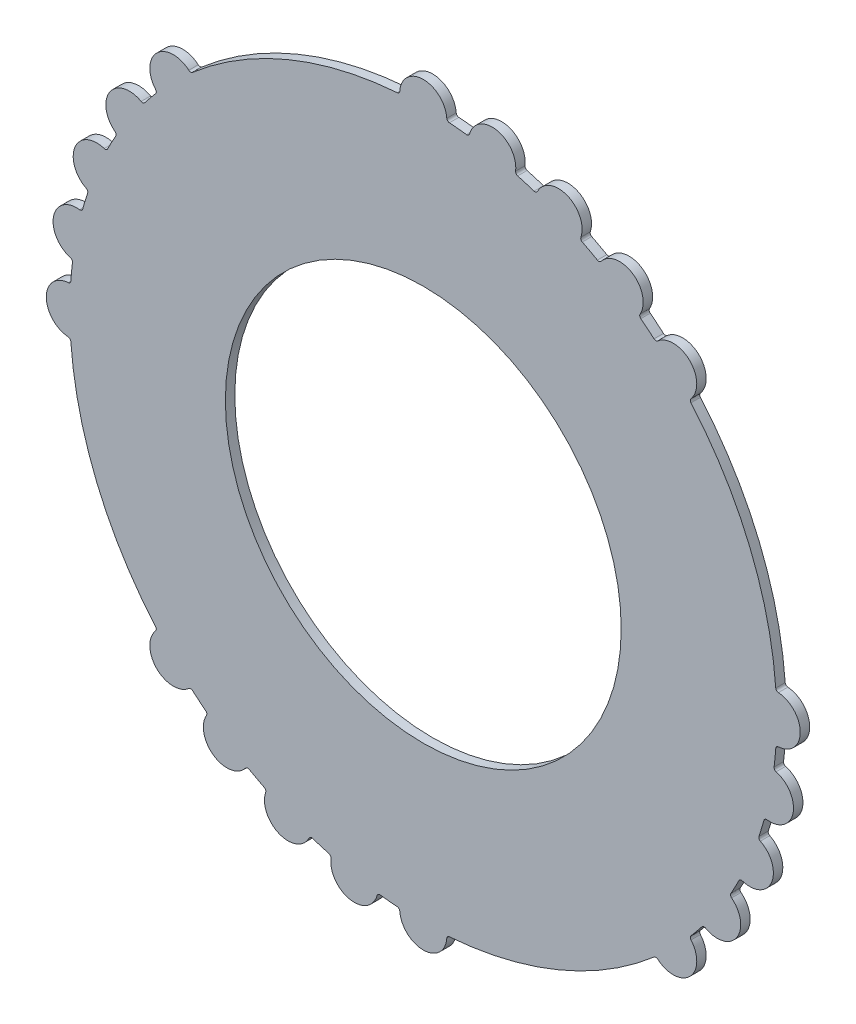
ISO-10303-21;
HEADER;
FILE_DESCRIPTION(('STEP AP214'),'2;1');
FILE_NAME('part.step','',(''),(''),'','','');
FILE_SCHEMA(('AUTOMOTIVE_DESIGN { 1 0 10303 214 1 1 1 1 }'));
ENDSEC;
DATA;
#1=APPLICATION_CONTEXT('core data for automotive mechanical design processes');
#2=APPLICATION_PROTOCOL_DEFINITION('international standard','automotive_design',2000,#1);
#3=PRODUCT_CONTEXT('',#1,'mechanical');
#4=PRODUCT('Part','Part','',(#3));
#5=PRODUCT_RELATED_PRODUCT_CATEGORY('part','',(#4));
#6=PRODUCT_DEFINITION_FORMATION('','',#4);
#7=PRODUCT_DEFINITION_CONTEXT('part definition',#1,'design');
#8=PRODUCT_DEFINITION('design','',#6,#7);
#9=PRODUCT_DEFINITION_SHAPE('','',#8);
#10=(LENGTH_UNIT() NAMED_UNIT(*) SI_UNIT(.MILLI.,.METRE.));
#11=(NAMED_UNIT(*) PLANE_ANGLE_UNIT() SI_UNIT($,.RADIAN.));
#12=(NAMED_UNIT(*) SI_UNIT($,.STERADIAN.) SOLID_ANGLE_UNIT());
#13=UNCERTAINTY_MEASURE_WITH_UNIT(LENGTH_MEASURE(1.E-05),#10,'distance_accuracy_value','');
#14=(GEOMETRIC_REPRESENTATION_CONTEXT(3) GLOBAL_UNCERTAINTY_ASSIGNED_CONTEXT((#13)) GLOBAL_UNIT_ASSIGNED_CONTEXT((#10,
#11,#12)) REPRESENTATION_CONTEXT('',''));
#15=CARTESIAN_POINT('',(0.,0.,0.));
#16=DIRECTION('',(0.,0.,1.));
#17=DIRECTION('',(1.,0.,0.));
#18=AXIS2_PLACEMENT_3D('',#15,#16,#17);
#19=CARTESIAN_POINT('',(-1.39654235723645,18.8483333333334,0.499999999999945));
#20=DIRECTION('',(0.,0.,-0.999999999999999));
#21=DIRECTION('',(-1.,0.,0.));
#22=AXIS2_PLACEMENT_3D('',#19,#20,#21);
#23=PLANE('',#22);
#24=CARTESIAN_POINT('',(-2.7930847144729,37.6966666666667,0.499999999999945));
#25=DIRECTION('',(0.,0.,-0.999999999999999));
#26=DIRECTION('',(-1.,0.,0.));
#27=AXIS2_PLACEMENT_3D('',#24,#25,#26);
#28=CIRCLE('',#27,0.299999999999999);
#29=CARTESIAN_POINT('',(-2.49382563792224,37.6755952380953,0.499999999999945));
#30=VERTEX_POINT('',#29);
#31=CARTESIAN_POINT('',(-2.77091737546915,37.3974867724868,0.499999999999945));
#32=VERTEX_POINT('',#31);
#33=EDGE_CURVE('E712',#30,#32,#28,.T.);
#34=ORIENTED_EDGE('',*,*,#33,.T.);
#35=CARTESIAN_POINT('',(0.,0.,0.499999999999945));
#36=DIRECTION('',(0.,0.,0.999999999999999));
#37=DIRECTION('',(1.,0.,0.));
#38=AXIS2_PLACEMENT_3D('',#35,#36,#37);
#39=CIRCLE('',#38,37.5);
#40=CARTESIAN_POINT('',(-24.4846820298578,28.4033509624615,0.499999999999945));
#41=VERTEX_POINT('',#40);
#42=EDGE_CURVE('E545',#32,#41,#39,.T.);
#43=ORIENTED_EDGE('',*,*,#42,.T.);
#44=CARTESIAN_POINT('',(-24.6805594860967,28.6305777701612,0.499999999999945));
#45=DIRECTION('',(0.,0.,-0.999999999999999));
#46=DIRECTION('',(1.,0.,0.));
#47=AXIS2_PLACEMENT_3D('',#44,#45,#46);
#48=CIRCLE('',#47,0.300000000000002);
#49=CARTESIAN_POINT('',(-24.8772678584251,28.4040698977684,0.499999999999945));
#50=VERTEX_POINT('',#49);
#51=EDGE_CURVE('E715',#41,#50,#48,.T.);
#52=ORIENTED_EDGE('',*,*,#51,.T.);
#53=CARTESIAN_POINT('',(-26.5165042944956,26.5165042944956,0.499999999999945));
#54=DIRECTION('',(0.,0.,0.999999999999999));
#55=DIRECTION('',(1.,0.,0.));
#56=AXIS2_PLACEMENT_3D('',#53,#54,#55);
#57=CIRCLE('',#56,2.5);
#58=CARTESIAN_POINT('',(-28.4040698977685,24.8772678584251,0.499999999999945));
#59=VERTEX_POINT('',#58);
#60=EDGE_CURVE('E717',#50,#59,#57,.T.);
#61=ORIENTED_EDGE('',*,*,#60,.T.);
#62=CARTESIAN_POINT('',(-28.6305777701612,24.6805594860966,0.499999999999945));
#63=DIRECTION('',(0.,0.,-0.999999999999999));
#64=DIRECTION('',(-1.,0.,0.));
#65=AXIS2_PLACEMENT_3D('',#62,#63,#64);
#66=CIRCLE('',#65,0.300000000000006);
#67=CARTESIAN_POINT('',(-28.4033509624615,24.4846820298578,0.499999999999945));
#68=VERTEX_POINT('',#67);
#69=EDGE_CURVE('E719',#59,#68,#66,.T.);
#70=ORIENTED_EDGE('',*,*,#69,.T.);
#71=CARTESIAN_POINT('',(0.,0.,0.499999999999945));
#72=DIRECTION('',(0.,0.,0.999999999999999));
#73=DIRECTION('',(1.,0.,0.));
#74=AXIS2_PLACEMENT_3D('',#71,#72,#73);
#75=CIRCLE('',#74,37.5);
#76=CARTESIAN_POINT('',(-29.5554346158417,23.0808640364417,0.499999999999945));
#77=VERTEX_POINT('',#76);
#78=EDGE_CURVE('E721',#68,#77,#75,.T.);
#79=ORIENTED_EDGE('',*,*,#78,.T.);
#80=CARTESIAN_POINT('',(-29.7918780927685,23.2655109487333,0.499999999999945));
#81=DIRECTION('',(0.,0.,-0.999999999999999));
#82=DIRECTION('',(1.,0.,0.));
#83=AXIS2_PLACEMENT_3D('',#80,#81,#82);
#84=CIRCLE('',#83,0.300000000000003);
#85=CARTESIAN_POINT('',(-29.940617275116,23.0049794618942,0.499999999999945));
#86=VERTEX_POINT('',#85);
#87=EDGE_CURVE('E723',#77,#86,#84,.T.);
#88=ORIENTED_EDGE('',*,*,#87,.T.);
#89=CARTESIAN_POINT('',(-31.1801104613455,20.8338837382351,0.499999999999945));
#90=DIRECTION('',(0.,0.,0.999999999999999));
#91=DIRECTION('',(1.,0.,0.));
#92=AXIS2_PLACEMENT_3D('',#89,#90,#91);
#93=CIRCLE('',#92,2.5);
#94=CARTESIAN_POINT('',(-32.7116078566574,18.8578989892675,0.499999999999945));
#95=VERTEX_POINT('',#94);
#96=EDGE_CURVE('E725',#86,#95,#93,.T.);
#97=ORIENTED_EDGE('',*,*,#96,.T.);
#98=CARTESIAN_POINT('',(-32.8953875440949,18.6207808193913,0.499999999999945));
#99=DIRECTION('',(0.,0.,-0.999999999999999));
#100=DIRECTION('',(-1.,0.,0.));
#101=AXIS2_PLACEMENT_3D('',#98,#99,#100);
#102=CIRCLE('',#101,0.300000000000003);
#103=CARTESIAN_POINT('',(-32.6343130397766,18.4729968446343,0.499999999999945));
#104=VERTEX_POINT('',#103);
#105=EDGE_CURVE('E727',#95,#104,#102,.T.);
#106=ORIENTED_EDGE('',*,*,#105,.T.);
#107=CARTESIAN_POINT('',(0.,0.,0.499999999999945));
#108=DIRECTION('',(0.,0.,0.999999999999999));
#109=DIRECTION('',(1.,0.,0.));
#110=AXIS2_PLACEMENT_3D('',#107,#108,#109);
#111=CIRCLE('',#110,37.5);
#112=CARTESIAN_POINT('',(-33.4903884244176,16.8713924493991,0.499999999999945));
#113=VERTEX_POINT('',#112);
#114=EDGE_CURVE('E729',#104,#113,#111,.T.);
#115=ORIENTED_EDGE('',*,*,#114,.T.);
#116=CARTESIAN_POINT('',(-33.7583115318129,17.0063635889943,0.499999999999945));
#117=DIRECTION('',(0.,0.,-0.999999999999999));
#118=DIRECTION('',(1.,0.,0.));
#119=AXIS2_PLACEMENT_3D('',#116,#117,#118);
#120=CIRCLE('',#119,0.299999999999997);
#121=CARTESIAN_POINT('',(-33.8533655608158,16.7218205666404,0.499999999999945));
#122=VERTEX_POINT('',#121);
#123=EDGE_CURVE('E731',#113,#122,#120,.T.);
#124=ORIENTED_EDGE('',*,*,#123,.T.);
#125=CARTESIAN_POINT('',(-34.6454824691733,14.3506287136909,0.499999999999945));
#126=DIRECTION('',(0.,0.,0.999999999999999));
#127=DIRECTION('',(1.,0.,0.));
#128=AXIS2_PLACEMENT_3D('',#125,#126,#127);
#129=CIRCLE('',#128,2.5);
#130=CARTESIAN_POINT('',(-35.7620570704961,12.1138316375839,0.499999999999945));
#131=VERTEX_POINT('',#130);
#132=EDGE_CURVE('E733',#122,#131,#129,.T.);
#133=ORIENTED_EDGE('',*,*,#132,.T.);
#134=CARTESIAN_POINT('',(-35.8960460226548,11.845415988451,0.499999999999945));
#135=DIRECTION('',(0.,0.,-0.999999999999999));
#136=DIRECTION('',(-1.,0.,0.));
#137=AXIS2_PLACEMENT_3D('',#134,#135,#136);
#138=CIRCLE('',#137,0.299999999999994);
#139=CARTESIAN_POINT('',(-35.6111567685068,11.7514047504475,0.499999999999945));
#140=VERTEX_POINT('',#139);
#141=EDGE_CURVE('E735',#131,#140,#138,.T.);
#142=ORIENTED_EDGE('',*,*,#141,.T.);
#143=CARTESIAN_POINT('',(0.,0.,0.499999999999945));
#144=DIRECTION('',(0.,0.,0.999999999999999));
#145=DIRECTION('',(1.,0.,0.));
#146=AXIS2_PLACEMENT_3D('',#143,#144,#145);
#147=CIRCLE('',#146,37.5);
#148=CARTESIAN_POINT('',(-36.1383253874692,10.013562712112,0.499999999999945));
#149=VERTEX_POINT('',#148);
#150=EDGE_CURVE('E737',#140,#149,#147,.T.);
#151=ORIENTED_EDGE('',*,*,#150,.T.);
#152=CARTESIAN_POINT('',(-36.4274319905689,10.0936712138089,0.499999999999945));
#153=DIRECTION('',(0.,0.,-0.999999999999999));
#154=DIRECTION('',(1.,0.,0.));
#155=AXIS2_PLACEMENT_3D('',#152,#153,#154);
#156=CIRCLE('',#155,0.299999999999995);
#157=CARTESIAN_POINT('',(-36.4651479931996,9.79605148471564,0.499999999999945));
#158=VERTEX_POINT('',#157);
#159=EDGE_CURVE('E739',#149,#158,#156,.T.);
#160=ORIENTED_EDGE('',*,*,#159,.T.);
#161=CARTESIAN_POINT('',(-36.7794480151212,7.31588707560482,0.499999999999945));
#162=DIRECTION('',(0.,0.,0.999999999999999));
#163=DIRECTION('',(1.,0.,0.));
#164=AXIS2_PLACEMENT_3D('',#161,#162,#163);
#165=CIRCLE('',#164,2.5);
#166=CARTESIAN_POINT('',(-37.4381904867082,4.90423652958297,0.499999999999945));
#167=VERTEX_POINT('',#166);
#168=EDGE_CURVE('E741',#158,#167,#165,.T.);
#169=ORIENTED_EDGE('',*,*,#168,.T.);
#170=CARTESIAN_POINT('',(-37.5172395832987,4.61483846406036,0.499999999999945));
#171=DIRECTION('',(0.,0.,-0.999999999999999));
#172=DIRECTION('',(-1.,0.,0.));
#173=AXIS2_PLACEMENT_3D('',#170,#171,#172);
#174=CIRCLE('',#173,0.299999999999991);
#175=CARTESIAN_POINT('',(-37.21948371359,4.57821276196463,0.499999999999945));
#176=VERTEX_POINT('',#175);
#177=EDGE_CURVE('E743',#167,#176,#174,.T.);
#178=ORIENTED_EDGE('',*,*,#177,.T.);
#179=CARTESIAN_POINT('',(0.,0.,0.499999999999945));
#180=DIRECTION('',(0.,0.,0.999999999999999));
#181=DIRECTION('',(1.,0.,0.));
#182=AXIS2_PLACEMENT_3D('',#179,#180,#181);
#183=CIRCLE('',#182,37.5);
#184=CARTESIAN_POINT('',(-37.3974867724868,2.77091737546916,0.499999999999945));
#185=VERTEX_POINT('',#184);
#186=EDGE_CURVE('E745',#176,#185,#183,.T.);
#187=ORIENTED_EDGE('',*,*,#186,.T.);
#188=CARTESIAN_POINT('',(-37.6966666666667,2.7930847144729,0.499999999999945));
#189=DIRECTION('',(0.,0.,-0.999999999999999));
#190=DIRECTION('',(1.,0.,0.));
#191=AXIS2_PLACEMENT_3D('',#188,#189,#190);
#192=CIRCLE('',#191,0.299999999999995);
#193=CARTESIAN_POINT('',(-37.6755952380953,2.49382563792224,0.499999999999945));
#194=VERTEX_POINT('',#193);
#195=EDGE_CURVE('E747',#185,#194,#192,.T.);
#196=ORIENTED_EDGE('',*,*,#195,.T.);
#197=CARTESIAN_POINT('',(-37.5000000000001,0.,0.499999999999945));
#198=DIRECTION('',(0.,0.,0.999999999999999));
#199=DIRECTION('',(1.,0.,0.));
#200=AXIS2_PLACEMENT_3D('',#197,#198,#199);
#201=CIRCLE('',#200,2.5);
#202=CARTESIAN_POINT('',(-37.6755952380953,-2.49382563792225,0.499999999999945));
#203=VERTEX_POINT('',#202);
#204=EDGE_CURVE('E749',#194,#203,#201,.T.);
#205=ORIENTED_EDGE('',*,*,#204,.T.);
#206=CARTESIAN_POINT('',(-37.6966666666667,-2.79308471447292,0.499999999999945));
#207=DIRECTION('',(0.,0.,-0.999999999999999));
#208=DIRECTION('',(-1.,0.,0.));
#209=AXIS2_PLACEMENT_3D('',#206,#207,#208);
#210=CIRCLE('',#209,0.299999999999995);
#211=CARTESIAN_POINT('',(-37.3974867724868,-2.77091737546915,0.499999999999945));
#212=VERTEX_POINT('',#211);
#213=EDGE_CURVE('E751',#203,#212,#210,.T.);
#214=ORIENTED_EDGE('',*,*,#213,.T.);
#215=CARTESIAN_POINT('',(0.,0.,0.499999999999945));
#216=DIRECTION('',(0.,0.,0.999999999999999));
#217=DIRECTION('',(1.,0.,0.));
#218=AXIS2_PLACEMENT_3D('',#215,#216,#217);
#219=CIRCLE('',#218,37.5);
#220=CARTESIAN_POINT('',(-28.4033509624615,-24.4846820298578,0.499999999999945));
#221=VERTEX_POINT('',#220);
#222=EDGE_CURVE('E753',#212,#221,#219,.T.);
#223=ORIENTED_EDGE('',*,*,#222,.T.);
#224=CARTESIAN_POINT('',(-28.6305777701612,-24.6805594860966,0.499999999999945));
#225=DIRECTION('',(0.,0.,-0.999999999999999));
#226=DIRECTION('',(1.,0.,0.));
#227=AXIS2_PLACEMENT_3D('',#224,#225,#226);
#228=CIRCLE('',#227,0.299999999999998);
#229=CARTESIAN_POINT('',(-28.4040698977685,-24.8772678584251,0.499999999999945));
#230=VERTEX_POINT('',#229);
#231=EDGE_CURVE('E755',#221,#230,#228,.T.);
#232=ORIENTED_EDGE('',*,*,#231,.T.);
#233=CARTESIAN_POINT('',(-26.5165042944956,-26.5165042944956,0.499999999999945));
#234=DIRECTION('',(0.,0.,0.999999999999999));
#235=DIRECTION('',(1.,0.,0.));
#236=AXIS2_PLACEMENT_3D('',#233,#234,#235);
#237=CIRCLE('',#236,2.5);
#238=CARTESIAN_POINT('',(-24.8772678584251,-28.4040698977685,0.499999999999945));
#239=VERTEX_POINT('',#238);
#240=EDGE_CURVE('E757',#230,#239,#237,.T.);
#241=ORIENTED_EDGE('',*,*,#240,.T.);
#242=CARTESIAN_POINT('',(-24.6805594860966,-28.6305777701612,0.499999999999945));
#243=DIRECTION('',(0.,0.,-0.999999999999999));
#244=DIRECTION('',(-1.,0.,0.));
#245=AXIS2_PLACEMENT_3D('',#242,#243,#244);
#246=CIRCLE('',#245,0.299999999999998);
#247=CARTESIAN_POINT('',(-24.4846820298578,-28.4033509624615,0.499999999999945));
#248=VERTEX_POINT('',#247);
#249=EDGE_CURVE('E759',#239,#248,#246,.T.);
#250=ORIENTED_EDGE('',*,*,#249,.T.);
#251=CARTESIAN_POINT('',(0.,0.,0.499999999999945));
#252=DIRECTION('',(0.,0.,0.999999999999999));
#253=DIRECTION('',(1.,0.,0.));
#254=AXIS2_PLACEMENT_3D('',#251,#252,#253);
#255=CIRCLE('',#254,37.5);
#256=CARTESIAN_POINT('',(-23.0808640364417,-29.5554346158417,0.499999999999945));
#257=VERTEX_POINT('',#256);
#258=EDGE_CURVE('E761',#248,#257,#255,.T.);
#259=ORIENTED_EDGE('',*,*,#258,.T.);
#260=CARTESIAN_POINT('',(-23.2655109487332,-29.7918780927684,0.499999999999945));
#261=DIRECTION('',(0.,0.,-0.999999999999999));
#262=DIRECTION('',(1.,0.,0.));
#263=AXIS2_PLACEMENT_3D('',#260,#261,#262);
#264=CIRCLE('',#263,0.299999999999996);
#265=CARTESIAN_POINT('',(-23.0049794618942,-29.940617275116,0.499999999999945));
#266=VERTEX_POINT('',#265);
#267=EDGE_CURVE('E763',#257,#266,#264,.T.);
#268=ORIENTED_EDGE('',*,*,#267,.T.);
#269=CARTESIAN_POINT('',(-20.8338837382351,-31.1801104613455,0.499999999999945));
#270=DIRECTION('',(0.,0.,0.999999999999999));
#271=DIRECTION('',(1.,0.,0.));
#272=AXIS2_PLACEMENT_3D('',#269,#270,#271);
#273=CIRCLE('',#272,2.5);
#274=CARTESIAN_POINT('',(-18.8578989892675,-32.7116078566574,0.499999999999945));
#275=VERTEX_POINT('',#274);
#276=EDGE_CURVE('E765',#266,#275,#273,.T.);
#277=ORIENTED_EDGE('',*,*,#276,.T.);
#278=CARTESIAN_POINT('',(-18.6207808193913,-32.8953875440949,0.499999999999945));
#279=DIRECTION('',(0.,0.,-0.999999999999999));
#280=DIRECTION('',(-1.,0.,0.));
#281=AXIS2_PLACEMENT_3D('',#278,#279,#280);
#282=CIRCLE('',#281,0.3);
#283=CARTESIAN_POINT('',(-18.4729968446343,-32.6343130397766,0.499999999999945));
#284=VERTEX_POINT('',#283);
#285=EDGE_CURVE('E767',#275,#284,#282,.T.);
#286=ORIENTED_EDGE('',*,*,#285,.T.);
#287=CARTESIAN_POINT('',(0.,0.,0.499999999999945));
#288=DIRECTION('',(0.,0.,0.999999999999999));
#289=DIRECTION('',(1.,0.,0.));
#290=AXIS2_PLACEMENT_3D('',#287,#288,#289);
#291=CIRCLE('',#290,37.5);
#292=CARTESIAN_POINT('',(-16.8713924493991,-33.4903884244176,0.499999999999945));
#293=VERTEX_POINT('',#292);
#294=EDGE_CURVE('E769',#284,#293,#291,.T.);
#295=ORIENTED_EDGE('',*,*,#294,.T.);
#296=CARTESIAN_POINT('',(-17.0063635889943,-33.7583115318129,0.499999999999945));
#297=DIRECTION('',(0.,0.,-0.999999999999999));
#298=DIRECTION('',(1.,0.,0.));
#299=AXIS2_PLACEMENT_3D('',#296,#297,#298);
#300=CIRCLE('',#299,0.299999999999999);
#301=CARTESIAN_POINT('',(-16.7218205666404,-33.8533655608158,0.499999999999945));
#302=VERTEX_POINT('',#301);
#303=EDGE_CURVE('E771',#293,#302,#300,.T.);
#304=ORIENTED_EDGE('',*,*,#303,.T.);
#305=CARTESIAN_POINT('',(-14.3506287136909,-34.6454824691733,0.499999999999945));
#306=DIRECTION('',(0.,0.,0.999999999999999));
#307=DIRECTION('',(1.,0.,0.));
#308=AXIS2_PLACEMENT_3D('',#305,#306,#307);
#309=CIRCLE('',#308,2.5);
#310=CARTESIAN_POINT('',(-12.1138316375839,-35.7620570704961,0.499999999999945));
#311=VERTEX_POINT('',#310);
#312=EDGE_CURVE('E773',#302,#311,#309,.T.);
#313=ORIENTED_EDGE('',*,*,#312,.T.);
#314=CARTESIAN_POINT('',(-11.845415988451,-35.8960460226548,0.499999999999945));
#315=DIRECTION('',(0.,0.,-0.999999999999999));
#316=DIRECTION('',(-1.,0.,0.));
#317=AXIS2_PLACEMENT_3D('',#314,#315,#316);
#318=CIRCLE('',#317,0.299999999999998);
#319=CARTESIAN_POINT('',(-11.7514047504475,-35.6111567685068,0.499999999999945));
#320=VERTEX_POINT('',#319);
#321=EDGE_CURVE('E775',#311,#320,#318,.T.);
#322=ORIENTED_EDGE('',*,*,#321,.T.);
#323=CARTESIAN_POINT('',(0.,0.,0.499999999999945));
#324=DIRECTION('',(0.,0.,0.999999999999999));
#325=DIRECTION('',(1.,0.,0.));
#326=AXIS2_PLACEMENT_3D('',#323,#324,#325);
#327=CIRCLE('',#326,37.5);
#328=CARTESIAN_POINT('',(-10.0135627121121,-36.1383253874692,0.499999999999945));
#329=VERTEX_POINT('',#328);
#330=EDGE_CURVE('E777',#320,#329,#327,.T.);
#331=ORIENTED_EDGE('',*,*,#330,.T.);
#332=CARTESIAN_POINT('',(-10.093671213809,-36.427431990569,0.499999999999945));
#333=DIRECTION('',(0.,0.,-0.999999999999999));
#334=DIRECTION('',(1.,0.,0.));
#335=AXIS2_PLACEMENT_3D('',#332,#333,#334);
#336=CIRCLE('',#335,0.3);
#337=CARTESIAN_POINT('',(-9.79605148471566,-36.4651479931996,0.499999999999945));
#338=VERTEX_POINT('',#337);
#339=EDGE_CURVE('E779',#329,#338,#336,.T.);
#340=ORIENTED_EDGE('',*,*,#339,.T.);
#341=CARTESIAN_POINT('',(-7.31588707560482,-36.7794480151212,0.499999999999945));
#342=DIRECTION('',(0.,0.,0.999999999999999));
#343=DIRECTION('',(1.,0.,0.));
#344=AXIS2_PLACEMENT_3D('',#341,#342,#343);
#345=CIRCLE('',#344,2.5);
#346=CARTESIAN_POINT('',(-4.90423652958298,-37.4381904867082,0.499999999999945));
#347=VERTEX_POINT('',#346);
#348=EDGE_CURVE('E781',#338,#347,#345,.T.);
#349=ORIENTED_EDGE('',*,*,#348,.T.);
#350=CARTESIAN_POINT('',(-4.61483846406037,-37.5172395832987,0.499999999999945));
#351=DIRECTION('',(0.,0.,-0.999999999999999));
#352=DIRECTION('',(-1.,0.,0.));
#353=AXIS2_PLACEMENT_3D('',#350,#351,#352);
#354=CIRCLE('',#353,0.299999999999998);
#355=CARTESIAN_POINT('',(-4.57821276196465,-37.21948371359,0.499999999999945));
#356=VERTEX_POINT('',#355);
#357=EDGE_CURVE('E783',#347,#356,#354,.T.);
#358=ORIENTED_EDGE('',*,*,#357,.T.);
#359=CARTESIAN_POINT('',(0.,0.,0.499999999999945));
#360=DIRECTION('',(0.,0.,0.999999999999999));
#361=DIRECTION('',(1.,0.,0.));
#362=AXIS2_PLACEMENT_3D('',#359,#360,#361);
#363=CIRCLE('',#362,37.5);
#364=CARTESIAN_POINT('',(-2.77091737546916,-37.3974867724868,0.499999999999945));
#365=VERTEX_POINT('',#364);
#366=EDGE_CURVE('E785',#356,#365,#363,.T.);
#367=ORIENTED_EDGE('',*,*,#366,.T.);
#368=CARTESIAN_POINT('',(-2.79308471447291,-37.6966666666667,0.499999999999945));
#369=DIRECTION('',(0.,0.,-0.999999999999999));
#370=DIRECTION('',(1.,0.,0.));
#371=AXIS2_PLACEMENT_3D('',#368,#369,#370);
#372=CIRCLE('',#371,0.299999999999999);
#373=CARTESIAN_POINT('',(-2.49382563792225,-37.6755952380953,0.499999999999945));
#374=VERTEX_POINT('',#373);
#375=EDGE_CURVE('E787',#365,#374,#372,.T.);
#376=ORIENTED_EDGE('',*,*,#375,.T.);
#377=CARTESIAN_POINT('',(0.,-37.5000000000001,0.499999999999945));
#378=DIRECTION('',(0.,0.,0.999999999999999));
#379=DIRECTION('',(1.,0.,0.));
#380=AXIS2_PLACEMENT_3D('',#377,#378,#379);
#381=CIRCLE('',#380,2.5);
#382=CARTESIAN_POINT('',(2.49382563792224,-37.6755952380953,0.499999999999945));
#383=VERTEX_POINT('',#382);
#384=EDGE_CURVE('E789',#374,#383,#381,.T.);
#385=ORIENTED_EDGE('',*,*,#384,.T.);
#386=CARTESIAN_POINT('',(2.7930847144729,-37.6966666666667,0.499999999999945));
#387=DIRECTION('',(0.,0.,-0.999999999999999));
#388=DIRECTION('',(-1.,0.,0.));
#389=AXIS2_PLACEMENT_3D('',#386,#387,#388);
#390=CIRCLE('',#389,0.299999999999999);
#391=CARTESIAN_POINT('',(2.77091737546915,-37.3974867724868,0.499999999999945));
#392=VERTEX_POINT('',#391);
#393=EDGE_CURVE('E791',#383,#392,#390,.T.);
#394=ORIENTED_EDGE('',*,*,#393,.T.);
#395=CARTESIAN_POINT('',(0.,0.,0.499999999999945));
#396=DIRECTION('',(0.,0.,0.999999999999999));
#397=DIRECTION('',(1.,0.,0.));
#398=AXIS2_PLACEMENT_3D('',#395,#396,#397);
#399=CIRCLE('',#398,37.5);
#400=CARTESIAN_POINT('',(24.4846820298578,-28.4033509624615,0.499999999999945));
#401=VERTEX_POINT('',#400);
#402=EDGE_CURVE('E793',#392,#401,#399,.T.);
#403=ORIENTED_EDGE('',*,*,#402,.T.);
#404=CARTESIAN_POINT('',(24.6805594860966,-28.6305777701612,0.499999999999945));
#405=DIRECTION('',(0.,0.,-0.999999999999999));
#406=DIRECTION('',(1.,0.,0.));
#407=AXIS2_PLACEMENT_3D('',#404,#405,#406);
#408=CIRCLE('',#407,0.3);
#409=CARTESIAN_POINT('',(24.8772678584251,-28.4040698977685,0.499999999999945));
#410=VERTEX_POINT('',#409);
#411=EDGE_CURVE('E795',#401,#410,#408,.T.);
#412=ORIENTED_EDGE('',*,*,#411,.T.);
#413=CARTESIAN_POINT('',(26.5165042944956,-26.5165042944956,0.499999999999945));
#414=DIRECTION('',(0.,0.,0.999999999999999));
#415=DIRECTION('',(1.,0.,0.));
#416=AXIS2_PLACEMENT_3D('',#413,#414,#415);
#417=CIRCLE('',#416,2.5);
#418=CARTESIAN_POINT('',(28.4040698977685,-24.8772678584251,0.499999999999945));
#419=VERTEX_POINT('',#418);
#420=EDGE_CURVE('E797',#410,#419,#417,.T.);
#421=ORIENTED_EDGE('',*,*,#420,.T.);
#422=CARTESIAN_POINT('',(28.6305777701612,-24.6805594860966,0.499999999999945));
#423=DIRECTION('',(0.,0.,-0.999999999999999));
#424=DIRECTION('',(-1.,0.,0.));
#425=AXIS2_PLACEMENT_3D('',#422,#423,#424);
#426=CIRCLE('',#425,0.299999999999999);
#427=CARTESIAN_POINT('',(28.4033509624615,-24.4846820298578,0.499999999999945));
#428=VERTEX_POINT('',#427);
#429=EDGE_CURVE('E799',#419,#428,#426,.T.);
#430=ORIENTED_EDGE('',*,*,#429,.T.);
#431=CARTESIAN_POINT('',(0.,0.,0.499999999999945));
#432=DIRECTION('',(0.,0.,0.999999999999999));
#433=DIRECTION('',(1.,0.,0.));
#434=AXIS2_PLACEMENT_3D('',#431,#432,#433);
#435=CIRCLE('',#434,37.5);
#436=CARTESIAN_POINT('',(29.5554346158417,-23.0808640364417,0.499999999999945));
#437=VERTEX_POINT('',#436);
#438=EDGE_CURVE('E801',#428,#437,#435,.T.);
#439=ORIENTED_EDGE('',*,*,#438,.T.);
#440=CARTESIAN_POINT('',(29.7918780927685,-23.2655109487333,0.499999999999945));
#441=DIRECTION('',(0.,0.,-0.999999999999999));
#442=DIRECTION('',(1.,0.,0.));
#443=AXIS2_PLACEMENT_3D('',#440,#441,#442);
#444=CIRCLE('',#443,0.299999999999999);
#445=CARTESIAN_POINT('',(29.940617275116,-23.0049794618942,0.499999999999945));
#446=VERTEX_POINT('',#445);
#447=EDGE_CURVE('E803',#437,#446,#444,.T.);
#448=ORIENTED_EDGE('',*,*,#447,.T.);
#449=CARTESIAN_POINT('',(31.1801104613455,-20.8338837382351,0.499999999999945));
#450=DIRECTION('',(0.,0.,0.999999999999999));
#451=DIRECTION('',(1.,0.,0.));
#452=AXIS2_PLACEMENT_3D('',#449,#450,#451);
#453=CIRCLE('',#452,2.5);
#454=CARTESIAN_POINT('',(32.7116078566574,-18.8578989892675,0.499999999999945));
#455=VERTEX_POINT('',#454);
#456=EDGE_CURVE('E805',#446,#455,#453,.T.);
#457=ORIENTED_EDGE('',*,*,#456,.T.);
#458=CARTESIAN_POINT('',(32.8953875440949,-18.6207808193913,0.499999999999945));
#459=DIRECTION('',(0.,0.,-0.999999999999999));
#460=DIRECTION('',(-1.,0.,0.));
#461=AXIS2_PLACEMENT_3D('',#458,#459,#460);
#462=CIRCLE('',#461,0.3);
#463=CARTESIAN_POINT('',(32.6343130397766,-18.4729968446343,0.499999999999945));
#464=VERTEX_POINT('',#463);
#465=EDGE_CURVE('E807',#455,#464,#462,.T.);
#466=ORIENTED_EDGE('',*,*,#465,.T.);
#467=CARTESIAN_POINT('',(0.,0.,0.499999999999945));
#468=DIRECTION('',(0.,0.,0.999999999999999));
#469=DIRECTION('',(1.,0.,0.));
#470=AXIS2_PLACEMENT_3D('',#467,#468,#469);
#471=CIRCLE('',#470,37.5);
#472=CARTESIAN_POINT('',(33.4903884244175,-16.8713924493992,0.499999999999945));
#473=VERTEX_POINT('',#472);
#474=EDGE_CURVE('E809',#464,#473,#471,.T.);
#475=ORIENTED_EDGE('',*,*,#474,.T.);
#476=CARTESIAN_POINT('',(33.7583115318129,-17.0063635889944,0.499999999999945));
#477=DIRECTION('',(0.,0.,-0.999999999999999));
#478=DIRECTION('',(1.,0.,0.));
#479=AXIS2_PLACEMENT_3D('',#476,#477,#478);
#480=CIRCLE('',#479,0.299999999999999);
#481=CARTESIAN_POINT('',(33.8533655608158,-16.7218205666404,0.499999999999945));
#482=VERTEX_POINT('',#481);
#483=EDGE_CURVE('E811',#473,#482,#480,.T.);
#484=ORIENTED_EDGE('',*,*,#483,.T.);
#485=CARTESIAN_POINT('',(34.6454824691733,-14.3506287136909,0.499999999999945));
#486=DIRECTION('',(0.,0.,0.999999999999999));
#487=DIRECTION('',(1.,0.,0.));
#488=AXIS2_PLACEMENT_3D('',#485,#486,#487);
#489=CIRCLE('',#488,2.5);
#490=CARTESIAN_POINT('',(35.7620570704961,-12.1138316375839,0.499999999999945));
#491=VERTEX_POINT('',#490);
#492=EDGE_CURVE('E813',#482,#491,#489,.T.);
#493=ORIENTED_EDGE('',*,*,#492,.T.);
#494=CARTESIAN_POINT('',(35.8960460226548,-11.845415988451,0.499999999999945));
#495=DIRECTION('',(0.,0.,-0.999999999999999));
#496=DIRECTION('',(-1.,0.,0.));
#497=AXIS2_PLACEMENT_3D('',#494,#495,#496);
#498=CIRCLE('',#497,0.300000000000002);
#499=CARTESIAN_POINT('',(35.6111567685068,-11.7514047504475,0.499999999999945));
#500=VERTEX_POINT('',#499);
#501=EDGE_CURVE('E815',#491,#500,#498,.T.);
#502=ORIENTED_EDGE('',*,*,#501,.T.);
#503=CARTESIAN_POINT('',(0.,0.,0.499999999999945));
#504=DIRECTION('',(0.,0.,0.999999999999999));
#505=DIRECTION('',(1.,0.,0.));
#506=AXIS2_PLACEMENT_3D('',#503,#504,#505);
#507=CIRCLE('',#506,37.5);
#508=CARTESIAN_POINT('',(36.1383253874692,-10.0135627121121,0.499999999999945));
#509=VERTEX_POINT('',#508);
#510=EDGE_CURVE('E817',#500,#509,#507,.T.);
#511=ORIENTED_EDGE('',*,*,#510,.T.);
#512=CARTESIAN_POINT('',(36.427431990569,-10.093671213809,0.499999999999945));
#513=DIRECTION('',(0.,0.,-0.999999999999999));
#514=DIRECTION('',(1.,0.,0.));
#515=AXIS2_PLACEMENT_3D('',#512,#513,#514);
#516=CIRCLE('',#515,0.3);
#517=CARTESIAN_POINT('',(36.4651479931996,-9.79605148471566,0.499999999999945));
#518=VERTEX_POINT('',#517);
#519=EDGE_CURVE('E819',#509,#518,#516,.T.);
#520=ORIENTED_EDGE('',*,*,#519,.T.);
#521=CARTESIAN_POINT('',(36.7794480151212,-7.31588707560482,0.499999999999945));
#522=DIRECTION('',(0.,0.,0.999999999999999));
#523=DIRECTION('',(1.,0.,0.));
#524=AXIS2_PLACEMENT_3D('',#521,#522,#523);
#525=CIRCLE('',#524,2.5);
#526=CARTESIAN_POINT('',(37.4381904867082,-4.904236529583,0.499999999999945));
#527=VERTEX_POINT('',#526);
#528=EDGE_CURVE('E821',#518,#527,#525,.T.);
#529=ORIENTED_EDGE('',*,*,#528,.T.);
#530=CARTESIAN_POINT('',(37.5172395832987,-4.61483846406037,0.499999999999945));
#531=DIRECTION('',(0.,0.,-0.999999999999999));
#532=DIRECTION('',(-1.,0.,0.));
#533=AXIS2_PLACEMENT_3D('',#530,#531,#532);
#534=CIRCLE('',#533,0.300000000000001);
#535=CARTESIAN_POINT('',(37.21948371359,-4.57821276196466,0.499999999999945));
#536=VERTEX_POINT('',#535);
#537=EDGE_CURVE('E823',#527,#536,#534,.T.);
#538=ORIENTED_EDGE('',*,*,#537,.T.);
#539=CARTESIAN_POINT('',(0.,0.,0.499999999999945));
#540=DIRECTION('',(0.,0.,0.999999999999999));
#541=DIRECTION('',(1.,0.,0.));
#542=AXIS2_PLACEMENT_3D('',#539,#540,#541);
#543=CIRCLE('',#542,37.5);
#544=CARTESIAN_POINT('',(37.3974867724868,-2.77091737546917,0.499999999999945));
#545=VERTEX_POINT('',#544);
#546=EDGE_CURVE('E825',#536,#545,#543,.T.);
#547=ORIENTED_EDGE('',*,*,#546,.T.);
#548=CARTESIAN_POINT('',(37.6966666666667,-2.79308471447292,0.499999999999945));
#549=DIRECTION('',(0.,0.,-0.999999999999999));
#550=DIRECTION('',(1.,0.,0.));
#551=AXIS2_PLACEMENT_3D('',#548,#549,#550);
#552=CIRCLE('',#551,0.299999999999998);
#553=CARTESIAN_POINT('',(37.6755952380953,-2.49382563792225,0.499999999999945));
#554=VERTEX_POINT('',#553);
#555=EDGE_CURVE('E827',#545,#554,#552,.T.);
#556=ORIENTED_EDGE('',*,*,#555,.T.);
#557=CARTESIAN_POINT('',(37.5,0.,0.499999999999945));
#558=DIRECTION('',(0.,0.,0.999999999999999));
#559=DIRECTION('',(1.,0.,0.));
#560=AXIS2_PLACEMENT_3D('',#557,#558,#559);
#561=CIRCLE('',#560,2.5);
#562=CARTESIAN_POINT('',(37.6755952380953,2.49382563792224,0.499999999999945));
#563=VERTEX_POINT('',#562);
#564=EDGE_CURVE('E829',#554,#563,#561,.T.);
#565=ORIENTED_EDGE('',*,*,#564,.T.);
#566=CARTESIAN_POINT('',(37.6966666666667,2.7930847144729,0.499999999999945));
#567=DIRECTION('',(0.,0.,-0.999999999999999));
#568=DIRECTION('',(-1.,0.,0.));
#569=AXIS2_PLACEMENT_3D('',#566,#567,#568);
#570=CIRCLE('',#569,0.299999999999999);
#571=CARTESIAN_POINT('',(37.3974867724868,2.77091737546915,0.499999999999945));
#572=VERTEX_POINT('',#571);
#573=EDGE_CURVE('E831',#563,#572,#570,.T.);
#574=ORIENTED_EDGE('',*,*,#573,.T.);
#575=CARTESIAN_POINT('',(0.,0.,0.499999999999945));
#576=DIRECTION('',(0.,0.,0.999999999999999));
#577=DIRECTION('',(1.,0.,0.));
#578=AXIS2_PLACEMENT_3D('',#575,#576,#577);
#579=CIRCLE('',#578,37.5);
#580=CARTESIAN_POINT('',(28.4033509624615,24.4846820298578,0.499999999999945));
#581=VERTEX_POINT('',#580);
#582=EDGE_CURVE('E833',#572,#581,#579,.T.);
#583=ORIENTED_EDGE('',*,*,#582,.T.);
#584=CARTESIAN_POINT('',(28.6305777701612,24.6805594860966,0.499999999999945));
#585=DIRECTION('',(0.,0.,-0.999999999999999));
#586=DIRECTION('',(1.,0.,0.));
#587=AXIS2_PLACEMENT_3D('',#584,#585,#586);
#588=CIRCLE('',#587,0.3);
#589=CARTESIAN_POINT('',(28.4040698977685,24.8772678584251,0.499999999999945));
#590=VERTEX_POINT('',#589);
#591=EDGE_CURVE('E835',#581,#590,#588,.T.);
#592=ORIENTED_EDGE('',*,*,#591,.T.);
#593=CARTESIAN_POINT('',(26.5165042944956,26.5165042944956,0.499999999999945));
#594=DIRECTION('',(0.,0.,0.999999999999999));
#595=DIRECTION('',(1.,0.,0.));
#596=AXIS2_PLACEMENT_3D('',#593,#594,#595);
#597=CIRCLE('',#596,2.5);
#598=CARTESIAN_POINT('',(24.8772678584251,28.4040698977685,0.499999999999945));
#599=VERTEX_POINT('',#598);
#600=EDGE_CURVE('E837',#590,#599,#597,.T.);
#601=ORIENTED_EDGE('',*,*,#600,.T.);
#602=CARTESIAN_POINT('',(24.6805594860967,28.6305777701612,0.499999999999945));
#603=DIRECTION('',(0.,0.,-0.999999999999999));
#604=DIRECTION('',(-1.,0.,0.));
#605=AXIS2_PLACEMENT_3D('',#602,#603,#604);
#606=CIRCLE('',#605,0.299999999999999);
#607=CARTESIAN_POINT('',(24.4846820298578,28.4033509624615,0.499999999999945));
#608=VERTEX_POINT('',#607);
#609=EDGE_CURVE('E839',#599,#608,#606,.T.);
#610=ORIENTED_EDGE('',*,*,#609,.T.);
#611=CARTESIAN_POINT('',(0.,0.,0.499999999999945));
#612=DIRECTION('',(0.,0.,0.999999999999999));
#613=DIRECTION('',(1.,0.,0.));
#614=AXIS2_PLACEMENT_3D('',#611,#612,#613);
#615=CIRCLE('',#614,37.5);
#616=CARTESIAN_POINT('',(23.0808640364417,29.5554346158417,0.499999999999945));
#617=VERTEX_POINT('',#616);
#618=EDGE_CURVE('E841',#608,#617,#615,.T.);
#619=ORIENTED_EDGE('',*,*,#618,.T.);
#620=CARTESIAN_POINT('',(23.2655109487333,29.7918780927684,0.499999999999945));
#621=DIRECTION('',(0.,0.,-0.999999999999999));
#622=DIRECTION('',(1.,0.,0.));
#623=AXIS2_PLACEMENT_3D('',#620,#621,#622);
#624=CIRCLE('',#623,0.299999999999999);
#625=CARTESIAN_POINT('',(23.0049794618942,29.940617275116,0.499999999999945));
#626=VERTEX_POINT('',#625);
#627=EDGE_CURVE('E843',#617,#626,#624,.T.);
#628=ORIENTED_EDGE('',*,*,#627,.T.);
#629=CARTESIAN_POINT('',(20.8338837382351,31.1801104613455,0.499999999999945));
#630=DIRECTION('',(0.,0.,0.999999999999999));
#631=DIRECTION('',(1.,0.,0.));
#632=AXIS2_PLACEMENT_3D('',#629,#630,#631);
#633=CIRCLE('',#632,2.5);
#634=CARTESIAN_POINT('',(18.8578989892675,32.7116078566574,0.499999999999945));
#635=VERTEX_POINT('',#634);
#636=EDGE_CURVE('E845',#626,#635,#633,.T.);
#637=ORIENTED_EDGE('',*,*,#636,.T.);
#638=CARTESIAN_POINT('',(18.6207808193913,32.8953875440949,0.499999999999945));
#639=DIRECTION('',(0.,0.,-0.999999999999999));
#640=DIRECTION('',(-1.,0.,0.));
#641=AXIS2_PLACEMENT_3D('',#638,#639,#640);
#642=CIRCLE('',#641,0.299999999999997);
#643=CARTESIAN_POINT('',(18.4729968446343,32.6343130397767,0.499999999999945));
#644=VERTEX_POINT('',#643);
#645=EDGE_CURVE('E847',#635,#644,#642,.T.);
#646=ORIENTED_EDGE('',*,*,#645,.T.);
#647=CARTESIAN_POINT('',(0.,0.,0.499999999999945));
#648=DIRECTION('',(0.,0.,0.999999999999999));
#649=DIRECTION('',(1.,0.,0.));
#650=AXIS2_PLACEMENT_3D('',#647,#648,#649);
#651=CIRCLE('',#650,37.5);
#652=CARTESIAN_POINT('',(16.8713924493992,33.4903884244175,0.499999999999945));
#653=VERTEX_POINT('',#652);
#654=EDGE_CURVE('E849',#644,#653,#651,.T.);
#655=ORIENTED_EDGE('',*,*,#654,.T.);
#656=CARTESIAN_POINT('',(17.0063635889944,33.7583115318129,0.499999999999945));
#657=DIRECTION('',(0.,0.,-0.999999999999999));
#658=DIRECTION('',(1.,0.,0.));
#659=AXIS2_PLACEMENT_3D('',#656,#657,#658);
#660=CIRCLE('',#659,0.299999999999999);
#661=CARTESIAN_POINT('',(16.7218205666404,33.8533655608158,0.499999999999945));
#662=VERTEX_POINT('',#661);
#663=EDGE_CURVE('E851',#653,#662,#660,.T.);
#664=ORIENTED_EDGE('',*,*,#663,.T.);
#665=CARTESIAN_POINT('',(14.3506287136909,34.6454824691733,0.499999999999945));
#666=DIRECTION('',(0.,0.,0.999999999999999));
#667=DIRECTION('',(1.,0.,0.));
#668=AXIS2_PLACEMENT_3D('',#665,#666,#667);
#669=CIRCLE('',#668,2.5);
#670=CARTESIAN_POINT('',(12.1138316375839,35.7620570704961,0.499999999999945));
#671=VERTEX_POINT('',#670);
#672=EDGE_CURVE('E853',#662,#671,#669,.T.);
#673=ORIENTED_EDGE('',*,*,#672,.T.);
#674=CARTESIAN_POINT('',(11.845415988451,35.8960460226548,0.499999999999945));
#675=DIRECTION('',(0.,0.,-0.999999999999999));
#676=DIRECTION('',(-1.,0.,0.));
#677=AXIS2_PLACEMENT_3D('',#674,#675,#676);
#678=CIRCLE('',#677,0.300000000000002);
#679=CARTESIAN_POINT('',(11.7514047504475,35.6111567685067,0.499999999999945));
#680=VERTEX_POINT('',#679);
#681=EDGE_CURVE('E855',#671,#680,#678,.T.);
#682=ORIENTED_EDGE('',*,*,#681,.T.);
#683=CARTESIAN_POINT('',(0.,0.,0.499999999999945));
#684=DIRECTION('',(0.,0.,0.999999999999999));
#685=DIRECTION('',(1.,0.,0.));
#686=AXIS2_PLACEMENT_3D('',#683,#684,#685);
#687=CIRCLE('',#686,37.5);
#688=CARTESIAN_POINT('',(10.0135627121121,36.1383253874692,0.499999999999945));
#689=VERTEX_POINT('',#688);
#690=EDGE_CURVE('E857',#680,#689,#687,.T.);
#691=ORIENTED_EDGE('',*,*,#690,.T.);
#692=CARTESIAN_POINT('',(10.093671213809,36.427431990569,0.499999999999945));
#693=DIRECTION('',(0.,0.,-0.999999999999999));
#694=DIRECTION('',(1.,0.,0.));
#695=AXIS2_PLACEMENT_3D('',#692,#693,#694);
#696=CIRCLE('',#695,0.3);
#697=CARTESIAN_POINT('',(9.79605148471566,36.4651479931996,0.499999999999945));
#698=VERTEX_POINT('',#697);
#699=EDGE_CURVE('E859',#689,#698,#696,.T.);
#700=ORIENTED_EDGE('',*,*,#699,.T.);
#701=CARTESIAN_POINT('',(7.31588707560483,36.7794480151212,0.499999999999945));
#702=DIRECTION('',(0.,0.,0.999999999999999));
#703=DIRECTION('',(1.,0.,0.));
#704=AXIS2_PLACEMENT_3D('',#701,#702,#703);
#705=CIRCLE('',#704,2.5);
#706=CARTESIAN_POINT('',(4.904236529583,37.4381904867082,0.499999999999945));
#707=VERTEX_POINT('',#706);
#708=EDGE_CURVE('E861',#698,#707,#705,.T.);
#709=ORIENTED_EDGE('',*,*,#708,.T.);
#710=CARTESIAN_POINT('',(4.61483846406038,37.5172395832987,0.499999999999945));
#711=DIRECTION('',(0.,0.,-0.999999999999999));
#712=DIRECTION('',(-1.,0.,0.));
#713=AXIS2_PLACEMENT_3D('',#710,#711,#712);
#714=CIRCLE('',#713,0.300000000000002);
#715=CARTESIAN_POINT('',(4.57821276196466,37.21948371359,0.499999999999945));
#716=VERTEX_POINT('',#715);
#717=EDGE_CURVE('E863',#707,#716,#714,.T.);
#718=ORIENTED_EDGE('',*,*,#717,.T.);
#719=CARTESIAN_POINT('',(0.,0.,0.499999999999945));
#720=DIRECTION('',(0.,0.,0.999999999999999));
#721=DIRECTION('',(1.,0.,0.));
#722=AXIS2_PLACEMENT_3D('',#719,#720,#721);
#723=CIRCLE('',#722,37.5);
#724=CARTESIAN_POINT('',(2.77091737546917,37.3974867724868,0.499999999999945));
#725=VERTEX_POINT('',#724);
#726=EDGE_CURVE('E865',#716,#725,#723,.T.);
#727=ORIENTED_EDGE('',*,*,#726,.T.);
#728=CARTESIAN_POINT('',(2.79308471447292,37.6966666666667,0.499999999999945));
#729=DIRECTION('',(0.,0.,-0.999999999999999));
#730=DIRECTION('',(1.,0.,0.));
#731=AXIS2_PLACEMENT_3D('',#728,#729,#730);
#732=CIRCLE('',#731,0.299999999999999);
#733=CARTESIAN_POINT('',(2.49382563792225,37.6755952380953,0.499999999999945));
#734=VERTEX_POINT('',#733);
#735=EDGE_CURVE('E54',#725,#734,#732,.T.);
#736=ORIENTED_EDGE('',*,*,#735,.T.);
#737=CARTESIAN_POINT('',(0.,37.5000000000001,0.499999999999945));
#738=DIRECTION('',(0.,0.,0.999999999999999));
#739=DIRECTION('',(1.,0.,0.));
#740=AXIS2_PLACEMENT_3D('',#737,#738,#739);
#741=CIRCLE('',#740,2.5);
#742=EDGE_CURVE('E49',#734,#30,#741,.T.);
#743=ORIENTED_EDGE('',*,*,#742,.T.);
#744=EDGE_LOOP('',(#34,#43,#52,#61,#70,#79,#88,#97,#106,#115,#124,#133,#142,#151,#160,#169,#178,
#187,#196,#205,#214,#223,#232,#241,#250,#259,#268,#277,#286,#295,#304,#313,#322,#331,#340,#349,
#358,#367,#376,#385,#394,#403,#412,#421,#430,#439,#448,#457,#466,#475,#484,#493,#502,#511,#520,
#529,#538,#547,#556,#565,#574,#583,#592,#601,#610,#619,#628,#637,#646,#655,#664,#673,#682,#691,
#700,#709,#718,#727,#736,#743));
#745=FACE_BOUND('',#744,.T.);
#746=CARTESIAN_POINT('',(0.,0.,0.499999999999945));
#747=DIRECTION('',(0.,0.,0.999999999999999));
#748=DIRECTION('',(1.,0.,0.));
#749=AXIS2_PLACEMENT_3D('',#746,#747,#748);
#750=CIRCLE('',#749,21.);
#751=CARTESIAN_POINT('',(-21.,0.,0.499999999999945));
#752=VERTEX_POINT('',#751);
#753=EDGE_CURVE('E550',#752,#752,#750,.T.);
#754=ORIENTED_EDGE('',*,*,#753,.F.);
#755=EDGE_LOOP('',(#754));
#756=FACE_BOUND('',#755,.T.);
#757=ADVANCED_FACE('F34',(#745,#756),#23,.F.);
#758=CARTESIAN_POINT('',(-1.39654235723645,18.8483333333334,-0.499999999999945));
#759=DIRECTION('',(0.,0.,-0.999999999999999));
#760=DIRECTION('',(-1.,0.,0.));
#761=AXIS2_PLACEMENT_3D('',#758,#759,#760);
#762=PLANE('',#761);
#763=CARTESIAN_POINT('',(-2.7930847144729,37.6966666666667,-0.499999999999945));
#764=DIRECTION('',(0.,0.,-0.999999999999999));
#765=DIRECTION('',(-1.,0.,0.));
#766=AXIS2_PLACEMENT_3D('',#763,#764,#765);
#767=CIRCLE('',#766,0.299999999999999);
#768=CARTESIAN_POINT('',(-2.49382563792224,37.6755952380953,-0.499999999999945));
#769=VERTEX_POINT('',#768);
#770=CARTESIAN_POINT('',(-2.77091737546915,37.3974867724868,-0.499999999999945));
#771=VERTEX_POINT('',#770);
#772=EDGE_CURVE('E536',#769,#771,#767,.T.);
#773=ORIENTED_EDGE('',*,*,#772,.F.);
#774=CARTESIAN_POINT('',(0.,37.5000000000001,-0.499999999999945));
#775=DIRECTION('',(0.,0.,0.999999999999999));
#776=DIRECTION('',(1.,0.,0.));
#777=AXIS2_PLACEMENT_3D('',#774,#775,#776);
#778=CIRCLE('',#777,2.5);
#779=CARTESIAN_POINT('',(2.49382563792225,37.6755952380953,-0.499999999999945));
#780=VERTEX_POINT('',#779);
#781=EDGE_CURVE('E710',#780,#769,#778,.T.);
#782=ORIENTED_EDGE('',*,*,#781,.F.);
#783=CARTESIAN_POINT('',(2.79308471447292,37.6966666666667,-0.499999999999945));
#784=DIRECTION('',(0.,0.,-0.999999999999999));
#785=DIRECTION('',(1.,0.,0.));
#786=AXIS2_PLACEMENT_3D('',#783,#784,#785);
#787=CIRCLE('',#786,0.299999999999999);
#788=CARTESIAN_POINT('',(2.77091737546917,37.3974867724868,-0.499999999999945));
#789=VERTEX_POINT('',#788);
#790=EDGE_CURVE('E708',#789,#780,#787,.T.);
#791=ORIENTED_EDGE('',*,*,#790,.F.);
#792=CARTESIAN_POINT('',(0.,0.,-0.499999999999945));
#793=DIRECTION('',(0.,0.,0.999999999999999));
#794=DIRECTION('',(1.,0.,0.));
#795=AXIS2_PLACEMENT_3D('',#792,#793,#794);
#796=CIRCLE('',#795,37.5);
#797=CARTESIAN_POINT('',(4.57821276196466,37.21948371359,-0.499999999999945));
#798=VERTEX_POINT('',#797);
#799=EDGE_CURVE('E706',#798,#789,#796,.T.);
#800=ORIENTED_EDGE('',*,*,#799,.F.);
#801=CARTESIAN_POINT('',(4.61483846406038,37.5172395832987,-0.499999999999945));
#802=DIRECTION('',(0.,0.,-0.999999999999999));
#803=DIRECTION('',(-1.,0.,0.));
#804=AXIS2_PLACEMENT_3D('',#801,#802,#803);
#805=CIRCLE('',#804,0.300000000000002);
#806=CARTESIAN_POINT('',(4.904236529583,37.4381904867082,-0.499999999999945));
#807=VERTEX_POINT('',#806);
#808=EDGE_CURVE('E704',#807,#798,#805,.T.);
#809=ORIENTED_EDGE('',*,*,#808,.F.);
#810=CARTESIAN_POINT('',(7.31588707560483,36.7794480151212,-0.499999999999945));
#811=DIRECTION('',(0.,0.,0.999999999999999));
#812=DIRECTION('',(1.,0.,0.));
#813=AXIS2_PLACEMENT_3D('',#810,#811,#812);
#814=CIRCLE('',#813,2.5);
#815=CARTESIAN_POINT('',(9.79605148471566,36.4651479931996,-0.499999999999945));
#816=VERTEX_POINT('',#815);
#817=EDGE_CURVE('E702',#816,#807,#814,.T.);
#818=ORIENTED_EDGE('',*,*,#817,.F.);
#819=CARTESIAN_POINT('',(10.093671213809,36.427431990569,-0.499999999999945));
#820=DIRECTION('',(0.,0.,-0.999999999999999));
#821=DIRECTION('',(1.,0.,0.));
#822=AXIS2_PLACEMENT_3D('',#819,#820,#821);
#823=CIRCLE('',#822,0.3);
#824=CARTESIAN_POINT('',(10.0135627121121,36.1383253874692,-0.499999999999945));
#825=VERTEX_POINT('',#824);
#826=EDGE_CURVE('E700',#825,#816,#823,.T.);
#827=ORIENTED_EDGE('',*,*,#826,.F.);
#828=CARTESIAN_POINT('',(0.,0.,-0.499999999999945));
#829=DIRECTION('',(0.,0.,0.999999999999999));
#830=DIRECTION('',(1.,0.,0.));
#831=AXIS2_PLACEMENT_3D('',#828,#829,#830);
#832=CIRCLE('',#831,37.5);
#833=CARTESIAN_POINT('',(11.7514047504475,35.6111567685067,-0.499999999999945));
#834=VERTEX_POINT('',#833);
#835=EDGE_CURVE('E698',#834,#825,#832,.T.);
#836=ORIENTED_EDGE('',*,*,#835,.F.);
#837=CARTESIAN_POINT('',(11.845415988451,35.8960460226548,-0.499999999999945));
#838=DIRECTION('',(0.,0.,-0.999999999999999));
#839=DIRECTION('',(-1.,0.,0.));
#840=AXIS2_PLACEMENT_3D('',#837,#838,#839);
#841=CIRCLE('',#840,0.300000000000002);
#842=CARTESIAN_POINT('',(12.1138316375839,35.7620570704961,-0.499999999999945));
#843=VERTEX_POINT('',#842);
#844=EDGE_CURVE('E696',#843,#834,#841,.T.);
#845=ORIENTED_EDGE('',*,*,#844,.F.);
#846=CARTESIAN_POINT('',(14.3506287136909,34.6454824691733,-0.499999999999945));
#847=DIRECTION('',(0.,0.,0.999999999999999));
#848=DIRECTION('',(1.,0.,0.));
#849=AXIS2_PLACEMENT_3D('',#846,#847,#848);
#850=CIRCLE('',#849,2.5);
#851=CARTESIAN_POINT('',(16.7218205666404,33.8533655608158,-0.499999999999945));
#852=VERTEX_POINT('',#851);
#853=EDGE_CURVE('E694',#852,#843,#850,.T.);
#854=ORIENTED_EDGE('',*,*,#853,.F.);
#855=CARTESIAN_POINT('',(17.0063635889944,33.7583115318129,-0.499999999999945));
#856=DIRECTION('',(0.,0.,-0.999999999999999));
#857=DIRECTION('',(1.,0.,0.));
#858=AXIS2_PLACEMENT_3D('',#855,#856,#857);
#859=CIRCLE('',#858,0.299999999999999);
#860=CARTESIAN_POINT('',(16.8713924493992,33.4903884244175,-0.499999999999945));
#861=VERTEX_POINT('',#860);
#862=EDGE_CURVE('E692',#861,#852,#859,.T.);
#863=ORIENTED_EDGE('',*,*,#862,.F.);
#864=CARTESIAN_POINT('',(0.,0.,-0.499999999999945));
#865=DIRECTION('',(0.,0.,0.999999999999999));
#866=DIRECTION('',(1.,0.,0.));
#867=AXIS2_PLACEMENT_3D('',#864,#865,#866);
#868=CIRCLE('',#867,37.5);
#869=CARTESIAN_POINT('',(18.4729968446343,32.6343130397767,-0.499999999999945));
#870=VERTEX_POINT('',#869);
#871=EDGE_CURVE('E690',#870,#861,#868,.T.);
#872=ORIENTED_EDGE('',*,*,#871,.F.);
#873=CARTESIAN_POINT('',(18.6207808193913,32.8953875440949,-0.499999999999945));
#874=DIRECTION('',(0.,0.,-0.999999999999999));
#875=DIRECTION('',(-1.,0.,0.));
#876=AXIS2_PLACEMENT_3D('',#873,#874,#875);
#877=CIRCLE('',#876,0.299999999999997);
#878=CARTESIAN_POINT('',(18.8578989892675,32.7116078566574,-0.499999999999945));
#879=VERTEX_POINT('',#878);
#880=EDGE_CURVE('E688',#879,#870,#877,.T.);
#881=ORIENTED_EDGE('',*,*,#880,.F.);
#882=CARTESIAN_POINT('',(20.8338837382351,31.1801104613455,-0.499999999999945));
#883=DIRECTION('',(0.,0.,0.999999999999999));
#884=DIRECTION('',(1.,0.,0.));
#885=AXIS2_PLACEMENT_3D('',#882,#883,#884);
#886=CIRCLE('',#885,2.5);
#887=CARTESIAN_POINT('',(23.0049794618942,29.940617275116,-0.499999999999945));
#888=VERTEX_POINT('',#887);
#889=EDGE_CURVE('E686',#888,#879,#886,.T.);
#890=ORIENTED_EDGE('',*,*,#889,.F.);
#891=CARTESIAN_POINT('',(23.2655109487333,29.7918780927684,-0.499999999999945));
#892=DIRECTION('',(0.,0.,-0.999999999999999));
#893=DIRECTION('',(1.,0.,0.));
#894=AXIS2_PLACEMENT_3D('',#891,#892,#893);
#895=CIRCLE('',#894,0.299999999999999);
#896=CARTESIAN_POINT('',(23.0808640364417,29.5554346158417,-0.499999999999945));
#897=VERTEX_POINT('',#896);
#898=EDGE_CURVE('E684',#897,#888,#895,.T.);
#899=ORIENTED_EDGE('',*,*,#898,.F.);
#900=CARTESIAN_POINT('',(0.,0.,-0.499999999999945));
#901=DIRECTION('',(0.,0.,0.999999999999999));
#902=DIRECTION('',(1.,0.,0.));
#903=AXIS2_PLACEMENT_3D('',#900,#901,#902);
#904=CIRCLE('',#903,37.5);
#905=CARTESIAN_POINT('',(24.4846820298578,28.4033509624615,-0.499999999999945));
#906=VERTEX_POINT('',#905);
#907=EDGE_CURVE('E682',#906,#897,#904,.T.);
#908=ORIENTED_EDGE('',*,*,#907,.F.);
#909=CARTESIAN_POINT('',(24.6805594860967,28.6305777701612,-0.499999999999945));
#910=DIRECTION('',(0.,0.,-0.999999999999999));
#911=DIRECTION('',(-1.,0.,0.));
#912=AXIS2_PLACEMENT_3D('',#909,#910,#911);
#913=CIRCLE('',#912,0.299999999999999);
#914=CARTESIAN_POINT('',(24.8772678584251,28.4040698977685,-0.499999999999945));
#915=VERTEX_POINT('',#914);
#916=EDGE_CURVE('E680',#915,#906,#913,.T.);
#917=ORIENTED_EDGE('',*,*,#916,.F.);
#918=CARTESIAN_POINT('',(26.5165042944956,26.5165042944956,-0.499999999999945));
#919=DIRECTION('',(0.,0.,0.999999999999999));
#920=DIRECTION('',(1.,0.,0.));
#921=AXIS2_PLACEMENT_3D('',#918,#919,#920);
#922=CIRCLE('',#921,2.5);
#923=CARTESIAN_POINT('',(28.4040698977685,24.8772678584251,-0.499999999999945));
#924=VERTEX_POINT('',#923);
#925=EDGE_CURVE('E678',#924,#915,#922,.T.);
#926=ORIENTED_EDGE('',*,*,#925,.F.);
#927=CARTESIAN_POINT('',(28.6305777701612,24.6805594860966,-0.499999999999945));
#928=DIRECTION('',(0.,0.,-0.999999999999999));
#929=DIRECTION('',(1.,0.,0.));
#930=AXIS2_PLACEMENT_3D('',#927,#928,#929);
#931=CIRCLE('',#930,0.3);
#932=CARTESIAN_POINT('',(28.4033509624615,24.4846820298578,-0.499999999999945));
#933=VERTEX_POINT('',#932);
#934=EDGE_CURVE('E676',#933,#924,#931,.T.);
#935=ORIENTED_EDGE('',*,*,#934,.F.);
#936=CARTESIAN_POINT('',(0.,0.,-0.499999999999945));
#937=DIRECTION('',(0.,0.,0.999999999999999));
#938=DIRECTION('',(1.,0.,0.));
#939=AXIS2_PLACEMENT_3D('',#936,#937,#938);
#940=CIRCLE('',#939,37.5);
#941=CARTESIAN_POINT('',(37.3974867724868,2.77091737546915,-0.499999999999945));
#942=VERTEX_POINT('',#941);
#943=EDGE_CURVE('E674',#942,#933,#940,.T.);
#944=ORIENTED_EDGE('',*,*,#943,.F.);
#945=CARTESIAN_POINT('',(37.6966666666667,2.7930847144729,-0.499999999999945));
#946=DIRECTION('',(0.,0.,-0.999999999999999));
#947=DIRECTION('',(-1.,0.,0.));
#948=AXIS2_PLACEMENT_3D('',#945,#946,#947);
#949=CIRCLE('',#948,0.299999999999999);
#950=CARTESIAN_POINT('',(37.6755952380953,2.49382563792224,-0.499999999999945));
#951=VERTEX_POINT('',#950);
#952=EDGE_CURVE('E672',#951,#942,#949,.T.);
#953=ORIENTED_EDGE('',*,*,#952,.F.);
#954=CARTESIAN_POINT('',(37.5,0.,-0.499999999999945));
#955=DIRECTION('',(0.,0.,0.999999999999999));
#956=DIRECTION('',(1.,0.,0.));
#957=AXIS2_PLACEMENT_3D('',#954,#955,#956);
#958=CIRCLE('',#957,2.5);
#959=CARTESIAN_POINT('',(37.6755952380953,-2.49382563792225,-0.499999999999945));
#960=VERTEX_POINT('',#959);
#961=EDGE_CURVE('E670',#960,#951,#958,.T.);
#962=ORIENTED_EDGE('',*,*,#961,.F.);
#963=CARTESIAN_POINT('',(37.6966666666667,-2.79308471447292,-0.499999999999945));
#964=DIRECTION('',(0.,0.,-0.999999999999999));
#965=DIRECTION('',(1.,0.,0.));
#966=AXIS2_PLACEMENT_3D('',#963,#964,#965);
#967=CIRCLE('',#966,0.299999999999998);
#968=CARTESIAN_POINT('',(37.3974867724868,-2.77091737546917,-0.499999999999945));
#969=VERTEX_POINT('',#968);
#970=EDGE_CURVE('E668',#969,#960,#967,.T.);
#971=ORIENTED_EDGE('',*,*,#970,.F.);
#972=CARTESIAN_POINT('',(0.,0.,-0.499999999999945));
#973=DIRECTION('',(0.,0.,0.999999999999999));
#974=DIRECTION('',(1.,0.,0.));
#975=AXIS2_PLACEMENT_3D('',#972,#973,#974);
#976=CIRCLE('',#975,37.5);
#977=CARTESIAN_POINT('',(37.21948371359,-4.57821276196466,-0.499999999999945));
#978=VERTEX_POINT('',#977);
#979=EDGE_CURVE('E666',#978,#969,#976,.T.);
#980=ORIENTED_EDGE('',*,*,#979,.F.);
#981=CARTESIAN_POINT('',(37.5172395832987,-4.61483846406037,-0.499999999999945));
#982=DIRECTION('',(0.,0.,-0.999999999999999));
#983=DIRECTION('',(-1.,0.,0.));
#984=AXIS2_PLACEMENT_3D('',#981,#982,#983);
#985=CIRCLE('',#984,0.300000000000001);
#986=CARTESIAN_POINT('',(37.4381904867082,-4.904236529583,-0.499999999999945));
#987=VERTEX_POINT('',#986);
#988=EDGE_CURVE('E664',#987,#978,#985,.T.);
#989=ORIENTED_EDGE('',*,*,#988,.F.);
#990=CARTESIAN_POINT('',(36.7794480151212,-7.31588707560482,-0.499999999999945));
#991=DIRECTION('',(0.,0.,0.999999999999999));
#992=DIRECTION('',(1.,0.,0.));
#993=AXIS2_PLACEMENT_3D('',#990,#991,#992);
#994=CIRCLE('',#993,2.5);
#995=CARTESIAN_POINT('',(36.4651479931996,-9.79605148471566,-0.499999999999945));
#996=VERTEX_POINT('',#995);
#997=EDGE_CURVE('E662',#996,#987,#994,.T.);
#998=ORIENTED_EDGE('',*,*,#997,.F.);
#999=CARTESIAN_POINT('',(36.427431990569,-10.093671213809,-0.499999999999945));
#1000=DIRECTION('',(0.,0.,-0.999999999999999));
#1001=DIRECTION('',(1.,0.,0.));
#1002=AXIS2_PLACEMENT_3D('',#999,#1000,#1001);
#1003=CIRCLE('',#1002,0.3);
#1004=CARTESIAN_POINT('',(36.1383253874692,-10.0135627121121,-0.499999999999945));
#1005=VERTEX_POINT('',#1004);
#1006=EDGE_CURVE('E660',#1005,#996,#1003,.T.);
#1007=ORIENTED_EDGE('',*,*,#1006,.F.);
#1008=CARTESIAN_POINT('',(0.,0.,-0.499999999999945));
#1009=DIRECTION('',(0.,0.,0.999999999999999));
#1010=DIRECTION('',(1.,0.,0.));
#1011=AXIS2_PLACEMENT_3D('',#1008,#1009,#1010);
#1012=CIRCLE('',#1011,37.5);
#1013=CARTESIAN_POINT('',(35.6111567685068,-11.7514047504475,-0.499999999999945));
#1014=VERTEX_POINT('',#1013);
#1015=EDGE_CURVE('E658',#1014,#1005,#1012,.T.);
#1016=ORIENTED_EDGE('',*,*,#1015,.F.);
#1017=CARTESIAN_POINT('',(35.8960460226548,-11.845415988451,-0.499999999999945));
#1018=DIRECTION('',(0.,0.,-0.999999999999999));
#1019=DIRECTION('',(-1.,0.,0.));
#1020=AXIS2_PLACEMENT_3D('',#1017,#1018,#1019);
#1021=CIRCLE('',#1020,0.300000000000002);
#1022=CARTESIAN_POINT('',(35.7620570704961,-12.1138316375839,-0.499999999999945));
#1023=VERTEX_POINT('',#1022);
#1024=EDGE_CURVE('E656',#1023,#1014,#1021,.T.);
#1025=ORIENTED_EDGE('',*,*,#1024,.F.);
#1026=CARTESIAN_POINT('',(34.6454824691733,-14.3506287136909,-0.499999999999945));
#1027=DIRECTION('',(0.,0.,0.999999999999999));
#1028=DIRECTION('',(1.,0.,0.));
#1029=AXIS2_PLACEMENT_3D('',#1026,#1027,#1028);
#1030=CIRCLE('',#1029,2.5);
#1031=CARTESIAN_POINT('',(33.8533655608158,-16.7218205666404,-0.499999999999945));
#1032=VERTEX_POINT('',#1031);
#1033=EDGE_CURVE('E654',#1032,#1023,#1030,.T.);
#1034=ORIENTED_EDGE('',*,*,#1033,.F.);
#1035=CARTESIAN_POINT('',(33.7583115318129,-17.0063635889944,-0.499999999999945));
#1036=DIRECTION('',(0.,0.,-0.999999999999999));
#1037=DIRECTION('',(1.,0.,0.));
#1038=AXIS2_PLACEMENT_3D('',#1035,#1036,#1037);
#1039=CIRCLE('',#1038,0.299999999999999);
#1040=CARTESIAN_POINT('',(33.4903884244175,-16.8713924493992,-0.499999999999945));
#1041=VERTEX_POINT('',#1040);
#1042=EDGE_CURVE('E652',#1041,#1032,#1039,.T.);
#1043=ORIENTED_EDGE('',*,*,#1042,.F.);
#1044=CARTESIAN_POINT('',(0.,0.,-0.499999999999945));
#1045=DIRECTION('',(0.,0.,0.999999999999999));
#1046=DIRECTION('',(1.,0.,0.));
#1047=AXIS2_PLACEMENT_3D('',#1044,#1045,#1046);
#1048=CIRCLE('',#1047,37.5);
#1049=CARTESIAN_POINT('',(32.6343130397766,-18.4729968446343,-0.499999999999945));
#1050=VERTEX_POINT('',#1049);
#1051=EDGE_CURVE('E650',#1050,#1041,#1048,.T.);
#1052=ORIENTED_EDGE('',*,*,#1051,.F.);
#1053=CARTESIAN_POINT('',(32.8953875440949,-18.6207808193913,-0.499999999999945));
#1054=DIRECTION('',(0.,0.,-0.999999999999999));
#1055=DIRECTION('',(-1.,0.,0.));
#1056=AXIS2_PLACEMENT_3D('',#1053,#1054,#1055);
#1057=CIRCLE('',#1056,0.3);
#1058=CARTESIAN_POINT('',(32.7116078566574,-18.8578989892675,-0.499999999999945));
#1059=VERTEX_POINT('',#1058);
#1060=EDGE_CURVE('E648',#1059,#1050,#1057,.T.);
#1061=ORIENTED_EDGE('',*,*,#1060,.F.);
#1062=CARTESIAN_POINT('',(31.1801104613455,-20.8338837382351,-0.499999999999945));
#1063=DIRECTION('',(0.,0.,0.999999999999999));
#1064=DIRECTION('',(1.,0.,0.));
#1065=AXIS2_PLACEMENT_3D('',#1062,#1063,#1064);
#1066=CIRCLE('',#1065,2.5);
#1067=CARTESIAN_POINT('',(29.940617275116,-23.0049794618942,-0.499999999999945));
#1068=VERTEX_POINT('',#1067);
#1069=EDGE_CURVE('E646',#1068,#1059,#1066,.T.);
#1070=ORIENTED_EDGE('',*,*,#1069,.F.);
#1071=CARTESIAN_POINT('',(29.7918780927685,-23.2655109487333,-0.499999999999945));
#1072=DIRECTION('',(0.,0.,-0.999999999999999));
#1073=DIRECTION('',(1.,0.,0.));
#1074=AXIS2_PLACEMENT_3D('',#1071,#1072,#1073);
#1075=CIRCLE('',#1074,0.299999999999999);
#1076=CARTESIAN_POINT('',(29.5554346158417,-23.0808640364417,-0.499999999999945));
#1077=VERTEX_POINT('',#1076);
#1078=EDGE_CURVE('E644',#1077,#1068,#1075,.T.);
#1079=ORIENTED_EDGE('',*,*,#1078,.F.);
#1080=CARTESIAN_POINT('',(0.,0.,-0.499999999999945));
#1081=DIRECTION('',(0.,0.,0.999999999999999));
#1082=DIRECTION('',(1.,0.,0.));
#1083=AXIS2_PLACEMENT_3D('',#1080,#1081,#1082);
#1084=CIRCLE('',#1083,37.5);
#1085=CARTESIAN_POINT('',(28.4033509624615,-24.4846820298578,-0.499999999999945));
#1086=VERTEX_POINT('',#1085);
#1087=EDGE_CURVE('E642',#1086,#1077,#1084,.T.);
#1088=ORIENTED_EDGE('',*,*,#1087,.F.);
#1089=CARTESIAN_POINT('',(28.6305777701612,-24.6805594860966,-0.499999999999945));
#1090=DIRECTION('',(0.,0.,-0.999999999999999));
#1091=DIRECTION('',(-1.,0.,0.));
#1092=AXIS2_PLACEMENT_3D('',#1089,#1090,#1091);
#1093=CIRCLE('',#1092,0.299999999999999);
#1094=CARTESIAN_POINT('',(28.4040698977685,-24.8772678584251,-0.499999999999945));
#1095=VERTEX_POINT('',#1094);
#1096=EDGE_CURVE('E640',#1095,#1086,#1093,.T.);
#1097=ORIENTED_EDGE('',*,*,#1096,.F.);
#1098=CARTESIAN_POINT('',(26.5165042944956,-26.5165042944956,-0.499999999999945));
#1099=DIRECTION('',(0.,0.,0.999999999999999));
#1100=DIRECTION('',(1.,0.,0.));
#1101=AXIS2_PLACEMENT_3D('',#1098,#1099,#1100);
#1102=CIRCLE('',#1101,2.5);
#1103=CARTESIAN_POINT('',(24.8772678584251,-28.4040698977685,-0.499999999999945));
#1104=VERTEX_POINT('',#1103);
#1105=EDGE_CURVE('E638',#1104,#1095,#1102,.T.);
#1106=ORIENTED_EDGE('',*,*,#1105,.F.);
#1107=CARTESIAN_POINT('',(24.6805594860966,-28.6305777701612,-0.499999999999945));
#1108=DIRECTION('',(0.,0.,-0.999999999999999));
#1109=DIRECTION('',(1.,0.,0.));
#1110=AXIS2_PLACEMENT_3D('',#1107,#1108,#1109);
#1111=CIRCLE('',#1110,0.3);
#1112=CARTESIAN_POINT('',(24.4846820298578,-28.4033509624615,-0.499999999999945));
#1113=VERTEX_POINT('',#1112);
#1114=EDGE_CURVE('E636',#1113,#1104,#1111,.T.);
#1115=ORIENTED_EDGE('',*,*,#1114,.F.);
#1116=CARTESIAN_POINT('',(0.,0.,-0.499999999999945));
#1117=DIRECTION('',(0.,0.,0.999999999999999));
#1118=DIRECTION('',(1.,0.,0.));
#1119=AXIS2_PLACEMENT_3D('',#1116,#1117,#1118);
#1120=CIRCLE('',#1119,37.5);
#1121=CARTESIAN_POINT('',(2.77091737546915,-37.3974867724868,-0.499999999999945));
#1122=VERTEX_POINT('',#1121);
#1123=EDGE_CURVE('E634',#1122,#1113,#1120,.T.);
#1124=ORIENTED_EDGE('',*,*,#1123,.F.);
#1125=CARTESIAN_POINT('',(2.7930847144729,-37.6966666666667,-0.499999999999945));
#1126=DIRECTION('',(0.,0.,-0.999999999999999));
#1127=DIRECTION('',(-1.,0.,0.));
#1128=AXIS2_PLACEMENT_3D('',#1125,#1126,#1127);
#1129=CIRCLE('',#1128,0.299999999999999);
#1130=CARTESIAN_POINT('',(2.49382563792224,-37.6755952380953,-0.499999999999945));
#1131=VERTEX_POINT('',#1130);
#1132=EDGE_CURVE('E632',#1131,#1122,#1129,.T.);
#1133=ORIENTED_EDGE('',*,*,#1132,.F.);
#1134=CARTESIAN_POINT('',(0.,-37.5000000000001,-0.499999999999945));
#1135=DIRECTION('',(0.,0.,0.999999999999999));
#1136=DIRECTION('',(1.,0.,0.));
#1137=AXIS2_PLACEMENT_3D('',#1134,#1135,#1136);
#1138=CIRCLE('',#1137,2.5);
#1139=CARTESIAN_POINT('',(-2.49382563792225,-37.6755952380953,-0.499999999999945));
#1140=VERTEX_POINT('',#1139);
#1141=EDGE_CURVE('E630',#1140,#1131,#1138,.T.);
#1142=ORIENTED_EDGE('',*,*,#1141,.F.);
#1143=CARTESIAN_POINT('',(-2.79308471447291,-37.6966666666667,-0.499999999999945));
#1144=DIRECTION('',(0.,0.,-0.999999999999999));
#1145=DIRECTION('',(1.,0.,0.));
#1146=AXIS2_PLACEMENT_3D('',#1143,#1144,#1145);
#1147=CIRCLE('',#1146,0.299999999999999);
#1148=CARTESIAN_POINT('',(-2.77091737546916,-37.3974867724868,-0.499999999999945));
#1149=VERTEX_POINT('',#1148);
#1150=EDGE_CURVE('E628',#1149,#1140,#1147,.T.);
#1151=ORIENTED_EDGE('',*,*,#1150,.F.);
#1152=CARTESIAN_POINT('',(0.,0.,-0.499999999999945));
#1153=DIRECTION('',(0.,0.,0.999999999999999));
#1154=DIRECTION('',(1.,0.,0.));
#1155=AXIS2_PLACEMENT_3D('',#1152,#1153,#1154);
#1156=CIRCLE('',#1155,37.5);
#1157=CARTESIAN_POINT('',(-4.57821276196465,-37.21948371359,-0.499999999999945));
#1158=VERTEX_POINT('',#1157);
#1159=EDGE_CURVE('E626',#1158,#1149,#1156,.T.);
#1160=ORIENTED_EDGE('',*,*,#1159,.F.);
#1161=CARTESIAN_POINT('',(-4.61483846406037,-37.5172395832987,-0.499999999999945));
#1162=DIRECTION('',(0.,0.,-0.999999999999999));
#1163=DIRECTION('',(-1.,0.,0.));
#1164=AXIS2_PLACEMENT_3D('',#1161,#1162,#1163);
#1165=CIRCLE('',#1164,0.299999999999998);
#1166=CARTESIAN_POINT('',(-4.90423652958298,-37.4381904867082,-0.499999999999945));
#1167=VERTEX_POINT('',#1166);
#1168=EDGE_CURVE('E624',#1167,#1158,#1165,.T.);
#1169=ORIENTED_EDGE('',*,*,#1168,.F.);
#1170=CARTESIAN_POINT('',(-7.31588707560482,-36.7794480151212,-0.499999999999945));
#1171=DIRECTION('',(0.,0.,0.999999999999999));
#1172=DIRECTION('',(1.,0.,0.));
#1173=AXIS2_PLACEMENT_3D('',#1170,#1171,#1172);
#1174=CIRCLE('',#1173,2.5);
#1175=CARTESIAN_POINT('',(-9.79605148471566,-36.4651479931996,-0.499999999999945));
#1176=VERTEX_POINT('',#1175);
#1177=EDGE_CURVE('E622',#1176,#1167,#1174,.T.);
#1178=ORIENTED_EDGE('',*,*,#1177,.F.);
#1179=CARTESIAN_POINT('',(-10.093671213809,-36.427431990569,-0.499999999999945));
#1180=DIRECTION('',(0.,0.,-0.999999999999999));
#1181=DIRECTION('',(1.,0.,0.));
#1182=AXIS2_PLACEMENT_3D('',#1179,#1180,#1181);
#1183=CIRCLE('',#1182,0.3);
#1184=CARTESIAN_POINT('',(-10.0135627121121,-36.1383253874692,-0.499999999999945));
#1185=VERTEX_POINT('',#1184);
#1186=EDGE_CURVE('E620',#1185,#1176,#1183,.T.);
#1187=ORIENTED_EDGE('',*,*,#1186,.F.);
#1188=CARTESIAN_POINT('',(0.,0.,-0.499999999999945));
#1189=DIRECTION('',(0.,0.,0.999999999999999));
#1190=DIRECTION('',(1.,0.,0.));
#1191=AXIS2_PLACEMENT_3D('',#1188,#1189,#1190);
#1192=CIRCLE('',#1191,37.5);
#1193=CARTESIAN_POINT('',(-11.7514047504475,-35.6111567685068,-0.499999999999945));
#1194=VERTEX_POINT('',#1193);
#1195=EDGE_CURVE('E618',#1194,#1185,#1192,.T.);
#1196=ORIENTED_EDGE('',*,*,#1195,.F.);
#1197=CARTESIAN_POINT('',(-11.845415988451,-35.8960460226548,-0.499999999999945));
#1198=DIRECTION('',(0.,0.,-0.999999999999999));
#1199=DIRECTION('',(-1.,0.,0.));
#1200=AXIS2_PLACEMENT_3D('',#1197,#1198,#1199);
#1201=CIRCLE('',#1200,0.299999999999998);
#1202=CARTESIAN_POINT('',(-12.1138316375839,-35.7620570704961,-0.499999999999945));
#1203=VERTEX_POINT('',#1202);
#1204=EDGE_CURVE('E616',#1203,#1194,#1201,.T.);
#1205=ORIENTED_EDGE('',*,*,#1204,.F.);
#1206=CARTESIAN_POINT('',(-14.3506287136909,-34.6454824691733,-0.499999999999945));
#1207=DIRECTION('',(0.,0.,0.999999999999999));
#1208=DIRECTION('',(1.,0.,0.));
#1209=AXIS2_PLACEMENT_3D('',#1206,#1207,#1208);
#1210=CIRCLE('',#1209,2.5);
#1211=CARTESIAN_POINT('',(-16.7218205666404,-33.8533655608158,-0.499999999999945));
#1212=VERTEX_POINT('',#1211);
#1213=EDGE_CURVE('E614',#1212,#1203,#1210,.T.);
#1214=ORIENTED_EDGE('',*,*,#1213,.F.);
#1215=CARTESIAN_POINT('',(-17.0063635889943,-33.7583115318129,-0.499999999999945));
#1216=DIRECTION('',(0.,0.,-0.999999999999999));
#1217=DIRECTION('',(1.,0.,0.));
#1218=AXIS2_PLACEMENT_3D('',#1215,#1216,#1217);
#1219=CIRCLE('',#1218,0.299999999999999);
#1220=CARTESIAN_POINT('',(-16.8713924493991,-33.4903884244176,-0.499999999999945));
#1221=VERTEX_POINT('',#1220);
#1222=EDGE_CURVE('E612',#1221,#1212,#1219,.T.);
#1223=ORIENTED_EDGE('',*,*,#1222,.F.);
#1224=CARTESIAN_POINT('',(0.,0.,-0.499999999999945));
#1225=DIRECTION('',(0.,0.,0.999999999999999));
#1226=DIRECTION('',(1.,0.,0.));
#1227=AXIS2_PLACEMENT_3D('',#1224,#1225,#1226);
#1228=CIRCLE('',#1227,37.5);
#1229=CARTESIAN_POINT('',(-18.4729968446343,-32.6343130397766,-0.499999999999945));
#1230=VERTEX_POINT('',#1229);
#1231=EDGE_CURVE('E610',#1230,#1221,#1228,.T.);
#1232=ORIENTED_EDGE('',*,*,#1231,.F.);
#1233=CARTESIAN_POINT('',(-18.6207808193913,-32.8953875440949,-0.499999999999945));
#1234=DIRECTION('',(0.,0.,-0.999999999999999));
#1235=DIRECTION('',(-1.,0.,0.));
#1236=AXIS2_PLACEMENT_3D('',#1233,#1234,#1235);
#1237=CIRCLE('',#1236,0.3);
#1238=CARTESIAN_POINT('',(-18.8578989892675,-32.7116078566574,-0.499999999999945));
#1239=VERTEX_POINT('',#1238);
#1240=EDGE_CURVE('E608',#1239,#1230,#1237,.T.);
#1241=ORIENTED_EDGE('',*,*,#1240,.F.);
#1242=CARTESIAN_POINT('',(-20.8338837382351,-31.1801104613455,-0.499999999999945));
#1243=DIRECTION('',(0.,0.,0.999999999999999));
#1244=DIRECTION('',(1.,0.,0.));
#1245=AXIS2_PLACEMENT_3D('',#1242,#1243,#1244);
#1246=CIRCLE('',#1245,2.5);
#1247=CARTESIAN_POINT('',(-23.0049794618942,-29.940617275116,-0.499999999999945));
#1248=VERTEX_POINT('',#1247);
#1249=EDGE_CURVE('E606',#1248,#1239,#1246,.T.);
#1250=ORIENTED_EDGE('',*,*,#1249,.F.);
#1251=CARTESIAN_POINT('',(-23.2655109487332,-29.7918780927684,-0.499999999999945));
#1252=DIRECTION('',(0.,0.,-0.999999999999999));
#1253=DIRECTION('',(1.,0.,0.));
#1254=AXIS2_PLACEMENT_3D('',#1251,#1252,#1253);
#1255=CIRCLE('',#1254,0.299999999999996);
#1256=CARTESIAN_POINT('',(-23.0808640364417,-29.5554346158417,-0.499999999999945));
#1257=VERTEX_POINT('',#1256);
#1258=EDGE_CURVE('E604',#1257,#1248,#1255,.T.);
#1259=ORIENTED_EDGE('',*,*,#1258,.F.);
#1260=CARTESIAN_POINT('',(0.,0.,-0.499999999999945));
#1261=DIRECTION('',(0.,0.,0.999999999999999));
#1262=DIRECTION('',(1.,0.,0.));
#1263=AXIS2_PLACEMENT_3D('',#1260,#1261,#1262);
#1264=CIRCLE('',#1263,37.5);
#1265=CARTESIAN_POINT('',(-24.4846820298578,-28.4033509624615,-0.499999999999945));
#1266=VERTEX_POINT('',#1265);
#1267=EDGE_CURVE('E602',#1266,#1257,#1264,.T.);
#1268=ORIENTED_EDGE('',*,*,#1267,.F.);
#1269=CARTESIAN_POINT('',(-24.6805594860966,-28.6305777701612,-0.499999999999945));
#1270=DIRECTION('',(0.,0.,-0.999999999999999));
#1271=DIRECTION('',(-1.,0.,0.));
#1272=AXIS2_PLACEMENT_3D('',#1269,#1270,#1271);
#1273=CIRCLE('',#1272,0.299999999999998);
#1274=CARTESIAN_POINT('',(-24.8772678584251,-28.4040698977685,-0.499999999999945));
#1275=VERTEX_POINT('',#1274);
#1276=EDGE_CURVE('E600',#1275,#1266,#1273,.T.);
#1277=ORIENTED_EDGE('',*,*,#1276,.F.);
#1278=CARTESIAN_POINT('',(-26.5165042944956,-26.5165042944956,-0.499999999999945));
#1279=DIRECTION('',(0.,0.,0.999999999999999));
#1280=DIRECTION('',(1.,0.,0.));
#1281=AXIS2_PLACEMENT_3D('',#1278,#1279,#1280);
#1282=CIRCLE('',#1281,2.5);
#1283=CARTESIAN_POINT('',(-28.4040698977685,-24.8772678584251,-0.499999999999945));
#1284=VERTEX_POINT('',#1283);
#1285=EDGE_CURVE('E598',#1284,#1275,#1282,.T.);
#1286=ORIENTED_EDGE('',*,*,#1285,.F.);
#1287=CARTESIAN_POINT('',(-28.6305777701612,-24.6805594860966,-0.499999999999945));
#1288=DIRECTION('',(0.,0.,-0.999999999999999));
#1289=DIRECTION('',(1.,0.,0.));
#1290=AXIS2_PLACEMENT_3D('',#1287,#1288,#1289);
#1291=CIRCLE('',#1290,0.299999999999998);
#1292=CARTESIAN_POINT('',(-28.4033509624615,-24.4846820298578,-0.499999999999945));
#1293=VERTEX_POINT('',#1292);
#1294=EDGE_CURVE('E596',#1293,#1284,#1291,.T.);
#1295=ORIENTED_EDGE('',*,*,#1294,.F.);
#1296=CARTESIAN_POINT('',(0.,0.,-0.499999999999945));
#1297=DIRECTION('',(0.,0.,0.999999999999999));
#1298=DIRECTION('',(1.,0.,0.));
#1299=AXIS2_PLACEMENT_3D('',#1296,#1297,#1298);
#1300=CIRCLE('',#1299,37.5);
#1301=CARTESIAN_POINT('',(-37.3974867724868,-2.77091737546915,-0.499999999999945));
#1302=VERTEX_POINT('',#1301);
#1303=EDGE_CURVE('E594',#1302,#1293,#1300,.T.);
#1304=ORIENTED_EDGE('',*,*,#1303,.F.);
#1305=CARTESIAN_POINT('',(-37.6966666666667,-2.79308471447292,-0.499999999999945));
#1306=DIRECTION('',(0.,0.,-0.999999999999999));
#1307=DIRECTION('',(-1.,0.,0.));
#1308=AXIS2_PLACEMENT_3D('',#1305,#1306,#1307);
#1309=CIRCLE('',#1308,0.299999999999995);
#1310=CARTESIAN_POINT('',(-37.6755952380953,-2.49382563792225,-0.499999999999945));
#1311=VERTEX_POINT('',#1310);
#1312=EDGE_CURVE('E592',#1311,#1302,#1309,.T.);
#1313=ORIENTED_EDGE('',*,*,#1312,.F.);
#1314=CARTESIAN_POINT('',(-37.5000000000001,0.,-0.499999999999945));
#1315=DIRECTION('',(0.,0.,0.999999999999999));
#1316=DIRECTION('',(1.,0.,0.));
#1317=AXIS2_PLACEMENT_3D('',#1314,#1315,#1316);
#1318=CIRCLE('',#1317,2.5);
#1319=CARTESIAN_POINT('',(-37.6755952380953,2.49382563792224,-0.499999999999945));
#1320=VERTEX_POINT('',#1319);
#1321=EDGE_CURVE('E590',#1320,#1311,#1318,.T.);
#1322=ORIENTED_EDGE('',*,*,#1321,.F.);
#1323=CARTESIAN_POINT('',(-37.6966666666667,2.7930847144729,-0.499999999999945));
#1324=DIRECTION('',(0.,0.,-0.999999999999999));
#1325=DIRECTION('',(1.,0.,0.));
#1326=AXIS2_PLACEMENT_3D('',#1323,#1324,#1325);
#1327=CIRCLE('',#1326,0.299999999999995);
#1328=CARTESIAN_POINT('',(-37.3974867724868,2.77091737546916,-0.499999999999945));
#1329=VERTEX_POINT('',#1328);
#1330=EDGE_CURVE('E588',#1329,#1320,#1327,.T.);
#1331=ORIENTED_EDGE('',*,*,#1330,.F.);
#1332=CARTESIAN_POINT('',(0.,0.,-0.499999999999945));
#1333=DIRECTION('',(0.,0.,0.999999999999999));
#1334=DIRECTION('',(1.,0.,0.));
#1335=AXIS2_PLACEMENT_3D('',#1332,#1333,#1334);
#1336=CIRCLE('',#1335,37.5);
#1337=CARTESIAN_POINT('',(-37.21948371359,4.57821276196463,-0.499999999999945));
#1338=VERTEX_POINT('',#1337);
#1339=EDGE_CURVE('E586',#1338,#1329,#1336,.T.);
#1340=ORIENTED_EDGE('',*,*,#1339,.F.);
#1341=CARTESIAN_POINT('',(-37.5172395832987,4.61483846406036,-0.499999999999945));
#1342=DIRECTION('',(0.,0.,-0.999999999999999));
#1343=DIRECTION('',(-1.,0.,0.));
#1344=AXIS2_PLACEMENT_3D('',#1341,#1342,#1343);
#1345=CIRCLE('',#1344,0.299999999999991);
#1346=CARTESIAN_POINT('',(-37.4381904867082,4.90423652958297,-0.499999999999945));
#1347=VERTEX_POINT('',#1346);
#1348=EDGE_CURVE('E584',#1347,#1338,#1345,.T.);
#1349=ORIENTED_EDGE('',*,*,#1348,.F.);
#1350=CARTESIAN_POINT('',(-36.7794480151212,7.31588707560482,-0.499999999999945));
#1351=DIRECTION('',(0.,0.,0.999999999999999));
#1352=DIRECTION('',(1.,0.,0.));
#1353=AXIS2_PLACEMENT_3D('',#1350,#1351,#1352);
#1354=CIRCLE('',#1353,2.5);
#1355=CARTESIAN_POINT('',(-36.4651479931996,9.79605148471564,-0.499999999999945));
#1356=VERTEX_POINT('',#1355);
#1357=EDGE_CURVE('E582',#1356,#1347,#1354,.T.);
#1358=ORIENTED_EDGE('',*,*,#1357,.F.);
#1359=CARTESIAN_POINT('',(-36.4274319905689,10.0936712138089,-0.499999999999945));
#1360=DIRECTION('',(0.,0.,-0.999999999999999));
#1361=DIRECTION('',(1.,0.,0.));
#1362=AXIS2_PLACEMENT_3D('',#1359,#1360,#1361);
#1363=CIRCLE('',#1362,0.299999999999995);
#1364=CARTESIAN_POINT('',(-36.1383253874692,10.013562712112,-0.499999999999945));
#1365=VERTEX_POINT('',#1364);
#1366=EDGE_CURVE('E580',#1365,#1356,#1363,.T.);
#1367=ORIENTED_EDGE('',*,*,#1366,.F.);
#1368=CARTESIAN_POINT('',(0.,0.,-0.499999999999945));
#1369=DIRECTION('',(0.,0.,0.999999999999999));
#1370=DIRECTION('',(1.,0.,0.));
#1371=AXIS2_PLACEMENT_3D('',#1368,#1369,#1370);
#1372=CIRCLE('',#1371,37.5);
#1373=CARTESIAN_POINT('',(-35.6111567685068,11.7514047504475,-0.499999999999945));
#1374=VERTEX_POINT('',#1373);
#1375=EDGE_CURVE('E578',#1374,#1365,#1372,.T.);
#1376=ORIENTED_EDGE('',*,*,#1375,.F.);
#1377=CARTESIAN_POINT('',(-35.8960460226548,11.845415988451,-0.499999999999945));
#1378=DIRECTION('',(0.,0.,-0.999999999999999));
#1379=DIRECTION('',(-1.,0.,0.));
#1380=AXIS2_PLACEMENT_3D('',#1377,#1378,#1379);
#1381=CIRCLE('',#1380,0.299999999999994);
#1382=CARTESIAN_POINT('',(-35.7620570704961,12.1138316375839,-0.499999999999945));
#1383=VERTEX_POINT('',#1382);
#1384=EDGE_CURVE('E576',#1383,#1374,#1381,.T.);
#1385=ORIENTED_EDGE('',*,*,#1384,.F.);
#1386=CARTESIAN_POINT('',(-34.6454824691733,14.3506287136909,-0.499999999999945));
#1387=DIRECTION('',(0.,0.,0.999999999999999));
#1388=DIRECTION('',(1.,0.,0.));
#1389=AXIS2_PLACEMENT_3D('',#1386,#1387,#1388);
#1390=CIRCLE('',#1389,2.5);
#1391=CARTESIAN_POINT('',(-33.8533655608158,16.7218205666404,-0.499999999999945));
#1392=VERTEX_POINT('',#1391);
#1393=EDGE_CURVE('E574',#1392,#1383,#1390,.T.);
#1394=ORIENTED_EDGE('',*,*,#1393,.F.);
#1395=CARTESIAN_POINT('',(-33.7583115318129,17.0063635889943,-0.499999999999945));
#1396=DIRECTION('',(0.,0.,-0.999999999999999));
#1397=DIRECTION('',(1.,0.,0.));
#1398=AXIS2_PLACEMENT_3D('',#1395,#1396,#1397);
#1399=CIRCLE('',#1398,0.299999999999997);
#1400=CARTESIAN_POINT('',(-33.4903884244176,16.8713924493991,-0.499999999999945));
#1401=VERTEX_POINT('',#1400);
#1402=EDGE_CURVE('E572',#1401,#1392,#1399,.T.);
#1403=ORIENTED_EDGE('',*,*,#1402,.F.);
#1404=CARTESIAN_POINT('',(0.,0.,-0.499999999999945));
#1405=DIRECTION('',(0.,0.,0.999999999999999));
#1406=DIRECTION('',(1.,0.,0.));
#1407=AXIS2_PLACEMENT_3D('',#1404,#1405,#1406);
#1408=CIRCLE('',#1407,37.5);
#1409=CARTESIAN_POINT('',(-32.6343130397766,18.4729968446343,-0.499999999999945));
#1410=VERTEX_POINT('',#1409);
#1411=EDGE_CURVE('E570',#1410,#1401,#1408,.T.);
#1412=ORIENTED_EDGE('',*,*,#1411,.F.);
#1413=CARTESIAN_POINT('',(-32.8953875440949,18.6207808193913,-0.499999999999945));
#1414=DIRECTION('',(0.,0.,-0.999999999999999));
#1415=DIRECTION('',(-1.,0.,0.));
#1416=AXIS2_PLACEMENT_3D('',#1413,#1414,#1415);
#1417=CIRCLE('',#1416,0.300000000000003);
#1418=CARTESIAN_POINT('',(-32.7116078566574,18.8578989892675,-0.499999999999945));
#1419=VERTEX_POINT('',#1418);
#1420=EDGE_CURVE('E568',#1419,#1410,#1417,.T.);
#1421=ORIENTED_EDGE('',*,*,#1420,.F.);
#1422=CARTESIAN_POINT('',(-31.1801104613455,20.8338837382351,-0.499999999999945));
#1423=DIRECTION('',(0.,0.,0.999999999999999));
#1424=DIRECTION('',(1.,0.,0.));
#1425=AXIS2_PLACEMENT_3D('',#1422,#1423,#1424);
#1426=CIRCLE('',#1425,2.5);
#1427=CARTESIAN_POINT('',(-29.940617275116,23.0049794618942,-0.499999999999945));
#1428=VERTEX_POINT('',#1427);
#1429=EDGE_CURVE('E566',#1428,#1419,#1426,.T.);
#1430=ORIENTED_EDGE('',*,*,#1429,.F.);
#1431=CARTESIAN_POINT('',(-29.7918780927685,23.2655109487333,-0.499999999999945));
#1432=DIRECTION('',(0.,0.,-0.999999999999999));
#1433=DIRECTION('',(1.,0.,0.));
#1434=AXIS2_PLACEMENT_3D('',#1431,#1432,#1433);
#1435=CIRCLE('',#1434,0.300000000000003);
#1436=CARTESIAN_POINT('',(-29.5554346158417,23.0808640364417,-0.499999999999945));
#1437=VERTEX_POINT('',#1436);
#1438=EDGE_CURVE('E564',#1437,#1428,#1435,.T.);
#1439=ORIENTED_EDGE('',*,*,#1438,.F.);
#1440=CARTESIAN_POINT('',(0.,0.,-0.499999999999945));
#1441=DIRECTION('',(0.,0.,0.999999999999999));
#1442=DIRECTION('',(1.,0.,0.));
#1443=AXIS2_PLACEMENT_3D('',#1440,#1441,#1442);
#1444=CIRCLE('',#1443,37.5);
#1445=CARTESIAN_POINT('',(-28.4033509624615,24.4846820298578,-0.499999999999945));
#1446=VERTEX_POINT('',#1445);
#1447=EDGE_CURVE('E562',#1446,#1437,#1444,.T.);
#1448=ORIENTED_EDGE('',*,*,#1447,.F.);
#1449=CARTESIAN_POINT('',(-28.6305777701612,24.6805594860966,-0.499999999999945));
#1450=DIRECTION('',(0.,0.,-0.999999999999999));
#1451=DIRECTION('',(-1.,0.,0.));
#1452=AXIS2_PLACEMENT_3D('',#1449,#1450,#1451);
#1453=CIRCLE('',#1452,0.300000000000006);
#1454=CARTESIAN_POINT('',(-28.4040698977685,24.8772678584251,-0.499999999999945));
#1455=VERTEX_POINT('',#1454);
#1456=EDGE_CURVE('E560',#1455,#1446,#1453,.T.);
#1457=ORIENTED_EDGE('',*,*,#1456,.F.);
#1458=CARTESIAN_POINT('',(-26.5165042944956,26.5165042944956,-0.499999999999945));
#1459=DIRECTION('',(0.,0.,0.999999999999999));
#1460=DIRECTION('',(1.,0.,0.));
#1461=AXIS2_PLACEMENT_3D('',#1458,#1459,#1460);
#1462=CIRCLE('',#1461,2.5);
#1463=CARTESIAN_POINT('',(-24.8772678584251,28.4040698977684,-0.499999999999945));
#1464=VERTEX_POINT('',#1463);
#1465=EDGE_CURVE('E558',#1464,#1455,#1462,.T.);
#1466=ORIENTED_EDGE('',*,*,#1465,.F.);
#1467=CARTESIAN_POINT('',(-24.6805594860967,28.6305777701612,-0.499999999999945));
#1468=DIRECTION('',(0.,0.,-0.999999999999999));
#1469=DIRECTION('',(1.,0.,0.));
#1470=AXIS2_PLACEMENT_3D('',#1467,#1468,#1469);
#1471=CIRCLE('',#1470,0.300000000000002);
#1472=CARTESIAN_POINT('',(-24.4846820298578,28.4033509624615,-0.499999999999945));
#1473=VERTEX_POINT('',#1472);
#1474=EDGE_CURVE('E538',#1473,#1464,#1471,.T.);
#1475=ORIENTED_EDGE('',*,*,#1474,.F.);
#1476=CARTESIAN_POINT('',(0.,0.,-0.499999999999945));
#1477=DIRECTION('',(0.,0.,0.999999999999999));
#1478=DIRECTION('',(1.,0.,0.));
#1479=AXIS2_PLACEMENT_3D('',#1476,#1477,#1478);
#1480=CIRCLE('',#1479,37.5);
#1481=EDGE_CURVE('E531',#771,#1473,#1480,.T.);
#1482=ORIENTED_EDGE('',*,*,#1481,.F.);
#1483=EDGE_LOOP('',(#773,#782,#791,#800,#809,#818,#827,#836,#845,#854,#863,#872,#881,#890,#899,
#908,#917,#926,#935,#944,#953,#962,#971,#980,#989,#998,#1007,#1016,#1025,#1034,#1043,#1052,
#1061,#1070,#1079,#1088,#1097,#1106,#1115,#1124,#1133,#1142,#1151,#1160,#1169,#1178,#1187,#1196,
#1205,#1214,#1223,#1232,#1241,#1250,#1259,#1268,#1277,#1286,#1295,#1304,#1313,#1322,#1331,#1340,
#1349,#1358,#1367,#1376,#1385,#1394,#1403,#1412,#1421,#1430,#1439,#1448,#1457,#1466,#1475,#1482));
#1484=FACE_BOUND('',#1483,.T.);
#1485=CARTESIAN_POINT('',(0.,0.,-0.499999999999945));
#1486=DIRECTION('',(0.,0.,0.999999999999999));
#1487=DIRECTION('',(1.,0.,0.));
#1488=AXIS2_PLACEMENT_3D('',#1485,#1486,#1487);
#1489=CIRCLE('',#1488,21.);
#1490=CARTESIAN_POINT('',(-21.,0.,-0.499999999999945));
#1491=VERTEX_POINT('',#1490);
#1492=EDGE_CURVE('E553',#1491,#1491,#1489,.T.);
#1493=ORIENTED_EDGE('',*,*,#1492,.T.);
#1494=EDGE_LOOP('',(#1493));
#1495=FACE_BOUND('',#1494,.T.);
#1496=ADVANCED_FACE('F532',(#1484,#1495),#762,.T.);
#1497=CARTESIAN_POINT('',(-2.7930847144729,37.6966666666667,0.499999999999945));
#1498=DIRECTION('',(0.,0.,-0.999999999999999));
#1499=DIRECTION('',(-1.,0.,0.));
#1500=AXIS2_PLACEMENT_3D('',#1497,#1498,#1499);
#1501=CYLINDRICAL_SURFACE('',#1500,0.299999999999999);
#1502=ORIENTED_EDGE('',*,*,#772,.T.);
#1503=DIRECTION('',(0.,0.,-0.999999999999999));
#1504=VECTOR('',#1503,1.);
#1505=CARTESIAN_POINT('',(-2.77091737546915,37.3974867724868,0.499999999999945));
#1506=LINE('',#1505,#1504);
#1507=EDGE_CURVE('E11',#32,#771,#1506,.T.);
#1508=ORIENTED_EDGE('',*,*,#1507,.F.);
#1509=ORIENTED_EDGE('',*,*,#33,.F.);
#1510=DIRECTION('',(0.,0.,-0.999999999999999));
#1511=VECTOR('',#1510,1.);
#1512=CARTESIAN_POINT('',(-2.49382563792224,37.6755952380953,0.499999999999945));
#1513=LINE('',#1512,#1511);
#1514=EDGE_CURVE('E549',#30,#769,#1513,.T.);
#1515=ORIENTED_EDGE('',*,*,#1514,.T.);
#1516=EDGE_LOOP('',(#1502,#1508,#1509,#1515));
#1517=FACE_BOUND('',#1516,.T.);
#1518=ADVANCED_FACE('F36',(#1517),#1501,.F.);
#1519=CARTESIAN_POINT('',(0.,0.,0.499999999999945));
#1520=DIRECTION('',(0.,0.,-0.999999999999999));
#1521=DIRECTION('',(-1.,0.,0.));
#1522=AXIS2_PLACEMENT_3D('',#1519,#1520,#1521);
#1523=CYLINDRICAL_SURFACE('',#1522,37.5);
#1524=ORIENTED_EDGE('',*,*,#1481,.T.);
#1525=DIRECTION('',(0.,0.,-0.999999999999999));
#1526=VECTOR('',#1525,1.);
#1527=CARTESIAN_POINT('',(-24.4846820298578,28.4033509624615,0.499999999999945));
#1528=LINE('',#1527,#1526);
#1529=EDGE_CURVE('E42',#41,#1473,#1528,.T.);
#1530=ORIENTED_EDGE('',*,*,#1529,.F.);
#1531=ORIENTED_EDGE('',*,*,#42,.F.);
#1532=ORIENTED_EDGE('',*,*,#1507,.T.);
#1533=EDGE_LOOP('',(#1524,#1530,#1531,#1532));
#1534=FACE_BOUND('',#1533,.T.);
#1535=ADVANCED_FACE('F544',(#1534),#1523,.T.);
#1536=CARTESIAN_POINT('',(-24.6805594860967,28.6305777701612,0.499999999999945));
#1537=DIRECTION('',(0.,0.,-0.999999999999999));
#1538=DIRECTION('',(-1.,0.,0.));
#1539=AXIS2_PLACEMENT_3D('',#1536,#1537,#1538);
#1540=CYLINDRICAL_SURFACE('',#1539,0.300000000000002);
#1541=ORIENTED_EDGE('',*,*,#1474,.T.);
#1542=DIRECTION('',(0.,0.,-0.999999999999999));
#1543=VECTOR('',#1542,1.);
#1544=CARTESIAN_POINT('',(-24.8772678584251,28.4040698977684,0.499999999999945));
#1545=LINE('',#1544,#1543);
#1546=EDGE_CURVE('E1098',#50,#1464,#1545,.T.);
#1547=ORIENTED_EDGE('',*,*,#1546,.F.);
#1548=ORIENTED_EDGE('',*,*,#51,.F.);
#1549=ORIENTED_EDGE('',*,*,#1529,.T.);
#1550=EDGE_LOOP('',(#1541,#1547,#1548,#1549));
#1551=FACE_BOUND('',#1550,.T.);
#1552=ADVANCED_FACE('F1102',(#1551),#1540,.F.);
#1553=CARTESIAN_POINT('',(-26.5165042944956,26.5165042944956,0.499999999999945));
#1554=DIRECTION('',(0.,0.,-0.999999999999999));
#1555=DIRECTION('',(-1.,0.,0.));
#1556=AXIS2_PLACEMENT_3D('',#1553,#1554,#1555);
#1557=CYLINDRICAL_SURFACE('',#1556,2.5);
#1558=ORIENTED_EDGE('',*,*,#1465,.T.);
#1559=DIRECTION('',(0.,0.,-0.999999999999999));
#1560=VECTOR('',#1559,1.);
#1561=CARTESIAN_POINT('',(-28.4040698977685,24.8772678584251,0.499999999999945));
#1562=LINE('',#1561,#1560);
#1563=EDGE_CURVE('E1095',#59,#1455,#1562,.T.);
#1564=ORIENTED_EDGE('',*,*,#1563,.F.);
#1565=ORIENTED_EDGE('',*,*,#60,.F.);
#1566=ORIENTED_EDGE('',*,*,#1546,.T.);
#1567=EDGE_LOOP('',(#1558,#1564,#1565,#1566));
#1568=FACE_BOUND('',#1567,.T.);
#1569=ADVANCED_FACE('F1110',(#1568),#1557,.T.);
#1570=CARTESIAN_POINT('',(-28.6305777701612,24.6805594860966,0.499999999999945));
#1571=DIRECTION('',(0.,0.,-0.999999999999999));
#1572=DIRECTION('',(-1.,0.,0.));
#1573=AXIS2_PLACEMENT_3D('',#1570,#1571,#1572);
#1574=CYLINDRICAL_SURFACE('',#1573,0.300000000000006);
#1575=ORIENTED_EDGE('',*,*,#1456,.T.);
#1576=DIRECTION('',(0.,0.,-0.999999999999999));
#1577=VECTOR('',#1576,1.);
#1578=CARTESIAN_POINT('',(-28.4033509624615,24.4846820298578,0.499999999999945));
#1579=LINE('',#1578,#1577);
#1580=EDGE_CURVE('E1092',#68,#1446,#1579,.T.);
#1581=ORIENTED_EDGE('',*,*,#1580,.F.);
#1582=ORIENTED_EDGE('',*,*,#69,.F.);
#1583=ORIENTED_EDGE('',*,*,#1563,.T.);
#1584=EDGE_LOOP('',(#1575,#1581,#1582,#1583));
#1585=FACE_BOUND('',#1584,.T.);
#1586=ADVANCED_FACE('F1113',(#1585),#1574,.F.);
#1587=CARTESIAN_POINT('',(0.,0.,0.499999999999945));
#1588=DIRECTION('',(0.,0.,-0.999999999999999));
#1589=DIRECTION('',(-1.,0.,0.));
#1590=AXIS2_PLACEMENT_3D('',#1587,#1588,#1589);
#1591=CYLINDRICAL_SURFACE('',#1590,37.5);
#1592=ORIENTED_EDGE('',*,*,#1447,.T.);
#1593=DIRECTION('',(0.,0.,-0.999999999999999));
#1594=VECTOR('',#1593,1.);
#1595=CARTESIAN_POINT('',(-29.5554346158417,23.0808640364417,0.499999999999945));
#1596=LINE('',#1595,#1594);
#1597=EDGE_CURVE('E1089',#77,#1437,#1596,.T.);
#1598=ORIENTED_EDGE('',*,*,#1597,.F.);
#1599=ORIENTED_EDGE('',*,*,#78,.F.);
#1600=ORIENTED_EDGE('',*,*,#1580,.T.);
#1601=EDGE_LOOP('',(#1592,#1598,#1599,#1600));
#1602=FACE_BOUND('',#1601,.T.);
#1603=ADVANCED_FACE('F1118',(#1602),#1591,.T.);
#1604=CARTESIAN_POINT('',(-29.7918780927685,23.2655109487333,0.499999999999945));
#1605=DIRECTION('',(0.,0.,-0.999999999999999));
#1606=DIRECTION('',(-1.,0.,0.));
#1607=AXIS2_PLACEMENT_3D('',#1604,#1605,#1606);
#1608=CYLINDRICAL_SURFACE('',#1607,0.300000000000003);
#1609=ORIENTED_EDGE('',*,*,#1438,.T.);
#1610=DIRECTION('',(0.,0.,-0.999999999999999));
#1611=VECTOR('',#1610,1.);
#1612=CARTESIAN_POINT('',(-29.940617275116,23.0049794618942,0.499999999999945));
#1613=LINE('',#1612,#1611);
#1614=EDGE_CURVE('E1086',#86,#1428,#1613,.T.);
#1615=ORIENTED_EDGE('',*,*,#1614,.F.);
#1616=ORIENTED_EDGE('',*,*,#87,.F.);
#1617=ORIENTED_EDGE('',*,*,#1597,.T.);
#1618=EDGE_LOOP('',(#1609,#1615,#1616,#1617));
#1619=FACE_BOUND('',#1618,.T.);
#1620=ADVANCED_FACE('F1124',(#1619),#1608,.F.);
#1621=CARTESIAN_POINT('',(-31.1801104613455,20.8338837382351,0.499999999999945));
#1622=DIRECTION('',(0.,0.,-0.999999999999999));
#1623=DIRECTION('',(-1.,0.,0.));
#1624=AXIS2_PLACEMENT_3D('',#1621,#1622,#1623);
#1625=CYLINDRICAL_SURFACE('',#1624,2.5);
#1626=ORIENTED_EDGE('',*,*,#1429,.T.);
#1627=DIRECTION('',(0.,0.,-0.999999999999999));
#1628=VECTOR('',#1627,1.);
#1629=CARTESIAN_POINT('',(-32.7116078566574,18.8578989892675,0.499999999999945));
#1630=LINE('',#1629,#1628);
#1631=EDGE_CURVE('E1083',#95,#1419,#1630,.T.);
#1632=ORIENTED_EDGE('',*,*,#1631,.F.);
#1633=ORIENTED_EDGE('',*,*,#96,.F.);
#1634=ORIENTED_EDGE('',*,*,#1614,.T.);
#1635=EDGE_LOOP('',(#1626,#1632,#1633,#1634));
#1636=FACE_BOUND('',#1635,.T.);
#1637=ADVANCED_FACE('F1128',(#1636),#1625,.T.);
#1638=CARTESIAN_POINT('',(-32.8953875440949,18.6207808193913,0.499999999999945));
#1639=DIRECTION('',(0.,0.,-0.999999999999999));
#1640=DIRECTION('',(-1.,0.,0.));
#1641=AXIS2_PLACEMENT_3D('',#1638,#1639,#1640);
#1642=CYLINDRICAL_SURFACE('',#1641,0.300000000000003);
#1643=ORIENTED_EDGE('',*,*,#1420,.T.);
#1644=DIRECTION('',(0.,0.,-0.999999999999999));
#1645=VECTOR('',#1644,1.);
#1646=CARTESIAN_POINT('',(-32.6343130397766,18.4729968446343,0.499999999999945));
#1647=LINE('',#1646,#1645);
#1648=EDGE_CURVE('E1080',#104,#1410,#1647,.T.);
#1649=ORIENTED_EDGE('',*,*,#1648,.F.);
#1650=ORIENTED_EDGE('',*,*,#105,.F.);
#1651=ORIENTED_EDGE('',*,*,#1631,.T.);
#1652=EDGE_LOOP('',(#1643,#1649,#1650,#1651));
#1653=FACE_BOUND('',#1652,.T.);
#1654=ADVANCED_FACE('F1133',(#1653),#1642,.F.);
#1655=CARTESIAN_POINT('',(0.,0.,0.499999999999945));
#1656=DIRECTION('',(0.,0.,-0.999999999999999));
#1657=DIRECTION('',(-1.,0.,0.));
#1658=AXIS2_PLACEMENT_3D('',#1655,#1656,#1657);
#1659=CYLINDRICAL_SURFACE('',#1658,37.5);
#1660=ORIENTED_EDGE('',*,*,#1411,.T.);
#1661=DIRECTION('',(0.,0.,-0.999999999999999));
#1662=VECTOR('',#1661,1.);
#1663=CARTESIAN_POINT('',(-33.4903884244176,16.8713924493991,0.499999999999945));
#1664=LINE('',#1663,#1662);
#1665=EDGE_CURVE('E1077',#113,#1401,#1664,.T.);
#1666=ORIENTED_EDGE('',*,*,#1665,.F.);
#1667=ORIENTED_EDGE('',*,*,#114,.F.);
#1668=ORIENTED_EDGE('',*,*,#1648,.T.);
#1669=EDGE_LOOP('',(#1660,#1666,#1667,#1668));
#1670=FACE_BOUND('',#1669,.T.);
#1671=ADVANCED_FACE('F1139',(#1670),#1659,.T.);
#1672=CARTESIAN_POINT('',(-33.7583115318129,17.0063635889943,0.499999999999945));
#1673=DIRECTION('',(0.,0.,-0.999999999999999));
#1674=DIRECTION('',(-1.,0.,0.));
#1675=AXIS2_PLACEMENT_3D('',#1672,#1673,#1674);
#1676=CYLINDRICAL_SURFACE('',#1675,0.299999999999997);
#1677=ORIENTED_EDGE('',*,*,#1402,.T.);
#1678=DIRECTION('',(0.,0.,-0.999999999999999));
#1679=VECTOR('',#1678,1.);
#1680=CARTESIAN_POINT('',(-33.8533655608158,16.7218205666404,0.499999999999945));
#1681=LINE('',#1680,#1679);
#1682=EDGE_CURVE('E1074',#122,#1392,#1681,.T.);
#1683=ORIENTED_EDGE('',*,*,#1682,.F.);
#1684=ORIENTED_EDGE('',*,*,#123,.F.);
#1685=ORIENTED_EDGE('',*,*,#1665,.T.);
#1686=EDGE_LOOP('',(#1677,#1683,#1684,#1685));
#1687=FACE_BOUND('',#1686,.T.);
#1688=ADVANCED_FACE('F1143',(#1687),#1676,.F.);
#1689=CARTESIAN_POINT('',(-34.6454824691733,14.3506287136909,0.499999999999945));
#1690=DIRECTION('',(0.,0.,-0.999999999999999));
#1691=DIRECTION('',(-1.,0.,0.));
#1692=AXIS2_PLACEMENT_3D('',#1689,#1690,#1691);
#1693=CYLINDRICAL_SURFACE('',#1692,2.5);
#1694=ORIENTED_EDGE('',*,*,#1393,.T.);
#1695=DIRECTION('',(0.,0.,-0.999999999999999));
#1696=VECTOR('',#1695,1.);
#1697=CARTESIAN_POINT('',(-35.7620570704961,12.1138316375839,0.499999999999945));
#1698=LINE('',#1697,#1696);
#1699=EDGE_CURVE('E1071',#131,#1383,#1698,.T.);
#1700=ORIENTED_EDGE('',*,*,#1699,.F.);
#1701=ORIENTED_EDGE('',*,*,#132,.F.);
#1702=ORIENTED_EDGE('',*,*,#1682,.T.);
#1703=EDGE_LOOP('',(#1694,#1700,#1701,#1702));
#1704=FACE_BOUND('',#1703,.T.);
#1705=ADVANCED_FACE('F1148',(#1704),#1693,.T.);
#1706=CARTESIAN_POINT('',(-35.8960460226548,11.845415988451,0.499999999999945));
#1707=DIRECTION('',(0.,0.,-0.999999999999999));
#1708=DIRECTION('',(-1.,0.,0.));
#1709=AXIS2_PLACEMENT_3D('',#1706,#1707,#1708);
#1710=CYLINDRICAL_SURFACE('',#1709,0.299999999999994);
#1711=ORIENTED_EDGE('',*,*,#1384,.T.);
#1712=DIRECTION('',(0.,0.,-0.999999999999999));
#1713=VECTOR('',#1712,1.);
#1714=CARTESIAN_POINT('',(-35.6111567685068,11.7514047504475,0.499999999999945));
#1715=LINE('',#1714,#1713);
#1716=EDGE_CURVE('E1068',#140,#1374,#1715,.T.);
#1717=ORIENTED_EDGE('',*,*,#1716,.F.);
#1718=ORIENTED_EDGE('',*,*,#141,.F.);
#1719=ORIENTED_EDGE('',*,*,#1699,.T.);
#1720=EDGE_LOOP('',(#1711,#1717,#1718,#1719));
#1721=FACE_BOUND('',#1720,.T.);
#1722=ADVANCED_FACE('F1154',(#1721),#1710,.F.);
#1723=CARTESIAN_POINT('',(0.,0.,0.499999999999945));
#1724=DIRECTION('',(0.,0.,-0.999999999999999));
#1725=DIRECTION('',(-1.,0.,0.));
#1726=AXIS2_PLACEMENT_3D('',#1723,#1724,#1725);
#1727=CYLINDRICAL_SURFACE('',#1726,37.5);
#1728=ORIENTED_EDGE('',*,*,#1375,.T.);
#1729=DIRECTION('',(0.,0.,-0.999999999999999));
#1730=VECTOR('',#1729,1.);
#1731=CARTESIAN_POINT('',(-36.1383253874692,10.013562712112,0.499999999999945));
#1732=LINE('',#1731,#1730);
#1733=EDGE_CURVE('E1065',#149,#1365,#1732,.T.);
#1734=ORIENTED_EDGE('',*,*,#1733,.F.);
#1735=ORIENTED_EDGE('',*,*,#150,.F.);
#1736=ORIENTED_EDGE('',*,*,#1716,.T.);
#1737=EDGE_LOOP('',(#1728,#1734,#1735,#1736));
#1738=FACE_BOUND('',#1737,.T.);
#1739=ADVANCED_FACE('F1158',(#1738),#1727,.T.);
#1740=CARTESIAN_POINT('',(-36.4274319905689,10.0936712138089,0.499999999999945));
#1741=DIRECTION('',(0.,0.,-0.999999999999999));
#1742=DIRECTION('',(-1.,0.,0.));
#1743=AXIS2_PLACEMENT_3D('',#1740,#1741,#1742);
#1744=CYLINDRICAL_SURFACE('',#1743,0.299999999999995);
#1745=ORIENTED_EDGE('',*,*,#1366,.T.);
#1746=DIRECTION('',(0.,0.,-0.999999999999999));
#1747=VECTOR('',#1746,1.);
#1748=CARTESIAN_POINT('',(-36.4651479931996,9.79605148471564,0.499999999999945));
#1749=LINE('',#1748,#1747);
#1750=EDGE_CURVE('E1062',#158,#1356,#1749,.T.);
#1751=ORIENTED_EDGE('',*,*,#1750,.F.);
#1752=ORIENTED_EDGE('',*,*,#159,.F.);
#1753=ORIENTED_EDGE('',*,*,#1733,.T.);
#1754=EDGE_LOOP('',(#1745,#1751,#1752,#1753));
#1755=FACE_BOUND('',#1754,.T.);
#1756=ADVANCED_FACE('F1163',(#1755),#1744,.F.);
#1757=CARTESIAN_POINT('',(-36.7794480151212,7.31588707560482,0.499999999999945));
#1758=DIRECTION('',(0.,0.,-0.999999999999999));
#1759=DIRECTION('',(-1.,0.,0.));
#1760=AXIS2_PLACEMENT_3D('',#1757,#1758,#1759);
#1761=CYLINDRICAL_SURFACE('',#1760,2.5);
#1762=ORIENTED_EDGE('',*,*,#1357,.T.);
#1763=DIRECTION('',(0.,0.,-0.999999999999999));
#1764=VECTOR('',#1763,1.);
#1765=CARTESIAN_POINT('',(-37.4381904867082,4.90423652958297,0.499999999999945));
#1766=LINE('',#1765,#1764);
#1767=EDGE_CURVE('E1059',#167,#1347,#1766,.T.);
#1768=ORIENTED_EDGE('',*,*,#1767,.F.);
#1769=ORIENTED_EDGE('',*,*,#168,.F.);
#1770=ORIENTED_EDGE('',*,*,#1750,.T.);
#1771=EDGE_LOOP('',(#1762,#1768,#1769,#1770));
#1772=FACE_BOUND('',#1771,.T.);
#1773=ADVANCED_FACE('F1169',(#1772),#1761,.T.);
#1774=CARTESIAN_POINT('',(-37.5172395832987,4.61483846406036,0.499999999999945));
#1775=DIRECTION('',(0.,0.,-0.999999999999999));
#1776=DIRECTION('',(-1.,0.,0.));
#1777=AXIS2_PLACEMENT_3D('',#1774,#1775,#1776);
#1778=CYLINDRICAL_SURFACE('',#1777,0.299999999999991);
#1779=ORIENTED_EDGE('',*,*,#1348,.T.);
#1780=DIRECTION('',(0.,0.,-0.999999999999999));
#1781=VECTOR('',#1780,1.);
#1782=CARTESIAN_POINT('',(-37.21948371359,4.57821276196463,0.499999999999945));
#1783=LINE('',#1782,#1781);
#1784=EDGE_CURVE('E1056',#176,#1338,#1783,.T.);
#1785=ORIENTED_EDGE('',*,*,#1784,.F.);
#1786=ORIENTED_EDGE('',*,*,#177,.F.);
#1787=ORIENTED_EDGE('',*,*,#1767,.T.);
#1788=EDGE_LOOP('',(#1779,#1785,#1786,#1787));
#1789=FACE_BOUND('',#1788,.T.);
#1790=ADVANCED_FACE('F1173',(#1789),#1778,.F.);
#1791=CARTESIAN_POINT('',(0.,0.,0.499999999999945));
#1792=DIRECTION('',(0.,0.,-0.999999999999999));
#1793=DIRECTION('',(-1.,0.,0.));
#1794=AXIS2_PLACEMENT_3D('',#1791,#1792,#1793);
#1795=CYLINDRICAL_SURFACE('',#1794,37.5);
#1796=ORIENTED_EDGE('',*,*,#1339,.T.);
#1797=DIRECTION('',(0.,0.,-0.999999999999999));
#1798=VECTOR('',#1797,1.);
#1799=CARTESIAN_POINT('',(-37.3974867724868,2.77091737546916,0.499999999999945));
#1800=LINE('',#1799,#1798);
#1801=EDGE_CURVE('E1053',#185,#1329,#1800,.T.);
#1802=ORIENTED_EDGE('',*,*,#1801,.F.);
#1803=ORIENTED_EDGE('',*,*,#186,.F.);
#1804=ORIENTED_EDGE('',*,*,#1784,.T.);
#1805=EDGE_LOOP('',(#1796,#1802,#1803,#1804));
#1806=FACE_BOUND('',#1805,.T.);
#1807=ADVANCED_FACE('F1178',(#1806),#1795,.T.);
#1808=CARTESIAN_POINT('',(-37.6966666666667,2.7930847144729,0.499999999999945));
#1809=DIRECTION('',(0.,0.,-0.999999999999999));
#1810=DIRECTION('',(-1.,0.,0.));
#1811=AXIS2_PLACEMENT_3D('',#1808,#1809,#1810);
#1812=CYLINDRICAL_SURFACE('',#1811,0.299999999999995);
#1813=ORIENTED_EDGE('',*,*,#1330,.T.);
#1814=DIRECTION('',(0.,0.,-0.999999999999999));
#1815=VECTOR('',#1814,1.);
#1816=CARTESIAN_POINT('',(-37.6755952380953,2.49382563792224,0.499999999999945));
#1817=LINE('',#1816,#1815);
#1818=EDGE_CURVE('E1050',#194,#1320,#1817,.T.);
#1819=ORIENTED_EDGE('',*,*,#1818,.F.);
#1820=ORIENTED_EDGE('',*,*,#195,.F.);
#1821=ORIENTED_EDGE('',*,*,#1801,.T.);
#1822=EDGE_LOOP('',(#1813,#1819,#1820,#1821));
#1823=FACE_BOUND('',#1822,.T.);
#1824=ADVANCED_FACE('F1184',(#1823),#1812,.F.);
#1825=CARTESIAN_POINT('',(-37.5000000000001,0.,0.499999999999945));
#1826=DIRECTION('',(0.,0.,-0.999999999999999));
#1827=DIRECTION('',(-1.,0.,0.));
#1828=AXIS2_PLACEMENT_3D('',#1825,#1826,#1827);
#1829=CYLINDRICAL_SURFACE('',#1828,2.5);
#1830=ORIENTED_EDGE('',*,*,#1321,.T.);
#1831=DIRECTION('',(0.,0.,-0.999999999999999));
#1832=VECTOR('',#1831,1.);
#1833=CARTESIAN_POINT('',(-37.6755952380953,-2.49382563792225,0.499999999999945));
#1834=LINE('',#1833,#1832);
#1835=EDGE_CURVE('E1047',#203,#1311,#1834,.T.);
#1836=ORIENTED_EDGE('',*,*,#1835,.F.);
#1837=ORIENTED_EDGE('',*,*,#204,.F.);
#1838=ORIENTED_EDGE('',*,*,#1818,.T.);
#1839=EDGE_LOOP('',(#1830,#1836,#1837,#1838));
#1840=FACE_BOUND('',#1839,.T.);
#1841=ADVANCED_FACE('F1188',(#1840),#1829,.T.);
#1842=CARTESIAN_POINT('',(-37.6966666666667,-2.79308471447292,0.499999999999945));
#1843=DIRECTION('',(0.,0.,-0.999999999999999));
#1844=DIRECTION('',(-1.,0.,0.));
#1845=AXIS2_PLACEMENT_3D('',#1842,#1843,#1844);
#1846=CYLINDRICAL_SURFACE('',#1845,0.299999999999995);
#1847=ORIENTED_EDGE('',*,*,#1312,.T.);
#1848=DIRECTION('',(0.,0.,-0.999999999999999));
#1849=VECTOR('',#1848,1.);
#1850=CARTESIAN_POINT('',(-37.3974867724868,-2.77091737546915,0.499999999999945));
#1851=LINE('',#1850,#1849);
#1852=EDGE_CURVE('E1044',#212,#1302,#1851,.T.);
#1853=ORIENTED_EDGE('',*,*,#1852,.F.);
#1854=ORIENTED_EDGE('',*,*,#213,.F.);
#1855=ORIENTED_EDGE('',*,*,#1835,.T.);
#1856=EDGE_LOOP('',(#1847,#1853,#1854,#1855));
#1857=FACE_BOUND('',#1856,.T.);
#1858=ADVANCED_FACE('F1193',(#1857),#1846,.F.);
#1859=CARTESIAN_POINT('',(0.,0.,0.499999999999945));
#1860=DIRECTION('',(0.,0.,-0.999999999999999));
#1861=DIRECTION('',(-1.,0.,0.));
#1862=AXIS2_PLACEMENT_3D('',#1859,#1860,#1861);
#1863=CYLINDRICAL_SURFACE('',#1862,37.5);
#1864=ORIENTED_EDGE('',*,*,#1303,.T.);
#1865=DIRECTION('',(0.,0.,-0.999999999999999));
#1866=VECTOR('',#1865,1.);
#1867=CARTESIAN_POINT('',(-28.4033509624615,-24.4846820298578,0.499999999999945));
#1868=LINE('',#1867,#1866);
#1869=EDGE_CURVE('E1041',#221,#1293,#1868,.T.);
#1870=ORIENTED_EDGE('',*,*,#1869,.F.);
#1871=ORIENTED_EDGE('',*,*,#222,.F.);
#1872=ORIENTED_EDGE('',*,*,#1852,.T.);
#1873=EDGE_LOOP('',(#1864,#1870,#1871,#1872));
#1874=FACE_BOUND('',#1873,.T.);
#1875=ADVANCED_FACE('F1199',(#1874),#1863,.T.);
#1876=CARTESIAN_POINT('',(-28.6305777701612,-24.6805594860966,0.499999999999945));
#1877=DIRECTION('',(0.,0.,-0.999999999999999));
#1878=DIRECTION('',(-1.,0.,0.));
#1879=AXIS2_PLACEMENT_3D('',#1876,#1877,#1878);
#1880=CYLINDRICAL_SURFACE('',#1879,0.299999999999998);
#1881=ORIENTED_EDGE('',*,*,#1294,.T.);
#1882=DIRECTION('',(0.,0.,-0.999999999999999));
#1883=VECTOR('',#1882,1.);
#1884=CARTESIAN_POINT('',(-28.4040698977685,-24.8772678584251,0.499999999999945));
#1885=LINE('',#1884,#1883);
#1886=EDGE_CURVE('E1038',#230,#1284,#1885,.T.);
#1887=ORIENTED_EDGE('',*,*,#1886,.F.);
#1888=ORIENTED_EDGE('',*,*,#231,.F.);
#1889=ORIENTED_EDGE('',*,*,#1869,.T.);
#1890=EDGE_LOOP('',(#1881,#1887,#1888,#1889));
#1891=FACE_BOUND('',#1890,.T.);
#1892=ADVANCED_FACE('F1203',(#1891),#1880,.F.);
#1893=CARTESIAN_POINT('',(-26.5165042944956,-26.5165042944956,0.499999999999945));
#1894=DIRECTION('',(0.,0.,-0.999999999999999));
#1895=DIRECTION('',(-1.,0.,0.));
#1896=AXIS2_PLACEMENT_3D('',#1893,#1894,#1895);
#1897=CYLINDRICAL_SURFACE('',#1896,2.5);
#1898=ORIENTED_EDGE('',*,*,#1285,.T.);
#1899=DIRECTION('',(0.,0.,-0.999999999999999));
#1900=VECTOR('',#1899,1.);
#1901=CARTESIAN_POINT('',(-24.8772678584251,-28.4040698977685,0.499999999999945));
#1902=LINE('',#1901,#1900);
#1903=EDGE_CURVE('E1035',#239,#1275,#1902,.T.);
#1904=ORIENTED_EDGE('',*,*,#1903,.F.);
#1905=ORIENTED_EDGE('',*,*,#240,.F.);
#1906=ORIENTED_EDGE('',*,*,#1886,.T.);
#1907=EDGE_LOOP('',(#1898,#1904,#1905,#1906));
#1908=FACE_BOUND('',#1907,.T.);
#1909=ADVANCED_FACE('F1208',(#1908),#1897,.T.);
#1910=CARTESIAN_POINT('',(-24.6805594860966,-28.6305777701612,0.499999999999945));
#1911=DIRECTION('',(0.,0.,-0.999999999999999));
#1912=DIRECTION('',(-1.,0.,0.));
#1913=AXIS2_PLACEMENT_3D('',#1910,#1911,#1912);
#1914=CYLINDRICAL_SURFACE('',#1913,0.299999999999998);
#1915=ORIENTED_EDGE('',*,*,#1276,.T.);
#1916=DIRECTION('',(0.,0.,-0.999999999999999));
#1917=VECTOR('',#1916,1.);
#1918=CARTESIAN_POINT('',(-24.4846820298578,-28.4033509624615,0.499999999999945));
#1919=LINE('',#1918,#1917);
#1920=EDGE_CURVE('E1032',#248,#1266,#1919,.T.);
#1921=ORIENTED_EDGE('',*,*,#1920,.F.);
#1922=ORIENTED_EDGE('',*,*,#249,.F.);
#1923=ORIENTED_EDGE('',*,*,#1903,.T.);
#1924=EDGE_LOOP('',(#1915,#1921,#1922,#1923));
#1925=FACE_BOUND('',#1924,.T.);
#1926=ADVANCED_FACE('F1214',(#1925),#1914,.F.);
#1927=CARTESIAN_POINT('',(0.,0.,0.499999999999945));
#1928=DIRECTION('',(0.,0.,-0.999999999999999));
#1929=DIRECTION('',(-1.,0.,0.));
#1930=AXIS2_PLACEMENT_3D('',#1927,#1928,#1929);
#1931=CYLINDRICAL_SURFACE('',#1930,37.5);
#1932=ORIENTED_EDGE('',*,*,#1267,.T.);
#1933=DIRECTION('',(0.,0.,-0.999999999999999));
#1934=VECTOR('',#1933,1.);
#1935=CARTESIAN_POINT('',(-23.0808640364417,-29.5554346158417,0.499999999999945));
#1936=LINE('',#1935,#1934);
#1937=EDGE_CURVE('E1029',#257,#1257,#1936,.T.);
#1938=ORIENTED_EDGE('',*,*,#1937,.F.);
#1939=ORIENTED_EDGE('',*,*,#258,.F.);
#1940=ORIENTED_EDGE('',*,*,#1920,.T.);
#1941=EDGE_LOOP('',(#1932,#1938,#1939,#1940));
#1942=FACE_BOUND('',#1941,.T.);
#1943=ADVANCED_FACE('F1218',(#1942),#1931,.T.);
#1944=CARTESIAN_POINT('',(-23.2655109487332,-29.7918780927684,0.499999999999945));
#1945=DIRECTION('',(0.,0.,-0.999999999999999));
#1946=DIRECTION('',(-1.,0.,0.));
#1947=AXIS2_PLACEMENT_3D('',#1944,#1945,#1946);
#1948=CYLINDRICAL_SURFACE('',#1947,0.299999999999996);
#1949=ORIENTED_EDGE('',*,*,#1258,.T.);
#1950=DIRECTION('',(0.,0.,-0.999999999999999));
#1951=VECTOR('',#1950,1.);
#1952=CARTESIAN_POINT('',(-23.0049794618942,-29.940617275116,0.499999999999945));
#1953=LINE('',#1952,#1951);
#1954=EDGE_CURVE('E1026',#266,#1248,#1953,.T.);
#1955=ORIENTED_EDGE('',*,*,#1954,.F.);
#1956=ORIENTED_EDGE('',*,*,#267,.F.);
#1957=ORIENTED_EDGE('',*,*,#1937,.T.);
#1958=EDGE_LOOP('',(#1949,#1955,#1956,#1957));
#1959=FACE_BOUND('',#1958,.T.);
#1960=ADVANCED_FACE('F1223',(#1959),#1948,.F.);
#1961=CARTESIAN_POINT('',(-20.8338837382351,-31.1801104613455,0.499999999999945));
#1962=DIRECTION('',(0.,0.,-0.999999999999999));
#1963=DIRECTION('',(-1.,0.,0.));
#1964=AXIS2_PLACEMENT_3D('',#1961,#1962,#1963);
#1965=CYLINDRICAL_SURFACE('',#1964,2.5);
#1966=ORIENTED_EDGE('',*,*,#1249,.T.);
#1967=DIRECTION('',(0.,0.,-0.999999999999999));
#1968=VECTOR('',#1967,1.);
#1969=CARTESIAN_POINT('',(-18.8578989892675,-32.7116078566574,0.499999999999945));
#1970=LINE('',#1969,#1968);
#1971=EDGE_CURVE('E1023',#275,#1239,#1970,.T.);
#1972=ORIENTED_EDGE('',*,*,#1971,.F.);
#1973=ORIENTED_EDGE('',*,*,#276,.F.);
#1974=ORIENTED_EDGE('',*,*,#1954,.T.);
#1975=EDGE_LOOP('',(#1966,#1972,#1973,#1974));
#1976=FACE_BOUND('',#1975,.T.);
#1977=ADVANCED_FACE('F1229',(#1976),#1965,.T.);
#1978=CARTESIAN_POINT('',(-18.6207808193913,-32.8953875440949,0.499999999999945));
#1979=DIRECTION('',(0.,0.,-0.999999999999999));
#1980=DIRECTION('',(-1.,0.,0.));
#1981=AXIS2_PLACEMENT_3D('',#1978,#1979,#1980);
#1982=CYLINDRICAL_SURFACE('',#1981,0.3);
#1983=ORIENTED_EDGE('',*,*,#1240,.T.);
#1984=DIRECTION('',(0.,0.,-0.999999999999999));
#1985=VECTOR('',#1984,1.);
#1986=CARTESIAN_POINT('',(-18.4729968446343,-32.6343130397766,0.499999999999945));
#1987=LINE('',#1986,#1985);
#1988=EDGE_CURVE('E1020',#284,#1230,#1987,.T.);
#1989=ORIENTED_EDGE('',*,*,#1988,.F.);
#1990=ORIENTED_EDGE('',*,*,#285,.F.);
#1991=ORIENTED_EDGE('',*,*,#1971,.T.);
#1992=EDGE_LOOP('',(#1983,#1989,#1990,#1991));
#1993=FACE_BOUND('',#1992,.T.);
#1994=ADVANCED_FACE('F1233',(#1993),#1982,.F.);
#1995=CARTESIAN_POINT('',(0.,0.,0.499999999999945));
#1996=DIRECTION('',(0.,0.,-0.999999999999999));
#1997=DIRECTION('',(-1.,0.,0.));
#1998=AXIS2_PLACEMENT_3D('',#1995,#1996,#1997);
#1999=CYLINDRICAL_SURFACE('',#1998,37.5);
#2000=ORIENTED_EDGE('',*,*,#1231,.T.);
#2001=DIRECTION('',(0.,0.,-0.999999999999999));
#2002=VECTOR('',#2001,1.);
#2003=CARTESIAN_POINT('',(-16.8713924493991,-33.4903884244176,0.499999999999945));
#2004=LINE('',#2003,#2002);
#2005=EDGE_CURVE('E1017',#293,#1221,#2004,.T.);
#2006=ORIENTED_EDGE('',*,*,#2005,.F.);
#2007=ORIENTED_EDGE('',*,*,#294,.F.);
#2008=ORIENTED_EDGE('',*,*,#1988,.T.);
#2009=EDGE_LOOP('',(#2000,#2006,#2007,#2008));
#2010=FACE_BOUND('',#2009,.T.);
#2011=ADVANCED_FACE('F1238',(#2010),#1999,.T.);
#2012=CARTESIAN_POINT('',(-17.0063635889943,-33.7583115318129,0.499999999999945));
#2013=DIRECTION('',(0.,0.,-0.999999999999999));
#2014=DIRECTION('',(-1.,0.,0.));
#2015=AXIS2_PLACEMENT_3D('',#2012,#2013,#2014);
#2016=CYLINDRICAL_SURFACE('',#2015,0.299999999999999);
#2017=ORIENTED_EDGE('',*,*,#1222,.T.);
#2018=DIRECTION('',(0.,0.,-0.999999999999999));
#2019=VECTOR('',#2018,1.);
#2020=CARTESIAN_POINT('',(-16.7218205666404,-33.8533655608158,0.499999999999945));
#2021=LINE('',#2020,#2019);
#2022=EDGE_CURVE('E1014',#302,#1212,#2021,.T.);
#2023=ORIENTED_EDGE('',*,*,#2022,.F.);
#2024=ORIENTED_EDGE('',*,*,#303,.F.);
#2025=ORIENTED_EDGE('',*,*,#2005,.T.);
#2026=EDGE_LOOP('',(#2017,#2023,#2024,#2025));
#2027=FACE_BOUND('',#2026,.T.);
#2028=ADVANCED_FACE('F1244',(#2027),#2016,.F.);
#2029=CARTESIAN_POINT('',(-14.3506287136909,-34.6454824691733,0.499999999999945));
#2030=DIRECTION('',(0.,0.,-0.999999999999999));
#2031=DIRECTION('',(-1.,0.,0.));
#2032=AXIS2_PLACEMENT_3D('',#2029,#2030,#2031);
#2033=CYLINDRICAL_SURFACE('',#2032,2.5);
#2034=ORIENTED_EDGE('',*,*,#1213,.T.);
#2035=DIRECTION('',(0.,0.,-0.999999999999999));
#2036=VECTOR('',#2035,1.);
#2037=CARTESIAN_POINT('',(-12.1138316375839,-35.7620570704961,0.499999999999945));
#2038=LINE('',#2037,#2036);
#2039=EDGE_CURVE('E1011',#311,#1203,#2038,.T.);
#2040=ORIENTED_EDGE('',*,*,#2039,.F.);
#2041=ORIENTED_EDGE('',*,*,#312,.F.);
#2042=ORIENTED_EDGE('',*,*,#2022,.T.);
#2043=EDGE_LOOP('',(#2034,#2040,#2041,#2042));
#2044=FACE_BOUND('',#2043,.T.);
#2045=ADVANCED_FACE('F1248',(#2044),#2033,.T.);
#2046=CARTESIAN_POINT('',(-11.845415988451,-35.8960460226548,0.499999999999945));
#2047=DIRECTION('',(0.,0.,-0.999999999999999));
#2048=DIRECTION('',(-1.,0.,0.));
#2049=AXIS2_PLACEMENT_3D('',#2046,#2047,#2048);
#2050=CYLINDRICAL_SURFACE('',#2049,0.299999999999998);
#2051=ORIENTED_EDGE('',*,*,#1204,.T.);
#2052=DIRECTION('',(0.,0.,-0.999999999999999));
#2053=VECTOR('',#2052,1.);
#2054=CARTESIAN_POINT('',(-11.7514047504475,-35.6111567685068,0.499999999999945));
#2055=LINE('',#2054,#2053);
#2056=EDGE_CURVE('E1008',#320,#1194,#2055,.T.);
#2057=ORIENTED_EDGE('',*,*,#2056,.F.);
#2058=ORIENTED_EDGE('',*,*,#321,.F.);
#2059=ORIENTED_EDGE('',*,*,#2039,.T.);
#2060=EDGE_LOOP('',(#2051,#2057,#2058,#2059));
#2061=FACE_BOUND('',#2060,.T.);
#2062=ADVANCED_FACE('F1253',(#2061),#2050,.F.);
#2063=CARTESIAN_POINT('',(0.,0.,0.499999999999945));
#2064=DIRECTION('',(0.,0.,-0.999999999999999));
#2065=DIRECTION('',(-1.,0.,0.));
#2066=AXIS2_PLACEMENT_3D('',#2063,#2064,#2065);
#2067=CYLINDRICAL_SURFACE('',#2066,37.5);
#2068=ORIENTED_EDGE('',*,*,#1195,.T.);
#2069=DIRECTION('',(0.,0.,-0.999999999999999));
#2070=VECTOR('',#2069,1.);
#2071=CARTESIAN_POINT('',(-10.0135627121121,-36.1383253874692,0.499999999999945));
#2072=LINE('',#2071,#2070);
#2073=EDGE_CURVE('E1005',#329,#1185,#2072,.T.);
#2074=ORIENTED_EDGE('',*,*,#2073,.F.);
#2075=ORIENTED_EDGE('',*,*,#330,.F.);
#2076=ORIENTED_EDGE('',*,*,#2056,.T.);
#2077=EDGE_LOOP('',(#2068,#2074,#2075,#2076));
#2078=FACE_BOUND('',#2077,.T.);
#2079=ADVANCED_FACE('F1259',(#2078),#2067,.T.);
#2080=CARTESIAN_POINT('',(-10.093671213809,-36.427431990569,0.499999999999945));
#2081=DIRECTION('',(0.,0.,-0.999999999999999));
#2082=DIRECTION('',(-1.,0.,0.));
#2083=AXIS2_PLACEMENT_3D('',#2080,#2081,#2082);
#2084=CYLINDRICAL_SURFACE('',#2083,0.3);
#2085=ORIENTED_EDGE('',*,*,#1186,.T.);
#2086=DIRECTION('',(0.,0.,-0.999999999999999));
#2087=VECTOR('',#2086,1.);
#2088=CARTESIAN_POINT('',(-9.79605148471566,-36.4651479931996,0.499999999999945));
#2089=LINE('',#2088,#2087);
#2090=EDGE_CURVE('E1002',#338,#1176,#2089,.T.);
#2091=ORIENTED_EDGE('',*,*,#2090,.F.);
#2092=ORIENTED_EDGE('',*,*,#339,.F.);
#2093=ORIENTED_EDGE('',*,*,#2073,.T.);
#2094=EDGE_LOOP('',(#2085,#2091,#2092,#2093));
#2095=FACE_BOUND('',#2094,.T.);
#2096=ADVANCED_FACE('F1263',(#2095),#2084,.F.);
#2097=CARTESIAN_POINT('',(-7.31588707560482,-36.7794480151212,0.499999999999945));
#2098=DIRECTION('',(0.,0.,-0.999999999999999));
#2099=DIRECTION('',(-1.,0.,0.));
#2100=AXIS2_PLACEMENT_3D('',#2097,#2098,#2099);
#2101=CYLINDRICAL_SURFACE('',#2100,2.5);
#2102=ORIENTED_EDGE('',*,*,#1177,.T.);
#2103=DIRECTION('',(0.,0.,-0.999999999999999));
#2104=VECTOR('',#2103,1.);
#2105=CARTESIAN_POINT('',(-4.90423652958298,-37.4381904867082,0.499999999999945));
#2106=LINE('',#2105,#2104);
#2107=EDGE_CURVE('E999',#347,#1167,#2106,.T.);
#2108=ORIENTED_EDGE('',*,*,#2107,.F.);
#2109=ORIENTED_EDGE('',*,*,#348,.F.);
#2110=ORIENTED_EDGE('',*,*,#2090,.T.);
#2111=EDGE_LOOP('',(#2102,#2108,#2109,#2110));
#2112=FACE_BOUND('',#2111,.T.);
#2113=ADVANCED_FACE('F1268',(#2112),#2101,.T.);
#2114=CARTESIAN_POINT('',(-4.61483846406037,-37.5172395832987,0.499999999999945));
#2115=DIRECTION('',(0.,0.,-0.999999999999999));
#2116=DIRECTION('',(-1.,0.,0.));
#2117=AXIS2_PLACEMENT_3D('',#2114,#2115,#2116);
#2118=CYLINDRICAL_SURFACE('',#2117,0.299999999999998);
#2119=ORIENTED_EDGE('',*,*,#1168,.T.);
#2120=DIRECTION('',(0.,0.,-0.999999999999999));
#2121=VECTOR('',#2120,1.);
#2122=CARTESIAN_POINT('',(-4.57821276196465,-37.21948371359,0.499999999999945));
#2123=LINE('',#2122,#2121);
#2124=EDGE_CURVE('E996',#356,#1158,#2123,.T.);
#2125=ORIENTED_EDGE('',*,*,#2124,.F.);
#2126=ORIENTED_EDGE('',*,*,#357,.F.);
#2127=ORIENTED_EDGE('',*,*,#2107,.T.);
#2128=EDGE_LOOP('',(#2119,#2125,#2126,#2127));
#2129=FACE_BOUND('',#2128,.T.);
#2130=ADVANCED_FACE('F1274',(#2129),#2118,.F.);
#2131=CARTESIAN_POINT('',(0.,0.,0.499999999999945));
#2132=DIRECTION('',(0.,0.,-0.999999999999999));
#2133=DIRECTION('',(-1.,0.,0.));
#2134=AXIS2_PLACEMENT_3D('',#2131,#2132,#2133);
#2135=CYLINDRICAL_SURFACE('',#2134,37.5);
#2136=ORIENTED_EDGE('',*,*,#1159,.T.);
#2137=DIRECTION('',(0.,0.,-0.999999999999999));
#2138=VECTOR('',#2137,1.);
#2139=CARTESIAN_POINT('',(-2.77091737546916,-37.3974867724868,0.499999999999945));
#2140=LINE('',#2139,#2138);
#2141=EDGE_CURVE('E993',#365,#1149,#2140,.T.);
#2142=ORIENTED_EDGE('',*,*,#2141,.F.);
#2143=ORIENTED_EDGE('',*,*,#366,.F.);
#2144=ORIENTED_EDGE('',*,*,#2124,.T.);
#2145=EDGE_LOOP('',(#2136,#2142,#2143,#2144));
#2146=FACE_BOUND('',#2145,.T.);
#2147=ADVANCED_FACE('F1278',(#2146),#2135,.T.);
#2148=CARTESIAN_POINT('',(-2.79308471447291,-37.6966666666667,0.499999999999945));
#2149=DIRECTION('',(0.,0.,-0.999999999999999));
#2150=DIRECTION('',(-1.,0.,0.));
#2151=AXIS2_PLACEMENT_3D('',#2148,#2149,#2150);
#2152=CYLINDRICAL_SURFACE('',#2151,0.299999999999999);
#2153=ORIENTED_EDGE('',*,*,#1150,.T.);
#2154=DIRECTION('',(0.,0.,-0.999999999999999));
#2155=VECTOR('',#2154,1.);
#2156=CARTESIAN_POINT('',(-2.49382563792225,-37.6755952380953,0.499999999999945));
#2157=LINE('',#2156,#2155);
#2158=EDGE_CURVE('E990',#374,#1140,#2157,.T.);
#2159=ORIENTED_EDGE('',*,*,#2158,.F.);
#2160=ORIENTED_EDGE('',*,*,#375,.F.);
#2161=ORIENTED_EDGE('',*,*,#2141,.T.);
#2162=EDGE_LOOP('',(#2153,#2159,#2160,#2161));
#2163=FACE_BOUND('',#2162,.T.);
#2164=ADVANCED_FACE('F1283',(#2163),#2152,.F.);
#2165=CARTESIAN_POINT('',(0.,-37.5000000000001,0.499999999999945));
#2166=DIRECTION('',(0.,0.,-0.999999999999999));
#2167=DIRECTION('',(-1.,0.,0.));
#2168=AXIS2_PLACEMENT_3D('',#2165,#2166,#2167);
#2169=CYLINDRICAL_SURFACE('',#2168,2.5);
#2170=ORIENTED_EDGE('',*,*,#1141,.T.);
#2171=DIRECTION('',(0.,0.,-0.999999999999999));
#2172=VECTOR('',#2171,1.);
#2173=CARTESIAN_POINT('',(2.49382563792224,-37.6755952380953,0.499999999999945));
#2174=LINE('',#2173,#2172);
#2175=EDGE_CURVE('E987',#383,#1131,#2174,.T.);
#2176=ORIENTED_EDGE('',*,*,#2175,.F.);
#2177=ORIENTED_EDGE('',*,*,#384,.F.);
#2178=ORIENTED_EDGE('',*,*,#2158,.T.);
#2179=EDGE_LOOP('',(#2170,#2176,#2177,#2178));
#2180=FACE_BOUND('',#2179,.T.);
#2181=ADVANCED_FACE('F1289',(#2180),#2169,.T.);
#2182=CARTESIAN_POINT('',(2.7930847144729,-37.6966666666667,0.499999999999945));
#2183=DIRECTION('',(0.,0.,-0.999999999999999));
#2184=DIRECTION('',(-1.,0.,0.));
#2185=AXIS2_PLACEMENT_3D('',#2182,#2183,#2184);
#2186=CYLINDRICAL_SURFACE('',#2185,0.299999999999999);
#2187=ORIENTED_EDGE('',*,*,#1132,.T.);
#2188=DIRECTION('',(0.,0.,-0.999999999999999));
#2189=VECTOR('',#2188,1.);
#2190=CARTESIAN_POINT('',(2.77091737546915,-37.3974867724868,0.499999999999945));
#2191=LINE('',#2190,#2189);
#2192=EDGE_CURVE('E984',#392,#1122,#2191,.T.);
#2193=ORIENTED_EDGE('',*,*,#2192,.F.);
#2194=ORIENTED_EDGE('',*,*,#393,.F.);
#2195=ORIENTED_EDGE('',*,*,#2175,.T.);
#2196=EDGE_LOOP('',(#2187,#2193,#2194,#2195));
#2197=FACE_BOUND('',#2196,.T.);
#2198=ADVANCED_FACE('F1293',(#2197),#2186,.F.);
#2199=CARTESIAN_POINT('',(0.,0.,0.499999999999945));
#2200=DIRECTION('',(0.,0.,-0.999999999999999));
#2201=DIRECTION('',(-1.,0.,0.));
#2202=AXIS2_PLACEMENT_3D('',#2199,#2200,#2201);
#2203=CYLINDRICAL_SURFACE('',#2202,37.5);
#2204=ORIENTED_EDGE('',*,*,#1123,.T.);
#2205=DIRECTION('',(0.,0.,-0.999999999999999));
#2206=VECTOR('',#2205,1.);
#2207=CARTESIAN_POINT('',(24.4846820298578,-28.4033509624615,0.499999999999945));
#2208=LINE('',#2207,#2206);
#2209=EDGE_CURVE('E981',#401,#1113,#2208,.T.);
#2210=ORIENTED_EDGE('',*,*,#2209,.F.);
#2211=ORIENTED_EDGE('',*,*,#402,.F.);
#2212=ORIENTED_EDGE('',*,*,#2192,.T.);
#2213=EDGE_LOOP('',(#2204,#2210,#2211,#2212));
#2214=FACE_BOUND('',#2213,.T.);
#2215=ADVANCED_FACE('F1298',(#2214),#2203,.T.);
#2216=CARTESIAN_POINT('',(24.6805594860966,-28.6305777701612,0.499999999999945));
#2217=DIRECTION('',(0.,0.,-0.999999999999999));
#2218=DIRECTION('',(-1.,0.,0.));
#2219=AXIS2_PLACEMENT_3D('',#2216,#2217,#2218);
#2220=CYLINDRICAL_SURFACE('',#2219,0.3);
#2221=ORIENTED_EDGE('',*,*,#1114,.T.);
#2222=DIRECTION('',(0.,0.,-0.999999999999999));
#2223=VECTOR('',#2222,1.);
#2224=CARTESIAN_POINT('',(24.8772678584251,-28.4040698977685,0.499999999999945));
#2225=LINE('',#2224,#2223);
#2226=EDGE_CURVE('E978',#410,#1104,#2225,.T.);
#2227=ORIENTED_EDGE('',*,*,#2226,.F.);
#2228=ORIENTED_EDGE('',*,*,#411,.F.);
#2229=ORIENTED_EDGE('',*,*,#2209,.T.);
#2230=EDGE_LOOP('',(#2221,#2227,#2228,#2229));
#2231=FACE_BOUND('',#2230,.T.);
#2232=ADVANCED_FACE('F1304',(#2231),#2220,.F.);
#2233=CARTESIAN_POINT('',(26.5165042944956,-26.5165042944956,0.499999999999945));
#2234=DIRECTION('',(0.,0.,-0.999999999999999));
#2235=DIRECTION('',(-1.,0.,0.));
#2236=AXIS2_PLACEMENT_3D('',#2233,#2234,#2235);
#2237=CYLINDRICAL_SURFACE('',#2236,2.5);
#2238=ORIENTED_EDGE('',*,*,#1105,.T.);
#2239=DIRECTION('',(0.,0.,-0.999999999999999));
#2240=VECTOR('',#2239,1.);
#2241=CARTESIAN_POINT('',(28.4040698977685,-24.8772678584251,0.499999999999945));
#2242=LINE('',#2241,#2240);
#2243=EDGE_CURVE('E975',#419,#1095,#2242,.T.);
#2244=ORIENTED_EDGE('',*,*,#2243,.F.);
#2245=ORIENTED_EDGE('',*,*,#420,.F.);
#2246=ORIENTED_EDGE('',*,*,#2226,.T.);
#2247=EDGE_LOOP('',(#2238,#2244,#2245,#2246));
#2248=FACE_BOUND('',#2247,.T.);
#2249=ADVANCED_FACE('F1308',(#2248),#2237,.T.);
#2250=CARTESIAN_POINT('',(28.6305777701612,-24.6805594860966,0.499999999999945));
#2251=DIRECTION('',(0.,0.,-0.999999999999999));
#2252=DIRECTION('',(-1.,0.,0.));
#2253=AXIS2_PLACEMENT_3D('',#2250,#2251,#2252);
#2254=CYLINDRICAL_SURFACE('',#2253,0.299999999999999);
#2255=ORIENTED_EDGE('',*,*,#1096,.T.);
#2256=DIRECTION('',(0.,0.,-0.999999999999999));
#2257=VECTOR('',#2256,1.);
#2258=CARTESIAN_POINT('',(28.4033509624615,-24.4846820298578,0.499999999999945));
#2259=LINE('',#2258,#2257);
#2260=EDGE_CURVE('E972',#428,#1086,#2259,.T.);
#2261=ORIENTED_EDGE('',*,*,#2260,.F.);
#2262=ORIENTED_EDGE('',*,*,#429,.F.);
#2263=ORIENTED_EDGE('',*,*,#2243,.T.);
#2264=EDGE_LOOP('',(#2255,#2261,#2262,#2263));
#2265=FACE_BOUND('',#2264,.T.);
#2266=ADVANCED_FACE('F1313',(#2265),#2254,.F.);
#2267=CARTESIAN_POINT('',(0.,0.,0.499999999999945));
#2268=DIRECTION('',(0.,0.,-0.999999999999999));
#2269=DIRECTION('',(-1.,0.,0.));
#2270=AXIS2_PLACEMENT_3D('',#2267,#2268,#2269);
#2271=CYLINDRICAL_SURFACE('',#2270,37.5);
#2272=ORIENTED_EDGE('',*,*,#1087,.T.);
#2273=DIRECTION('',(0.,0.,-0.999999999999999));
#2274=VECTOR('',#2273,1.);
#2275=CARTESIAN_POINT('',(29.5554346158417,-23.0808640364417,0.499999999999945));
#2276=LINE('',#2275,#2274);
#2277=EDGE_CURVE('E969',#437,#1077,#2276,.T.);
#2278=ORIENTED_EDGE('',*,*,#2277,.F.);
#2279=ORIENTED_EDGE('',*,*,#438,.F.);
#2280=ORIENTED_EDGE('',*,*,#2260,.T.);
#2281=EDGE_LOOP('',(#2272,#2278,#2279,#2280));
#2282=FACE_BOUND('',#2281,.T.);
#2283=ADVANCED_FACE('F1319',(#2282),#2271,.T.);
#2284=CARTESIAN_POINT('',(29.7918780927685,-23.2655109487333,0.499999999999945));
#2285=DIRECTION('',(0.,0.,-0.999999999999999));
#2286=DIRECTION('',(-1.,0.,0.));
#2287=AXIS2_PLACEMENT_3D('',#2284,#2285,#2286);
#2288=CYLINDRICAL_SURFACE('',#2287,0.299999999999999);
#2289=ORIENTED_EDGE('',*,*,#1078,.T.);
#2290=DIRECTION('',(0.,0.,-0.999999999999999));
#2291=VECTOR('',#2290,1.);
#2292=CARTESIAN_POINT('',(29.940617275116,-23.0049794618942,0.499999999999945));
#2293=LINE('',#2292,#2291);
#2294=EDGE_CURVE('E966',#446,#1068,#2293,.T.);
#2295=ORIENTED_EDGE('',*,*,#2294,.F.);
#2296=ORIENTED_EDGE('',*,*,#447,.F.);
#2297=ORIENTED_EDGE('',*,*,#2277,.T.);
#2298=EDGE_LOOP('',(#2289,#2295,#2296,#2297));
#2299=FACE_BOUND('',#2298,.T.);
#2300=ADVANCED_FACE('F1323',(#2299),#2288,.F.);
#2301=CARTESIAN_POINT('',(31.1801104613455,-20.8338837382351,0.499999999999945));
#2302=DIRECTION('',(0.,0.,-0.999999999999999));
#2303=DIRECTION('',(-1.,0.,0.));
#2304=AXIS2_PLACEMENT_3D('',#2301,#2302,#2303);
#2305=CYLINDRICAL_SURFACE('',#2304,2.5);
#2306=ORIENTED_EDGE('',*,*,#1069,.T.);
#2307=DIRECTION('',(0.,0.,-0.999999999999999));
#2308=VECTOR('',#2307,1.);
#2309=CARTESIAN_POINT('',(32.7116078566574,-18.8578989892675,0.499999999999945));
#2310=LINE('',#2309,#2308);
#2311=EDGE_CURVE('E963',#455,#1059,#2310,.T.);
#2312=ORIENTED_EDGE('',*,*,#2311,.F.);
#2313=ORIENTED_EDGE('',*,*,#456,.F.);
#2314=ORIENTED_EDGE('',*,*,#2294,.T.);
#2315=EDGE_LOOP('',(#2306,#2312,#2313,#2314));
#2316=FACE_BOUND('',#2315,.T.);
#2317=ADVANCED_FACE('F1328',(#2316),#2305,.T.);
#2318=CARTESIAN_POINT('',(32.8953875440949,-18.6207808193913,0.499999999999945));
#2319=DIRECTION('',(0.,0.,-0.999999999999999));
#2320=DIRECTION('',(-1.,0.,0.));
#2321=AXIS2_PLACEMENT_3D('',#2318,#2319,#2320);
#2322=CYLINDRICAL_SURFACE('',#2321,0.3);
#2323=ORIENTED_EDGE('',*,*,#1060,.T.);
#2324=DIRECTION('',(0.,0.,-0.999999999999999));
#2325=VECTOR('',#2324,1.);
#2326=CARTESIAN_POINT('',(32.6343130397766,-18.4729968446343,0.499999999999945));
#2327=LINE('',#2326,#2325);
#2328=EDGE_CURVE('E960',#464,#1050,#2327,.T.);
#2329=ORIENTED_EDGE('',*,*,#2328,.F.);
#2330=ORIENTED_EDGE('',*,*,#465,.F.);
#2331=ORIENTED_EDGE('',*,*,#2311,.T.);
#2332=EDGE_LOOP('',(#2323,#2329,#2330,#2331));
#2333=FACE_BOUND('',#2332,.T.);
#2334=ADVANCED_FACE('F1334',(#2333),#2322,.F.);
#2335=CARTESIAN_POINT('',(0.,0.,0.499999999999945));
#2336=DIRECTION('',(0.,0.,-0.999999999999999));
#2337=DIRECTION('',(-1.,0.,0.));
#2338=AXIS2_PLACEMENT_3D('',#2335,#2336,#2337);
#2339=CYLINDRICAL_SURFACE('',#2338,37.5);
#2340=ORIENTED_EDGE('',*,*,#1051,.T.);
#2341=DIRECTION('',(0.,0.,-0.999999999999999));
#2342=VECTOR('',#2341,1.);
#2343=CARTESIAN_POINT('',(33.4903884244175,-16.8713924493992,0.499999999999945));
#2344=LINE('',#2343,#2342);
#2345=EDGE_CURVE('E957',#473,#1041,#2344,.T.);
#2346=ORIENTED_EDGE('',*,*,#2345,.F.);
#2347=ORIENTED_EDGE('',*,*,#474,.F.);
#2348=ORIENTED_EDGE('',*,*,#2328,.T.);
#2349=EDGE_LOOP('',(#2340,#2346,#2347,#2348));
#2350=FACE_BOUND('',#2349,.T.);
#2351=ADVANCED_FACE('F1338',(#2350),#2339,.T.);
#2352=CARTESIAN_POINT('',(33.7583115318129,-17.0063635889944,0.499999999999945));
#2353=DIRECTION('',(0.,0.,-0.999999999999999));
#2354=DIRECTION('',(-1.,0.,0.));
#2355=AXIS2_PLACEMENT_3D('',#2352,#2353,#2354);
#2356=CYLINDRICAL_SURFACE('',#2355,0.299999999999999);
#2357=ORIENTED_EDGE('',*,*,#1042,.T.);
#2358=DIRECTION('',(0.,0.,-0.999999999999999));
#2359=VECTOR('',#2358,1.);
#2360=CARTESIAN_POINT('',(33.8533655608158,-16.7218205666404,0.499999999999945));
#2361=LINE('',#2360,#2359);
#2362=EDGE_CURVE('E954',#482,#1032,#2361,.T.);
#2363=ORIENTED_EDGE('',*,*,#2362,.F.);
#2364=ORIENTED_EDGE('',*,*,#483,.F.);
#2365=ORIENTED_EDGE('',*,*,#2345,.T.);
#2366=EDGE_LOOP('',(#2357,#2363,#2364,#2365));
#2367=FACE_BOUND('',#2366,.T.);
#2368=ADVANCED_FACE('F1343',(#2367),#2356,.F.);
#2369=CARTESIAN_POINT('',(34.6454824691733,-14.3506287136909,0.499999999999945));
#2370=DIRECTION('',(0.,0.,-0.999999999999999));
#2371=DIRECTION('',(-1.,0.,0.));
#2372=AXIS2_PLACEMENT_3D('',#2369,#2370,#2371);
#2373=CYLINDRICAL_SURFACE('',#2372,2.5);
#2374=ORIENTED_EDGE('',*,*,#1033,.T.);
#2375=DIRECTION('',(0.,0.,-0.999999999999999));
#2376=VECTOR('',#2375,1.);
#2377=CARTESIAN_POINT('',(35.7620570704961,-12.1138316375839,0.499999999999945));
#2378=LINE('',#2377,#2376);
#2379=EDGE_CURVE('E951',#491,#1023,#2378,.T.);
#2380=ORIENTED_EDGE('',*,*,#2379,.F.);
#2381=ORIENTED_EDGE('',*,*,#492,.F.);
#2382=ORIENTED_EDGE('',*,*,#2362,.T.);
#2383=EDGE_LOOP('',(#2374,#2380,#2381,#2382));
#2384=FACE_BOUND('',#2383,.T.);
#2385=ADVANCED_FACE('F1349',(#2384),#2373,.T.);
#2386=CARTESIAN_POINT('',(35.8960460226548,-11.845415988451,0.499999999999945));
#2387=DIRECTION('',(0.,0.,-0.999999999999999));
#2388=DIRECTION('',(-1.,0.,0.));
#2389=AXIS2_PLACEMENT_3D('',#2386,#2387,#2388);
#2390=CYLINDRICAL_SURFACE('',#2389,0.300000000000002);
#2391=ORIENTED_EDGE('',*,*,#1024,.T.);
#2392=DIRECTION('',(0.,0.,-0.999999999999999));
#2393=VECTOR('',#2392,1.);
#2394=CARTESIAN_POINT('',(35.6111567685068,-11.7514047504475,0.499999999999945));
#2395=LINE('',#2394,#2393);
#2396=EDGE_CURVE('E948',#500,#1014,#2395,.T.);
#2397=ORIENTED_EDGE('',*,*,#2396,.F.);
#2398=ORIENTED_EDGE('',*,*,#501,.F.);
#2399=ORIENTED_EDGE('',*,*,#2379,.T.);
#2400=EDGE_LOOP('',(#2391,#2397,#2398,#2399));
#2401=FACE_BOUND('',#2400,.T.);
#2402=ADVANCED_FACE('F1353',(#2401),#2390,.F.);
#2403=CARTESIAN_POINT('',(0.,0.,0.499999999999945));
#2404=DIRECTION('',(0.,0.,-0.999999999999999));
#2405=DIRECTION('',(-1.,0.,0.));
#2406=AXIS2_PLACEMENT_3D('',#2403,#2404,#2405);
#2407=CYLINDRICAL_SURFACE('',#2406,37.5);
#2408=ORIENTED_EDGE('',*,*,#1015,.T.);
#2409=DIRECTION('',(0.,0.,-0.999999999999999));
#2410=VECTOR('',#2409,1.);
#2411=CARTESIAN_POINT('',(36.1383253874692,-10.0135627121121,0.499999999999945));
#2412=LINE('',#2411,#2410);
#2413=EDGE_CURVE('E945',#509,#1005,#2412,.T.);
#2414=ORIENTED_EDGE('',*,*,#2413,.F.);
#2415=ORIENTED_EDGE('',*,*,#510,.F.);
#2416=ORIENTED_EDGE('',*,*,#2396,.T.);
#2417=EDGE_LOOP('',(#2408,#2414,#2415,#2416));
#2418=FACE_BOUND('',#2417,.T.);
#2419=ADVANCED_FACE('F1358',(#2418),#2407,.T.);
#2420=CARTESIAN_POINT('',(36.427431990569,-10.093671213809,0.499999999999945));
#2421=DIRECTION('',(0.,0.,-0.999999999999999));
#2422=DIRECTION('',(-1.,0.,0.));
#2423=AXIS2_PLACEMENT_3D('',#2420,#2421,#2422);
#2424=CYLINDRICAL_SURFACE('',#2423,0.3);
#2425=ORIENTED_EDGE('',*,*,#1006,.T.);
#2426=DIRECTION('',(0.,0.,-0.999999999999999));
#2427=VECTOR('',#2426,1.);
#2428=CARTESIAN_POINT('',(36.4651479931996,-9.79605148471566,0.499999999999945));
#2429=LINE('',#2428,#2427);
#2430=EDGE_CURVE('E942',#518,#996,#2429,.T.);
#2431=ORIENTED_EDGE('',*,*,#2430,.F.);
#2432=ORIENTED_EDGE('',*,*,#519,.F.);
#2433=ORIENTED_EDGE('',*,*,#2413,.T.);
#2434=EDGE_LOOP('',(#2425,#2431,#2432,#2433));
#2435=FACE_BOUND('',#2434,.T.);
#2436=ADVANCED_FACE('F1364',(#2435),#2424,.F.);
#2437=CARTESIAN_POINT('',(36.7794480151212,-7.31588707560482,0.499999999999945));
#2438=DIRECTION('',(0.,0.,-0.999999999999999));
#2439=DIRECTION('',(-1.,0.,0.));
#2440=AXIS2_PLACEMENT_3D('',#2437,#2438,#2439);
#2441=CYLINDRICAL_SURFACE('',#2440,2.5);
#2442=ORIENTED_EDGE('',*,*,#997,.T.);
#2443=DIRECTION('',(0.,0.,-0.999999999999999));
#2444=VECTOR('',#2443,1.);
#2445=CARTESIAN_POINT('',(37.4381904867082,-4.904236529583,0.499999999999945));
#2446=LINE('',#2445,#2444);
#2447=EDGE_CURVE('E939',#527,#987,#2446,.T.);
#2448=ORIENTED_EDGE('',*,*,#2447,.F.);
#2449=ORIENTED_EDGE('',*,*,#528,.F.);
#2450=ORIENTED_EDGE('',*,*,#2430,.T.);
#2451=EDGE_LOOP('',(#2442,#2448,#2449,#2450));
#2452=FACE_BOUND('',#2451,.T.);
#2453=ADVANCED_FACE('F1368',(#2452),#2441,.T.);
#2454=CARTESIAN_POINT('',(37.5172395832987,-4.61483846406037,0.499999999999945));
#2455=DIRECTION('',(0.,0.,-0.999999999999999));
#2456=DIRECTION('',(-1.,0.,0.));
#2457=AXIS2_PLACEMENT_3D('',#2454,#2455,#2456);
#2458=CYLINDRICAL_SURFACE('',#2457,0.300000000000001);
#2459=ORIENTED_EDGE('',*,*,#988,.T.);
#2460=DIRECTION('',(0.,0.,-0.999999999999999));
#2461=VECTOR('',#2460,1.);
#2462=CARTESIAN_POINT('',(37.21948371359,-4.57821276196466,0.499999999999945));
#2463=LINE('',#2462,#2461);
#2464=EDGE_CURVE('E936',#536,#978,#2463,.T.);
#2465=ORIENTED_EDGE('',*,*,#2464,.F.);
#2466=ORIENTED_EDGE('',*,*,#537,.F.);
#2467=ORIENTED_EDGE('',*,*,#2447,.T.);
#2468=EDGE_LOOP('',(#2459,#2465,#2466,#2467));
#2469=FACE_BOUND('',#2468,.T.);
#2470=ADVANCED_FACE('F1373',(#2469),#2458,.F.);
#2471=CARTESIAN_POINT('',(0.,0.,0.499999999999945));
#2472=DIRECTION('',(0.,0.,-0.999999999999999));
#2473=DIRECTION('',(-1.,0.,0.));
#2474=AXIS2_PLACEMENT_3D('',#2471,#2472,#2473);
#2475=CYLINDRICAL_SURFACE('',#2474,37.5);
#2476=ORIENTED_EDGE('',*,*,#979,.T.);
#2477=DIRECTION('',(0.,0.,-0.999999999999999));
#2478=VECTOR('',#2477,1.);
#2479=CARTESIAN_POINT('',(37.3974867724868,-2.77091737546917,0.499999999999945));
#2480=LINE('',#2479,#2478);
#2481=EDGE_CURVE('E933',#545,#969,#2480,.T.);
#2482=ORIENTED_EDGE('',*,*,#2481,.F.);
#2483=ORIENTED_EDGE('',*,*,#546,.F.);
#2484=ORIENTED_EDGE('',*,*,#2464,.T.);
#2485=EDGE_LOOP('',(#2476,#2482,#2483,#2484));
#2486=FACE_BOUND('',#2485,.T.);
#2487=ADVANCED_FACE('F1379',(#2486),#2475,.T.);
#2488=CARTESIAN_POINT('',(37.6966666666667,-2.79308471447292,0.499999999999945));
#2489=DIRECTION('',(0.,0.,-0.999999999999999));
#2490=DIRECTION('',(-1.,0.,0.));
#2491=AXIS2_PLACEMENT_3D('',#2488,#2489,#2490);
#2492=CYLINDRICAL_SURFACE('',#2491,0.299999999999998);
#2493=ORIENTED_EDGE('',*,*,#970,.T.);
#2494=DIRECTION('',(0.,0.,-0.999999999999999));
#2495=VECTOR('',#2494,1.);
#2496=CARTESIAN_POINT('',(37.6755952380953,-2.49382563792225,0.499999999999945));
#2497=LINE('',#2496,#2495);
#2498=EDGE_CURVE('E930',#554,#960,#2497,.T.);
#2499=ORIENTED_EDGE('',*,*,#2498,.F.);
#2500=ORIENTED_EDGE('',*,*,#555,.F.);
#2501=ORIENTED_EDGE('',*,*,#2481,.T.);
#2502=EDGE_LOOP('',(#2493,#2499,#2500,#2501));
#2503=FACE_BOUND('',#2502,.T.);
#2504=ADVANCED_FACE('F1383',(#2503),#2492,.F.);
#2505=CARTESIAN_POINT('',(37.5,0.,0.499999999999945));
#2506=DIRECTION('',(0.,0.,-0.999999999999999));
#2507=DIRECTION('',(-1.,0.,0.));
#2508=AXIS2_PLACEMENT_3D('',#2505,#2506,#2507);
#2509=CYLINDRICAL_SURFACE('',#2508,2.5);
#2510=ORIENTED_EDGE('',*,*,#961,.T.);
#2511=DIRECTION('',(0.,0.,-0.999999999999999));
#2512=VECTOR('',#2511,1.);
#2513=CARTESIAN_POINT('',(37.6755952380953,2.49382563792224,0.499999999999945));
#2514=LINE('',#2513,#2512);
#2515=EDGE_CURVE('E927',#563,#951,#2514,.T.);
#2516=ORIENTED_EDGE('',*,*,#2515,.F.);
#2517=ORIENTED_EDGE('',*,*,#564,.F.);
#2518=ORIENTED_EDGE('',*,*,#2498,.T.);
#2519=EDGE_LOOP('',(#2510,#2516,#2517,#2518));
#2520=FACE_BOUND('',#2519,.T.);
#2521=ADVANCED_FACE('F1388',(#2520),#2509,.T.);
#2522=CARTESIAN_POINT('',(37.6966666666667,2.7930847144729,0.499999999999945));
#2523=DIRECTION('',(0.,0.,-0.999999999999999));
#2524=DIRECTION('',(-1.,0.,0.));
#2525=AXIS2_PLACEMENT_3D('',#2522,#2523,#2524);
#2526=CYLINDRICAL_SURFACE('',#2525,0.299999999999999);
#2527=ORIENTED_EDGE('',*,*,#952,.T.);
#2528=DIRECTION('',(0.,0.,-0.999999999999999));
#2529=VECTOR('',#2528,1.);
#2530=CARTESIAN_POINT('',(37.3974867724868,2.77091737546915,0.499999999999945));
#2531=LINE('',#2530,#2529);
#2532=EDGE_CURVE('E924',#572,#942,#2531,.T.);
#2533=ORIENTED_EDGE('',*,*,#2532,.F.);
#2534=ORIENTED_EDGE('',*,*,#573,.F.);
#2535=ORIENTED_EDGE('',*,*,#2515,.T.);
#2536=EDGE_LOOP('',(#2527,#2533,#2534,#2535));
#2537=FACE_BOUND('',#2536,.T.);
#2538=ADVANCED_FACE('F1394',(#2537),#2526,.F.);
#2539=CARTESIAN_POINT('',(0.,0.,0.499999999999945));
#2540=DIRECTION('',(0.,0.,-0.999999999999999));
#2541=DIRECTION('',(-1.,0.,0.));
#2542=AXIS2_PLACEMENT_3D('',#2539,#2540,#2541);
#2543=CYLINDRICAL_SURFACE('',#2542,37.5);
#2544=ORIENTED_EDGE('',*,*,#943,.T.);
#2545=DIRECTION('',(0.,0.,-0.999999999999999));
#2546=VECTOR('',#2545,1.);
#2547=CARTESIAN_POINT('',(28.4033509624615,24.4846820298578,0.499999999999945));
#2548=LINE('',#2547,#2546);
#2549=EDGE_CURVE('E921',#581,#933,#2548,.T.);
#2550=ORIENTED_EDGE('',*,*,#2549,.F.);
#2551=ORIENTED_EDGE('',*,*,#582,.F.);
#2552=ORIENTED_EDGE('',*,*,#2532,.T.);
#2553=EDGE_LOOP('',(#2544,#2550,#2551,#2552));
#2554=FACE_BOUND('',#2553,.T.);
#2555=ADVANCED_FACE('F1398',(#2554),#2543,.T.);
#2556=CARTESIAN_POINT('',(28.6305777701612,24.6805594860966,0.499999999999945));
#2557=DIRECTION('',(0.,0.,-0.999999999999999));
#2558=DIRECTION('',(-1.,0.,0.));
#2559=AXIS2_PLACEMENT_3D('',#2556,#2557,#2558);
#2560=CYLINDRICAL_SURFACE('',#2559,0.3);
#2561=ORIENTED_EDGE('',*,*,#934,.T.);
#2562=DIRECTION('',(0.,0.,-0.999999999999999));
#2563=VECTOR('',#2562,1.);
#2564=CARTESIAN_POINT('',(28.4040698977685,24.8772678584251,0.499999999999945));
#2565=LINE('',#2564,#2563);
#2566=EDGE_CURVE('E918',#590,#924,#2565,.T.);
#2567=ORIENTED_EDGE('',*,*,#2566,.F.);
#2568=ORIENTED_EDGE('',*,*,#591,.F.);
#2569=ORIENTED_EDGE('',*,*,#2549,.T.);
#2570=EDGE_LOOP('',(#2561,#2567,#2568,#2569));
#2571=FACE_BOUND('',#2570,.T.);
#2572=ADVANCED_FACE('F1403',(#2571),#2560,.F.);
#2573=CARTESIAN_POINT('',(26.5165042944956,26.5165042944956,0.499999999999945));
#2574=DIRECTION('',(0.,0.,-0.999999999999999));
#2575=DIRECTION('',(-1.,0.,0.));
#2576=AXIS2_PLACEMENT_3D('',#2573,#2574,#2575);
#2577=CYLINDRICAL_SURFACE('',#2576,2.5);
#2578=ORIENTED_EDGE('',*,*,#925,.T.);
#2579=DIRECTION('',(0.,0.,-0.999999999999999));
#2580=VECTOR('',#2579,1.);
#2581=CARTESIAN_POINT('',(24.8772678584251,28.4040698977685,0.499999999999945));
#2582=LINE('',#2581,#2580);
#2583=EDGE_CURVE('E915',#599,#915,#2582,.T.);
#2584=ORIENTED_EDGE('',*,*,#2583,.F.);
#2585=ORIENTED_EDGE('',*,*,#600,.F.);
#2586=ORIENTED_EDGE('',*,*,#2566,.T.);
#2587=EDGE_LOOP('',(#2578,#2584,#2585,#2586));
#2588=FACE_BOUND('',#2587,.T.);
#2589=ADVANCED_FACE('F1409',(#2588),#2577,.T.);
#2590=CARTESIAN_POINT('',(24.6805594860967,28.6305777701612,0.499999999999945));
#2591=DIRECTION('',(0.,0.,-0.999999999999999));
#2592=DIRECTION('',(-1.,0.,0.));
#2593=AXIS2_PLACEMENT_3D('',#2590,#2591,#2592);
#2594=CYLINDRICAL_SURFACE('',#2593,0.299999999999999);
#2595=ORIENTED_EDGE('',*,*,#916,.T.);
#2596=DIRECTION('',(0.,0.,-0.999999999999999));
#2597=VECTOR('',#2596,1.);
#2598=CARTESIAN_POINT('',(24.4846820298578,28.4033509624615,0.499999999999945));
#2599=LINE('',#2598,#2597);
#2600=EDGE_CURVE('E912',#608,#906,#2599,.T.);
#2601=ORIENTED_EDGE('',*,*,#2600,.F.);
#2602=ORIENTED_EDGE('',*,*,#609,.F.);
#2603=ORIENTED_EDGE('',*,*,#2583,.T.);
#2604=EDGE_LOOP('',(#2595,#2601,#2602,#2603));
#2605=FACE_BOUND('',#2604,.T.);
#2606=ADVANCED_FACE('F1413',(#2605),#2594,.F.);
#2607=CARTESIAN_POINT('',(0.,0.,0.499999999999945));
#2608=DIRECTION('',(0.,0.,-0.999999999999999));
#2609=DIRECTION('',(-1.,0.,0.));
#2610=AXIS2_PLACEMENT_3D('',#2607,#2608,#2609);
#2611=CYLINDRICAL_SURFACE('',#2610,37.5);
#2612=ORIENTED_EDGE('',*,*,#907,.T.);
#2613=DIRECTION('',(0.,0.,-0.999999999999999));
#2614=VECTOR('',#2613,1.);
#2615=CARTESIAN_POINT('',(23.0808640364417,29.5554346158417,0.499999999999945));
#2616=LINE('',#2615,#2614);
#2617=EDGE_CURVE('E909',#617,#897,#2616,.T.);
#2618=ORIENTED_EDGE('',*,*,#2617,.F.);
#2619=ORIENTED_EDGE('',*,*,#618,.F.);
#2620=ORIENTED_EDGE('',*,*,#2600,.T.);
#2621=EDGE_LOOP('',(#2612,#2618,#2619,#2620));
#2622=FACE_BOUND('',#2621,.T.);
#2623=ADVANCED_FACE('F1418',(#2622),#2611,.T.);
#2624=CARTESIAN_POINT('',(23.2655109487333,29.7918780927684,0.499999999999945));
#2625=DIRECTION('',(0.,0.,-0.999999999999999));
#2626=DIRECTION('',(-1.,0.,0.));
#2627=AXIS2_PLACEMENT_3D('',#2624,#2625,#2626);
#2628=CYLINDRICAL_SURFACE('',#2627,0.299999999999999);
#2629=ORIENTED_EDGE('',*,*,#898,.T.);
#2630=DIRECTION('',(0.,0.,-0.999999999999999));
#2631=VECTOR('',#2630,1.);
#2632=CARTESIAN_POINT('',(23.0049794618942,29.940617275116,0.499999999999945));
#2633=LINE('',#2632,#2631);
#2634=EDGE_CURVE('E906',#626,#888,#2633,.T.);
#2635=ORIENTED_EDGE('',*,*,#2634,.F.);
#2636=ORIENTED_EDGE('',*,*,#627,.F.);
#2637=ORIENTED_EDGE('',*,*,#2617,.T.);
#2638=EDGE_LOOP('',(#2629,#2635,#2636,#2637));
#2639=FACE_BOUND('',#2638,.T.);
#2640=ADVANCED_FACE('F1424',(#2639),#2628,.F.);
#2641=CARTESIAN_POINT('',(20.8338837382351,31.1801104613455,0.499999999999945));
#2642=DIRECTION('',(0.,0.,-0.999999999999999));
#2643=DIRECTION('',(-1.,0.,0.));
#2644=AXIS2_PLACEMENT_3D('',#2641,#2642,#2643);
#2645=CYLINDRICAL_SURFACE('',#2644,2.5);
#2646=ORIENTED_EDGE('',*,*,#889,.T.);
#2647=DIRECTION('',(0.,0.,-0.999999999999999));
#2648=VECTOR('',#2647,1.);
#2649=CARTESIAN_POINT('',(18.8578989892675,32.7116078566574,0.499999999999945));
#2650=LINE('',#2649,#2648);
#2651=EDGE_CURVE('E903',#635,#879,#2650,.T.);
#2652=ORIENTED_EDGE('',*,*,#2651,.F.);
#2653=ORIENTED_EDGE('',*,*,#636,.F.);
#2654=ORIENTED_EDGE('',*,*,#2634,.T.);
#2655=EDGE_LOOP('',(#2646,#2652,#2653,#2654));
#2656=FACE_BOUND('',#2655,.T.);
#2657=ADVANCED_FACE('F1428',(#2656),#2645,.T.);
#2658=CARTESIAN_POINT('',(18.6207808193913,32.8953875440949,0.499999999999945));
#2659=DIRECTION('',(0.,0.,-0.999999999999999));
#2660=DIRECTION('',(-1.,0.,0.));
#2661=AXIS2_PLACEMENT_3D('',#2658,#2659,#2660);
#2662=CYLINDRICAL_SURFACE('',#2661,0.299999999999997);
#2663=ORIENTED_EDGE('',*,*,#880,.T.);
#2664=DIRECTION('',(0.,0.,-0.999999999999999));
#2665=VECTOR('',#2664,1.);
#2666=CARTESIAN_POINT('',(18.4729968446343,32.6343130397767,0.499999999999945));
#2667=LINE('',#2666,#2665);
#2668=EDGE_CURVE('E900',#644,#870,#2667,.T.);
#2669=ORIENTED_EDGE('',*,*,#2668,.F.);
#2670=ORIENTED_EDGE('',*,*,#645,.F.);
#2671=ORIENTED_EDGE('',*,*,#2651,.T.);
#2672=EDGE_LOOP('',(#2663,#2669,#2670,#2671));
#2673=FACE_BOUND('',#2672,.T.);
#2674=ADVANCED_FACE('F1433',(#2673),#2662,.F.);
#2675=CARTESIAN_POINT('',(0.,0.,0.499999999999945));
#2676=DIRECTION('',(0.,0.,-0.999999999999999));
#2677=DIRECTION('',(-1.,0.,0.));
#2678=AXIS2_PLACEMENT_3D('',#2675,#2676,#2677);
#2679=CYLINDRICAL_SURFACE('',#2678,37.5);
#2680=ORIENTED_EDGE('',*,*,#871,.T.);
#2681=DIRECTION('',(0.,0.,-0.999999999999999));
#2682=VECTOR('',#2681,1.);
#2683=CARTESIAN_POINT('',(16.8713924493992,33.4903884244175,0.499999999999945));
#2684=LINE('',#2683,#2682);
#2685=EDGE_CURVE('E897',#653,#861,#2684,.T.);
#2686=ORIENTED_EDGE('',*,*,#2685,.F.);
#2687=ORIENTED_EDGE('',*,*,#654,.F.);
#2688=ORIENTED_EDGE('',*,*,#2668,.T.);
#2689=EDGE_LOOP('',(#2680,#2686,#2687,#2688));
#2690=FACE_BOUND('',#2689,.T.);
#2691=ADVANCED_FACE('F1439',(#2690),#2679,.T.);
#2692=CARTESIAN_POINT('',(17.0063635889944,33.7583115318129,0.499999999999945));
#2693=DIRECTION('',(0.,0.,-0.999999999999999));
#2694=DIRECTION('',(-1.,0.,0.));
#2695=AXIS2_PLACEMENT_3D('',#2692,#2693,#2694);
#2696=CYLINDRICAL_SURFACE('',#2695,0.299999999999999);
#2697=ORIENTED_EDGE('',*,*,#862,.T.);
#2698=DIRECTION('',(0.,0.,-0.999999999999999));
#2699=VECTOR('',#2698,1.);
#2700=CARTESIAN_POINT('',(16.7218205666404,33.8533655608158,0.499999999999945));
#2701=LINE('',#2700,#2699);
#2702=EDGE_CURVE('E894',#662,#852,#2701,.T.);
#2703=ORIENTED_EDGE('',*,*,#2702,.F.);
#2704=ORIENTED_EDGE('',*,*,#663,.F.);
#2705=ORIENTED_EDGE('',*,*,#2685,.T.);
#2706=EDGE_LOOP('',(#2697,#2703,#2704,#2705));
#2707=FACE_BOUND('',#2706,.T.);
#2708=ADVANCED_FACE('F1443',(#2707),#2696,.F.);
#2709=CARTESIAN_POINT('',(14.3506287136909,34.6454824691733,0.499999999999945));
#2710=DIRECTION('',(0.,0.,-0.999999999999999));
#2711=DIRECTION('',(-1.,0.,0.));
#2712=AXIS2_PLACEMENT_3D('',#2709,#2710,#2711);
#2713=CYLINDRICAL_SURFACE('',#2712,2.5);
#2714=ORIENTED_EDGE('',*,*,#853,.T.);
#2715=DIRECTION('',(0.,0.,-0.999999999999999));
#2716=VECTOR('',#2715,1.);
#2717=CARTESIAN_POINT('',(12.1138316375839,35.7620570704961,0.499999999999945));
#2718=LINE('',#2717,#2716);
#2719=EDGE_CURVE('E891',#671,#843,#2718,.T.);
#2720=ORIENTED_EDGE('',*,*,#2719,.F.);
#2721=ORIENTED_EDGE('',*,*,#672,.F.);
#2722=ORIENTED_EDGE('',*,*,#2702,.T.);
#2723=EDGE_LOOP('',(#2714,#2720,#2721,#2722));
#2724=FACE_BOUND('',#2723,.T.);
#2725=ADVANCED_FACE('F1448',(#2724),#2713,.T.);
#2726=CARTESIAN_POINT('',(11.845415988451,35.8960460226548,0.499999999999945));
#2727=DIRECTION('',(0.,0.,-0.999999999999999));
#2728=DIRECTION('',(-1.,0.,0.));
#2729=AXIS2_PLACEMENT_3D('',#2726,#2727,#2728);
#2730=CYLINDRICAL_SURFACE('',#2729,0.300000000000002);
#2731=ORIENTED_EDGE('',*,*,#844,.T.);
#2732=DIRECTION('',(0.,0.,-0.999999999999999));
#2733=VECTOR('',#2732,1.);
#2734=CARTESIAN_POINT('',(11.7514047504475,35.6111567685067,0.499999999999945));
#2735=LINE('',#2734,#2733);
#2736=EDGE_CURVE('E888',#680,#834,#2735,.T.);
#2737=ORIENTED_EDGE('',*,*,#2736,.F.);
#2738=ORIENTED_EDGE('',*,*,#681,.F.);
#2739=ORIENTED_EDGE('',*,*,#2719,.T.);
#2740=EDGE_LOOP('',(#2731,#2737,#2738,#2739));
#2741=FACE_BOUND('',#2740,.T.);
#2742=ADVANCED_FACE('F1454',(#2741),#2730,.F.);
#2743=CARTESIAN_POINT('',(0.,0.,0.499999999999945));
#2744=DIRECTION('',(0.,0.,-0.999999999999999));
#2745=DIRECTION('',(-1.,0.,0.));
#2746=AXIS2_PLACEMENT_3D('',#2743,#2744,#2745);
#2747=CYLINDRICAL_SURFACE('',#2746,37.5);
#2748=ORIENTED_EDGE('',*,*,#835,.T.);
#2749=DIRECTION('',(0.,0.,-0.999999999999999));
#2750=VECTOR('',#2749,1.);
#2751=CARTESIAN_POINT('',(10.0135627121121,36.1383253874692,0.499999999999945));
#2752=LINE('',#2751,#2750);
#2753=EDGE_CURVE('E885',#689,#825,#2752,.T.);
#2754=ORIENTED_EDGE('',*,*,#2753,.F.);
#2755=ORIENTED_EDGE('',*,*,#690,.F.);
#2756=ORIENTED_EDGE('',*,*,#2736,.T.);
#2757=EDGE_LOOP('',(#2748,#2754,#2755,#2756));
#2758=FACE_BOUND('',#2757,.T.);
#2759=ADVANCED_FACE('F1458',(#2758),#2747,.T.);
#2760=CARTESIAN_POINT('',(10.093671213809,36.427431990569,0.499999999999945));
#2761=DIRECTION('',(0.,0.,-0.999999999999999));
#2762=DIRECTION('',(-1.,0.,0.));
#2763=AXIS2_PLACEMENT_3D('',#2760,#2761,#2762);
#2764=CYLINDRICAL_SURFACE('',#2763,0.3);
#2765=ORIENTED_EDGE('',*,*,#826,.T.);
#2766=DIRECTION('',(0.,0.,-0.999999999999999));
#2767=VECTOR('',#2766,1.);
#2768=CARTESIAN_POINT('',(9.79605148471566,36.4651479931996,0.499999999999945));
#2769=LINE('',#2768,#2767);
#2770=EDGE_CURVE('E882',#698,#816,#2769,.T.);
#2771=ORIENTED_EDGE('',*,*,#2770,.F.);
#2772=ORIENTED_EDGE('',*,*,#699,.F.);
#2773=ORIENTED_EDGE('',*,*,#2753,.T.);
#2774=EDGE_LOOP('',(#2765,#2771,#2772,#2773));
#2775=FACE_BOUND('',#2774,.T.);
#2776=ADVANCED_FACE('F1463',(#2775),#2764,.F.);
#2777=CARTESIAN_POINT('',(7.31588707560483,36.7794480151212,0.499999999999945));
#2778=DIRECTION('',(0.,0.,-0.999999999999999));
#2779=DIRECTION('',(-1.,0.,0.));
#2780=AXIS2_PLACEMENT_3D('',#2777,#2778,#2779);
#2781=CYLINDRICAL_SURFACE('',#2780,2.5);
#2782=ORIENTED_EDGE('',*,*,#817,.T.);
#2783=DIRECTION('',(0.,0.,-0.999999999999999));
#2784=VECTOR('',#2783,1.);
#2785=CARTESIAN_POINT('',(4.904236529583,37.4381904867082,0.499999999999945));
#2786=LINE('',#2785,#2784);
#2787=EDGE_CURVE('E879',#707,#807,#2786,.T.);
#2788=ORIENTED_EDGE('',*,*,#2787,.F.);
#2789=ORIENTED_EDGE('',*,*,#708,.F.);
#2790=ORIENTED_EDGE('',*,*,#2770,.T.);
#2791=EDGE_LOOP('',(#2782,#2788,#2789,#2790));
#2792=FACE_BOUND('',#2791,.T.);
#2793=ADVANCED_FACE('F1469',(#2792),#2781,.T.);
#2794=CARTESIAN_POINT('',(4.61483846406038,37.5172395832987,0.499999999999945));
#2795=DIRECTION('',(0.,0.,-0.999999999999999));
#2796=DIRECTION('',(-1.,0.,0.));
#2797=AXIS2_PLACEMENT_3D('',#2794,#2795,#2796);
#2798=CYLINDRICAL_SURFACE('',#2797,0.300000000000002);
#2799=ORIENTED_EDGE('',*,*,#808,.T.);
#2800=DIRECTION('',(0.,0.,-0.999999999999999));
#2801=VECTOR('',#2800,1.);
#2802=CARTESIAN_POINT('',(4.57821276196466,37.21948371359,0.499999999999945));
#2803=LINE('',#2802,#2801);
#2804=EDGE_CURVE('E876',#716,#798,#2803,.T.);
#2805=ORIENTED_EDGE('',*,*,#2804,.F.);
#2806=ORIENTED_EDGE('',*,*,#717,.F.);
#2807=ORIENTED_EDGE('',*,*,#2787,.T.);
#2808=EDGE_LOOP('',(#2799,#2805,#2806,#2807));
#2809=FACE_BOUND('',#2808,.T.);
#2810=ADVANCED_FACE('F1473',(#2809),#2798,.F.);
#2811=CARTESIAN_POINT('',(0.,0.,0.499999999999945));
#2812=DIRECTION('',(0.,0.,-0.999999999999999));
#2813=DIRECTION('',(-1.,0.,0.));
#2814=AXIS2_PLACEMENT_3D('',#2811,#2812,#2813);
#2815=CYLINDRICAL_SURFACE('',#2814,37.5);
#2816=ORIENTED_EDGE('',*,*,#799,.T.);
#2817=DIRECTION('',(0.,0.,-0.999999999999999));
#2818=VECTOR('',#2817,1.);
#2819=CARTESIAN_POINT('',(2.77091737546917,37.3974867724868,0.499999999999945));
#2820=LINE('',#2819,#2818);
#2821=EDGE_CURVE('E873',#725,#789,#2820,.T.);
#2822=ORIENTED_EDGE('',*,*,#2821,.F.);
#2823=ORIENTED_EDGE('',*,*,#726,.F.);
#2824=ORIENTED_EDGE('',*,*,#2804,.T.);
#2825=EDGE_LOOP('',(#2816,#2822,#2823,#2824));
#2826=FACE_BOUND('',#2825,.T.);
#2827=ADVANCED_FACE('F1478',(#2826),#2815,.T.);
#2828=CARTESIAN_POINT('',(2.79308471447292,37.6966666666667,0.499999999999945));
#2829=DIRECTION('',(0.,0.,-0.999999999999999));
#2830=DIRECTION('',(-1.,0.,0.));
#2831=AXIS2_PLACEMENT_3D('',#2828,#2829,#2830);
#2832=CYLINDRICAL_SURFACE('',#2831,0.299999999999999);
#2833=ORIENTED_EDGE('',*,*,#790,.T.);
#2834=DIRECTION('',(0.,0.,-0.999999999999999));
#2835=VECTOR('',#2834,1.);
#2836=CARTESIAN_POINT('',(2.49382563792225,37.6755952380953,0.499999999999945));
#2837=LINE('',#2836,#2835);
#2838=EDGE_CURVE('E870',#734,#780,#2837,.T.);
#2839=ORIENTED_EDGE('',*,*,#2838,.F.);
#2840=ORIENTED_EDGE('',*,*,#735,.F.);
#2841=ORIENTED_EDGE('',*,*,#2821,.T.);
#2842=EDGE_LOOP('',(#2833,#2839,#2840,#2841));
#2843=FACE_BOUND('',#2842,.T.);
#2844=ADVANCED_FACE('F1481',(#2843),#2832,.F.);
#2845=CARTESIAN_POINT('',(0.,37.5000000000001,0.499999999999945));
#2846=DIRECTION('',(0.,0.,-0.999999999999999));
#2847=DIRECTION('',(-1.,0.,0.));
#2848=AXIS2_PLACEMENT_3D('',#2845,#2846,#2847);
#2849=CYLINDRICAL_SURFACE('',#2848,2.5);
#2850=ORIENTED_EDGE('',*,*,#781,.T.);
#2851=ORIENTED_EDGE('',*,*,#1514,.F.);
#2852=ORIENTED_EDGE('',*,*,#742,.F.);
#2853=ORIENTED_EDGE('',*,*,#2838,.T.);
#2854=EDGE_LOOP('',(#2850,#2851,#2852,#2853));
#2855=FACE_BOUND('',#2854,.T.);
#2856=ADVANCED_FACE('F1483',(#2855),#2849,.T.);
#2857=CARTESIAN_POINT('',(0.,0.,0.499999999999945));
#2858=DIRECTION('',(0.,0.,-0.999999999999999));
#2859=DIRECTION('',(-1.,0.,0.));
#2860=AXIS2_PLACEMENT_3D('',#2857,#2858,#2859);
#2861=CYLINDRICAL_SURFACE('',#2860,21.);
#2862=CARTESIAN_POINT('',(-21.,0.,0.499999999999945));
#2863=CARTESIAN_POINT('',(-21.,0.,0.489583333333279));
#2864=CARTESIAN_POINT('',(-21.,0.,0.479166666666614));
#2865=CARTESIAN_POINT('',(-21.,0.,0.458333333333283));
#2866=CARTESIAN_POINT('',(-21.,0.,0.447916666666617));
#2867=CARTESIAN_POINT('',(-21.,0.,0.427083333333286));
#2868=CARTESIAN_POINT('',(-21.,0.,0.416666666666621));
#2869=CARTESIAN_POINT('',(-21.,0.,0.39583333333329));
#2870=CARTESIAN_POINT('',(-21.,0.,0.385416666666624));
#2871=CARTESIAN_POINT('',(-21.,0.,0.364583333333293));
#2872=CARTESIAN_POINT('',(-21.,0.,0.354166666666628));
#2873=CARTESIAN_POINT('',(-21.,0.,0.333333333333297));
#2874=CARTESIAN_POINT('',(-21.,0.,0.322916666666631));
#2875=CARTESIAN_POINT('',(-21.,0.,0.3020833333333));
#2876=CARTESIAN_POINT('',(-21.,0.,0.291666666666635));
#2877=CARTESIAN_POINT('',(-21.,0.,0.270833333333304));
#2878=CARTESIAN_POINT('',(-21.,0.,0.260416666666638));
#2879=CARTESIAN_POINT('',(-21.,0.,0.239583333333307));
#2880=CARTESIAN_POINT('',(-21.,0.,0.229166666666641));
#2881=CARTESIAN_POINT('',(-21.,0.,0.20833333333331));
#2882=CARTESIAN_POINT('',(-21.,0.,0.197916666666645));
#2883=CARTESIAN_POINT('',(-21.,0.,0.177083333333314));
#2884=CARTESIAN_POINT('',(-21.,0.,0.166666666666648));
#2885=CARTESIAN_POINT('',(-21.,0.,0.145833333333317));
#2886=CARTESIAN_POINT('',(-21.,0.,0.135416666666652));
#2887=CARTESIAN_POINT('',(-21.,0.,0.114583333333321));
#2888=CARTESIAN_POINT('',(-21.,0.,0.104166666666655));
#2889=CARTESIAN_POINT('',(-21.,0.,0.0833333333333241));
#2890=CARTESIAN_POINT('',(-21.,0.,0.0729166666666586));
#2891=CARTESIAN_POINT('',(-21.,0.,0.0520833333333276));
#2892=CARTESIAN_POINT('',(-21.,0.,0.0416666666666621));
#2893=CARTESIAN_POINT('',(-21.,0.,0.020833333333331));
#2894=CARTESIAN_POINT('',(-21.,0.,0.0104166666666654));
#2895=CARTESIAN_POINT('',(-21.,0.,-0.0104166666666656));
#2896=CARTESIAN_POINT('',(-21.,0.,-0.0208333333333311));
#2897=CARTESIAN_POINT('',(-21.,0.,-0.0416666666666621));
#2898=CARTESIAN_POINT('',(-21.,0.,-0.0520833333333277));
#2899=CARTESIAN_POINT('',(-21.,0.,-0.0729166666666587));
#2900=CARTESIAN_POINT('',(-21.,0.,-0.0833333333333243));
#2901=CARTESIAN_POINT('',(-21.,0.,-0.104166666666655));
#2902=CARTESIAN_POINT('',(-21.,0.,-0.114583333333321));
#2903=CARTESIAN_POINT('',(-21.,0.,-0.135416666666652));
#2904=CARTESIAN_POINT('',(-21.,0.,-0.145833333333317));
#2905=CARTESIAN_POINT('',(-21.,0.,-0.166666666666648));
#2906=CARTESIAN_POINT('',(-21.,0.,-0.177083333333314));
#2907=CARTESIAN_POINT('',(-21.,0.,-0.197916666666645));
#2908=CARTESIAN_POINT('',(-21.,0.,-0.20833333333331));
#2909=CARTESIAN_POINT('',(-21.,0.,-0.229166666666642));
#2910=CARTESIAN_POINT('',(-21.,0.,-0.239583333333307));
#2911=CARTESIAN_POINT('',(-21.,0.,-0.260416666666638));
#2912=CARTESIAN_POINT('',(-21.,0.,-0.270833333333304));
#2913=CARTESIAN_POINT('',(-21.,0.,-0.291666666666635));
#2914=CARTESIAN_POINT('',(-21.,0.,-0.3020833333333));
#2915=CARTESIAN_POINT('',(-21.,0.,-0.322916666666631));
#2916=CARTESIAN_POINT('',(-21.,0.,-0.333333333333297));
#2917=CARTESIAN_POINT('',(-21.,0.,-0.354166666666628));
#2918=CARTESIAN_POINT('',(-21.,0.,-0.364583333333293));
#2919=CARTESIAN_POINT('',(-21.,0.,-0.385416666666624));
#2920=CARTESIAN_POINT('',(-21.,0.,-0.39583333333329));
#2921=CARTESIAN_POINT('',(-21.,0.,-0.416666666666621));
#2922=CARTESIAN_POINT('',(-21.,0.,-0.427083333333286));
#2923=CARTESIAN_POINT('',(-21.,0.,-0.447916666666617));
#2924=CARTESIAN_POINT('',(-21.,0.,-0.458333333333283));
#2925=CARTESIAN_POINT('',(-21.,0.,-0.479166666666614));
#2926=CARTESIAN_POINT('',(-21.,0.,-0.489583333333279));
#2927=CARTESIAN_POINT('',(-21.,0.,-0.499999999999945));
#2928=B_SPLINE_CURVE_WITH_KNOTS('',3,(#2862,#2863,#2864,#2865,#2866,#2867,#2868,#2869,#2870,
#2871,#2872,#2873,#2874,#2875,#2876,#2877,#2878,#2879,#2880,#2881,#2882,#2883,#2884,#2885,#2886,
#2887,#2888,#2889,#2890,#2891,#2892,#2893,#2894,#2895,#2896,#2897,#2898,#2899,#2900,#2901,#2902,
#2903,#2904,#2905,#2906,#2907,#2908,#2909,#2910,#2911,#2912,#2913,#2914,#2915,#2916,#2917,#2918,
#2919,#2920,#2921,#2922,#2923,#2924,#2925,#2926,#2927),.UNSPECIFIED.,.F.,.F.,(4,2,2,2,2,2,2,2,2,
2,2,2,2,2,2,2,2,2,2,2,2,2,2,2,2,2,2,2,2,2,2,2,4),(0.,0.0312499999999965,0.0624999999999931,
0.0937499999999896,0.124999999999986,0.156249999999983,0.187499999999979,0.218749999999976,
0.249999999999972,0.281249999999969,0.312499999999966,0.343749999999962,0.374999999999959,
0.406249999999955,0.437499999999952,0.468749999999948,0.499999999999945,0.531249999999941,
0.562499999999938,0.593749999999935,0.624999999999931,0.656249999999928,0.687499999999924,
0.718749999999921,0.749999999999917,0.781249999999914,0.812499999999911,0.843749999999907,
0.874999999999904,0.9062499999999,0.937499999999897,0.968749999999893,0.99999999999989),.UNSPECIFIED.);
#2929=EDGE_CURVE('BSEAM1485',#752,#1491,#2928,.T.);
#2930=ORIENTED_EDGE('',*,*,#753,.T.);
#2931=ORIENTED_EDGE('',*,*,#1492,.F.);
#2932=ORIENTED_EDGE('',*,*,#2929,.T.);
#2933=ORIENTED_EDGE('',*,*,#2929,.F.);
#2934=EDGE_LOOP('',(#2930,#2932,#2931,#2933));
#2935=FACE_BOUND('',#2934,.T.);
#2936=ADVANCED_FACE('F1485',(#2935),#2861,.F.);
#2937=CLOSED_SHELL('',(#757,#1496,#1518,#1535,#1552,#1569,#1586,#1603,#1620,#1637,#1654,#1671,
#1688,#1705,#1722,#1739,#1756,#1773,#1790,#1807,#1824,#1841,#1858,#1875,#1892,#1909,#1926,#1943,
#1960,#1977,#1994,#2011,#2028,#2045,#2062,#2079,#2096,#2113,#2130,#2147,#2164,#2181,#2198,#2215,
#2232,#2249,#2266,#2283,#2300,#2317,#2334,#2351,#2368,#2385,#2402,#2419,#2436,#2453,#2470,#2487,
#2504,#2521,#2538,#2555,#2572,#2589,#2606,#2623,#2640,#2657,#2674,#2691,#2708,#2725,#2742,#2759,
#2776,#2793,#2810,#2827,#2844,#2856,#2936));
#2938=MANIFOLD_SOLID_BREP('B2',#2937);
#2939=ADVANCED_BREP_SHAPE_REPRESENTATION('',(#18,#2938),#14);
#2940=SHAPE_DEFINITION_REPRESENTATION(#9,#2939);
ENDSEC;
END-ISO-10303-21;
